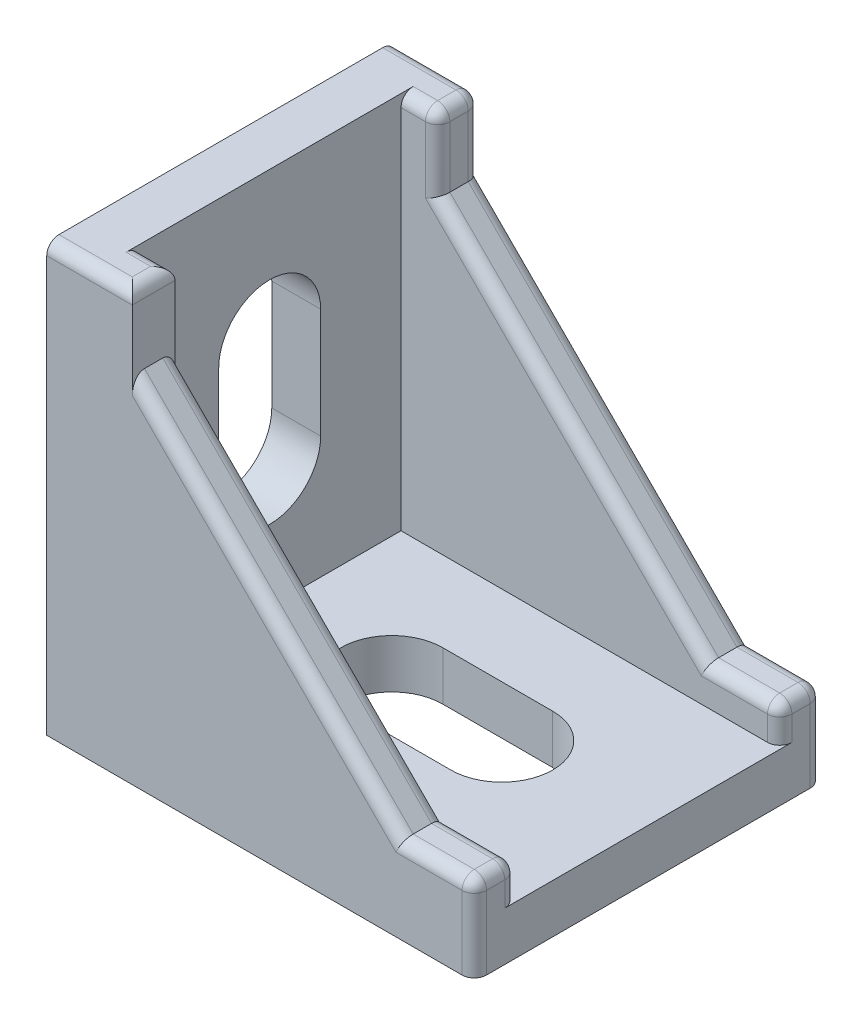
ISO-10303-21;
HEADER;
FILE_DESCRIPTION(('STEP AP214'),'2;1');
FILE_NAME('part.step','',(''),(''),'','','');
FILE_SCHEMA(('AUTOMOTIVE_DESIGN { 1 0 10303 214 1 1 1 1 }'));
ENDSEC;
DATA;
#1=APPLICATION_CONTEXT('core data for automotive mechanical design processes');
#2=APPLICATION_PROTOCOL_DEFINITION('international standard','automotive_design',2000,#1);
#3=PRODUCT_CONTEXT('',#1,'mechanical');
#4=PRODUCT('Part','Part','',(#3));
#5=PRODUCT_RELATED_PRODUCT_CATEGORY('part','',(#4));
#6=PRODUCT_DEFINITION_FORMATION('','',#4);
#7=PRODUCT_DEFINITION_CONTEXT('part definition',#1,'design');
#8=PRODUCT_DEFINITION('design','',#6,#7);
#9=PRODUCT_DEFINITION_SHAPE('','',#8);
#10=(LENGTH_UNIT() NAMED_UNIT(*) SI_UNIT(.MILLI.,.METRE.));
#11=(NAMED_UNIT(*) PLANE_ANGLE_UNIT() SI_UNIT($,.RADIAN.));
#12=(NAMED_UNIT(*) SI_UNIT($,.STERADIAN.) SOLID_ANGLE_UNIT());
#13=UNCERTAINTY_MEASURE_WITH_UNIT(LENGTH_MEASURE(1.E-05),#10,'distance_accuracy_value','');
#14=(GEOMETRIC_REPRESENTATION_CONTEXT(3) GLOBAL_UNCERTAINTY_ASSIGNED_CONTEXT((#13)) GLOBAL_UNIT_ASSIGNED_CONTEXT((#10,
#11,#12)) REPRESENTATION_CONTEXT('',''));
#15=CARTESIAN_POINT('',(0.,0.,0.));
#16=DIRECTION('',(0.,0.,1.));
#17=DIRECTION('',(1.,0.,0.));
#18=AXIS2_PLACEMENT_3D('',#15,#16,#17);
#19=CARTESIAN_POINT('',(-60.277774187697,-57.4837482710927,28.5));
#20=DIRECTION('',(0.,1.,0.));
#21=DIRECTION('',(0.,0.,1.));
#22=AXIS2_PLACEMENT_3D('',#19,#20,#21);
#23=PLANE('',#22);
#24=DIRECTION('',(0.,0.,1.));
#25=VECTOR('',#24,1.);
#26=CARTESIAN_POINT('',(-57.777774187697,-57.4837482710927,20.5));
#27=LINE('',#26,#25);
#28=CARTESIAN_POINT('',(-57.777774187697,-57.4837482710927,17.15));
#29=VERTEX_POINT('',#28);
#30=CARTESIAN_POINT('',(-57.777774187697,-57.4837482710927,20.5));
#31=VERTEX_POINT('',#30);
#32=EDGE_CURVE('E546',#29,#31,#27,.T.);
#33=ORIENTED_EDGE('',*,*,#32,.T.);
#34=DIRECTION('',(1.,0.,0.));
#35=VECTOR('',#34,1.);
#36=CARTESIAN_POINT('',(-52.777774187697,-57.4837482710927,20.5));
#37=LINE('',#36,#35);
#38=CARTESIAN_POINT('',(-52.777774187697,-57.4837482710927,20.5));
#39=VERTEX_POINT('',#38);
#40=EDGE_CURVE('E570',#31,#39,#37,.T.);
#41=ORIENTED_EDGE('',*,*,#40,.T.);
#42=DIRECTION('',(0.,0.,-1.));
#43=VECTOR('',#42,1.);
#44=CARTESIAN_POINT('',(-52.777774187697,-57.4837482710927,8.));
#45=LINE('',#44,#43);
#46=CARTESIAN_POINT('',(-52.777774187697,-57.4837482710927,8.));
#47=VERTEX_POINT('',#46);
#48=EDGE_CURVE('E567',#39,#47,#45,.T.);
#49=ORIENTED_EDGE('',*,*,#48,.T.);
#50=DIRECTION('',(-1.,0.,0.));
#51=VECTOR('',#50,1.);
#52=CARTESIAN_POINT('',(-57.777774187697,-57.4837482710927,8.));
#53=LINE('',#52,#51);
#54=CARTESIAN_POINT('',(-57.777774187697,-57.4837482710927,8.));
#55=VERTEX_POINT('',#54);
#56=EDGE_CURVE('E564',#47,#55,#53,.T.);
#57=ORIENTED_EDGE('',*,*,#56,.T.);
#58=DIRECTION('',(0.,0.,1.));
#59=VECTOR('',#58,1.);
#60=CARTESIAN_POINT('',(-57.777774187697,-57.4837482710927,11.35));
#61=LINE('',#60,#59);
#62=CARTESIAN_POINT('',(-57.777774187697,-57.4837482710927,11.35));
#63=VERTEX_POINT('',#62);
#64=EDGE_CURVE('E539',#55,#63,#61,.T.);
#65=ORIENTED_EDGE('',*,*,#64,.T.);
#66=DIRECTION('',(0.,0.,1.));
#67=VECTOR('',#66,1.);
#68=CARTESIAN_POINT('',(-57.777774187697,-57.4837482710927,17.15));
#69=LINE('',#68,#67);
#70=EDGE_CURVE('E626',#63,#29,#69,.T.);
#71=ORIENTED_EDGE('',*,*,#70,.T.);
#72=EDGE_LOOP('',(#33,#41,#49,#57,#65,#71));
#73=FACE_BOUND('',#72,.T.);
#74=DIRECTION('',(0.,0.,-1.));
#75=VECTOR('',#74,1.);
#76=CARTESIAN_POINT('',(-25.277774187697,-57.4837482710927,28.5));
#77=LINE('',#76,#75);
#78=CARTESIAN_POINT('',(-25.277774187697,-57.4837482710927,27.5));
#79=VERTEX_POINT('',#78);
#80=CARTESIAN_POINT('',(-25.277774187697,-57.4837482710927,1.00000000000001));
#81=VERTEX_POINT('',#80);
#82=EDGE_CURVE('E865',#79,#81,#77,.T.);
#83=ORIENTED_EDGE('',*,*,#82,.F.);
#84=CARTESIAN_POINT('',(-26.277774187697,-57.4837482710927,27.5));
#85=DIRECTION('',(0.,1.,0.));
#86=DIRECTION('',(0.,0.,1.));
#87=AXIS2_PLACEMENT_3D('',#84,#85,#86);
#88=CIRCLE('',#87,1.);
#89=CARTESIAN_POINT('',(-26.277774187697,-57.4837482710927,28.5));
#90=VERTEX_POINT('',#89);
#91=EDGE_CURVE('E937',#79,#90,#88,.F.);
#92=ORIENTED_EDGE('',*,*,#91,.T.);
#93=DIRECTION('',(1.,0.,0.));
#94=VECTOR('',#93,1.);
#95=CARTESIAN_POINT('',(-60.277774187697,-57.4837482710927,28.5));
#96=LINE('',#95,#94);
#97=CARTESIAN_POINT('',(-60.277774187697,-57.4837482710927,28.5));
#98=VERTEX_POINT('',#97);
#99=EDGE_CURVE('E848',#98,#90,#96,.T.);
#100=ORIENTED_EDGE('',*,*,#99,.F.);
#101=DIRECTION('',(0.,0.,-1.));
#102=VECTOR('',#101,1.);
#103=CARTESIAN_POINT('',(-60.277774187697,-57.4837482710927,28.5));
#104=LINE('',#103,#102);
#105=CARTESIAN_POINT('',(-60.277774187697,-57.4837482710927,0.));
#106=VERTEX_POINT('',#105);
#107=EDGE_CURVE('E868',#98,#106,#104,.T.);
#108=ORIENTED_EDGE('',*,*,#107,.T.);
#109=DIRECTION('',(1.,0.,0.));
#110=VECTOR('',#109,1.);
#111=CARTESIAN_POINT('',(-60.277774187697,-57.4837482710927,0.));
#112=LINE('',#111,#110);
#113=CARTESIAN_POINT('',(-26.277774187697,-57.4837482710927,0.));
#114=VERTEX_POINT('',#113);
#115=EDGE_CURVE('E849',#106,#114,#112,.T.);
#116=ORIENTED_EDGE('',*,*,#115,.T.);
#117=CARTESIAN_POINT('',(-26.277774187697,-57.4837482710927,1.));
#118=DIRECTION('',(0.,1.,0.));
#119=DIRECTION('',(0.,0.,1.));
#120=AXIS2_PLACEMENT_3D('',#117,#118,#119);
#121=CIRCLE('',#120,1.);
#122=EDGE_CURVE('E935',#114,#81,#121,.F.);
#123=ORIENTED_EDGE('',*,*,#122,.T.);
#124=EDGE_LOOP('',(#83,#92,#100,#108,#116,#123));
#125=FACE_BOUND('',#124,.T.);
#126=DIRECTION('',(0.,0.,-1.));
#127=VECTOR('',#126,1.);
#128=CARTESIAN_POINT('',(-27.277774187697,-57.4837482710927,11.35));
#129=LINE('',#128,#127);
#130=CARTESIAN_POINT('',(-27.277774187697,-57.4837482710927,11.35));
#131=VERTEX_POINT('',#130);
#132=CARTESIAN_POINT('',(-27.277774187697,-57.4837482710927,8.));
#133=VERTEX_POINT('',#132);
#134=EDGE_CURVE('E593',#131,#133,#129,.T.);
#135=ORIENTED_EDGE('',*,*,#134,.T.);
#136=DIRECTION('',(-1.,0.,0.));
#137=VECTOR('',#136,1.);
#138=CARTESIAN_POINT('',(-27.277774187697,-57.4837482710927,8.));
#139=LINE('',#138,#137);
#140=CARTESIAN_POINT('',(-32.277774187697,-57.4837482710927,8.));
#141=VERTEX_POINT('',#140);
#142=EDGE_CURVE('E618',#133,#141,#139,.T.);
#143=ORIENTED_EDGE('',*,*,#142,.T.);
#144=DIRECTION('',(0.,0.,1.));
#145=VECTOR('',#144,1.);
#146=CARTESIAN_POINT('',(-32.277774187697,-57.4837482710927,8.));
#147=LINE('',#146,#145);
#148=CARTESIAN_POINT('',(-32.277774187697,-57.4837482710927,20.5));
#149=VERTEX_POINT('',#148);
#150=EDGE_CURVE('E615',#141,#149,#147,.T.);
#151=ORIENTED_EDGE('',*,*,#150,.T.);
#152=DIRECTION('',(1.,0.,0.));
#153=VECTOR('',#152,1.);
#154=CARTESIAN_POINT('',(-32.277774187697,-57.4837482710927,20.5));
#155=LINE('',#154,#153);
#156=CARTESIAN_POINT('',(-27.277774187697,-57.4837482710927,20.5));
#157=VERTEX_POINT('',#156);
#158=EDGE_CURVE('E612',#149,#157,#155,.T.);
#159=ORIENTED_EDGE('',*,*,#158,.T.);
#160=DIRECTION('',(0.,0.,-1.));
#161=VECTOR('',#160,1.);
#162=CARTESIAN_POINT('',(-27.277774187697,-57.4837482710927,20.5));
#163=LINE('',#162,#161);
#164=CARTESIAN_POINT('',(-27.277774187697,-57.4837482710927,17.15));
#165=VERTEX_POINT('',#164);
#166=EDGE_CURVE('E578',#157,#165,#163,.T.);
#167=ORIENTED_EDGE('',*,*,#166,.T.);
#168=DIRECTION('',(0.,0.,-1.));
#169=VECTOR('',#168,1.);
#170=CARTESIAN_POINT('',(-27.277774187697,-57.4837482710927,11.35));
#171=LINE('',#170,#169);
#172=EDGE_CURVE('E647',#165,#131,#171,.T.);
#173=ORIENTED_EDGE('',*,*,#172,.T.);
#174=EDGE_LOOP('',(#135,#143,#151,#159,#167,#173));
#175=FACE_BOUND('',#174,.T.);
#176=CARTESIAN_POINT('',(-37.277774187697,-57.4837482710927,14.25));
#177=DIRECTION('',(0.,1.,0.));
#178=DIRECTION('',(-1.,0.,0.));
#179=AXIS2_PLACEMENT_3D('',#176,#177,#178);
#180=CIRCLE('',#179,4.17089919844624);
#181=CARTESIAN_POINT('',(-37.277774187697,-57.4837482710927,18.4208991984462));
#182=VERTEX_POINT('',#181);
#183=CARTESIAN_POINT('',(-37.277774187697,-57.4837482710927,10.0791008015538));
#184=VERTEX_POINT('',#183);
#185=EDGE_CURVE('E529',#182,#184,#180,.T.);
#186=ORIENTED_EDGE('',*,*,#185,.T.);
#187=DIRECTION('',(-1.,0.,0.));
#188=VECTOR('',#187,1.);
#189=CARTESIAN_POINT('',(-37.277774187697,-57.4837482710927,10.0791008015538));
#190=LINE('',#189,#188);
#191=CARTESIAN_POINT('',(-46.277774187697,-57.4837482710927,10.0791008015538));
#192=VERTEX_POINT('',#191);
#193=EDGE_CURVE('E532',#184,#192,#190,.T.);
#194=ORIENTED_EDGE('',*,*,#193,.T.);
#195=CARTESIAN_POINT('',(-46.277774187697,-57.4837482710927,14.25));
#196=DIRECTION('',(0.,1.,0.));
#197=DIRECTION('',(-1.,0.,0.));
#198=AXIS2_PLACEMENT_3D('',#195,#196,#197);
#199=CIRCLE('',#198,4.17089919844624);
#200=CARTESIAN_POINT('',(-46.277774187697,-57.4837482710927,18.4208991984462));
#201=VERTEX_POINT('',#200);
#202=EDGE_CURVE('E513',#192,#201,#199,.T.);
#203=ORIENTED_EDGE('',*,*,#202,.T.);
#204=DIRECTION('',(-1.,0.,0.));
#205=VECTOR('',#204,1.);
#206=CARTESIAN_POINT('',(-37.277774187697,-57.4837482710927,18.4208991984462));
#207=LINE('',#206,#205);
#208=EDGE_CURVE('E524',#182,#201,#207,.T.);
#209=ORIENTED_EDGE('',*,*,#208,.F.);
#210=EDGE_LOOP('',(#186,#194,#203,#209));
#211=FACE_BOUND('',#210,.T.);
#212=ADVANCED_FACE('F31',(#73,#125,#175,#211),#23,.F.);
#213=CARTESIAN_POINT('',(-56.277774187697,-53.4837482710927,28.5));
#214=DIRECTION('',(0.,-1.,0.));
#215=DIRECTION('',(0.,0.,-1.));
#216=AXIS2_PLACEMENT_3D('',#213,#214,#215);
#217=PLANE('',#216);
#218=DIRECTION('',(0.,0.,-1.));
#219=VECTOR('',#218,1.);
#220=CARTESIAN_POINT('',(-25.277774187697,-53.4837482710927,28.5));
#221=LINE('',#220,#219);
#222=CARTESIAN_POINT('',(-25.277774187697,-53.4837482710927,26.));
#223=VERTEX_POINT('',#222);
#224=CARTESIAN_POINT('',(-25.277774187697,-53.4837482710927,2.5));
#225=VERTEX_POINT('',#224);
#226=EDGE_CURVE('E863',#223,#225,#221,.T.);
#227=ORIENTED_EDGE('',*,*,#226,.T.);
#228=CARTESIAN_POINT('',(-26.277774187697,-53.4837482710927,2.5));
#229=DIRECTION('',(0.,-1.,0.));
#230=DIRECTION('',(0.,0.,-1.));
#231=AXIS2_PLACEMENT_3D('',#228,#229,#230);
#232=CIRCLE('',#231,1.);
#233=CARTESIAN_POINT('',(-26.277774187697,-53.4837482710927,3.5));
#234=VERTEX_POINT('',#233);
#235=EDGE_CURVE('E990',#225,#234,#232,.T.);
#236=ORIENTED_EDGE('',*,*,#235,.T.);
#237=DIRECTION('',(-1.,0.,0.));
#238=VECTOR('',#237,1.);
#239=CARTESIAN_POINT('',(-25.277774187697,-53.4837482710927,3.5));
#240=LINE('',#239,#238);
#241=CARTESIAN_POINT('',(-56.277774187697,-53.4837482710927,3.50000000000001));
#242=VERTEX_POINT('',#241);
#243=EDGE_CURVE('E820',#234,#242,#240,.T.);
#244=ORIENTED_EDGE('',*,*,#243,.T.);
#245=DIRECTION('',(0.,0.,-1.));
#246=VECTOR('',#245,1.);
#247=CARTESIAN_POINT('',(-56.277774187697,-53.4837482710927,28.5));
#248=LINE('',#247,#246);
#249=CARTESIAN_POINT('',(-56.277774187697,-53.4837482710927,25.));
#250=VERTEX_POINT('',#249);
#251=EDGE_CURVE('E860',#250,#242,#248,.T.);
#252=ORIENTED_EDGE('',*,*,#251,.F.);
#253=DIRECTION('',(1.,0.,0.));
#254=VECTOR('',#253,1.);
#255=CARTESIAN_POINT('',(-25.277774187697,-53.4837482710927,25.));
#256=LINE('',#255,#254);
#257=CARTESIAN_POINT('',(-26.277774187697,-53.4837482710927,25.));
#258=VERTEX_POINT('',#257);
#259=EDGE_CURVE('E831',#250,#258,#256,.T.);
#260=ORIENTED_EDGE('',*,*,#259,.T.);
#261=CARTESIAN_POINT('',(-26.277774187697,-53.4837482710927,26.));
#262=DIRECTION('',(0.,-1.,0.));
#263=DIRECTION('',(0.,0.,-1.));
#264=AXIS2_PLACEMENT_3D('',#261,#262,#263);
#265=CIRCLE('',#264,1.);
#266=EDGE_CURVE('E982',#258,#223,#265,.T.);
#267=ORIENTED_EDGE('',*,*,#266,.T.);
#268=EDGE_LOOP('',(#227,#236,#244,#252,#260,#267));
#269=FACE_BOUND('',#268,.T.);
#270=CARTESIAN_POINT('',(-37.277774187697,-53.4837482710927,14.25));
#271=DIRECTION('',(0.,-1.,0.));
#272=DIRECTION('',(0.,0.,-1.));
#273=AXIS2_PLACEMENT_3D('',#270,#271,#272);
#274=CIRCLE('',#273,4.17089919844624);
#275=CARTESIAN_POINT('',(-37.277774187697,-53.4837482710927,18.4208991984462));
#276=VERTEX_POINT('',#275);
#277=CARTESIAN_POINT('',(-37.277774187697,-53.4837482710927,10.0791008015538));
#278=VERTEX_POINT('',#277);
#279=EDGE_CURVE('E876',#276,#278,#274,.F.);
#280=ORIENTED_EDGE('',*,*,#279,.F.);
#281=DIRECTION('',(-1.,0.,0.));
#282=VECTOR('',#281,1.);
#283=CARTESIAN_POINT('',(-56.277774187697,-53.4837482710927,18.4208991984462));
#284=LINE('',#283,#282);
#285=CARTESIAN_POINT('',(-46.277774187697,-53.4837482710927,18.4208991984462));
#286=VERTEX_POINT('',#285);
#287=EDGE_CURVE('E871',#276,#286,#284,.T.);
#288=ORIENTED_EDGE('',*,*,#287,.T.);
#289=CARTESIAN_POINT('',(-46.277774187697,-53.4837482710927,14.25));
#290=DIRECTION('',(0.,-1.,0.));
#291=DIRECTION('',(0.,0.,-1.));
#292=AXIS2_PLACEMENT_3D('',#289,#290,#291);
#293=CIRCLE('',#292,4.17089919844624);
#294=CARTESIAN_POINT('',(-46.277774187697,-53.4837482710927,10.0791008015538));
#295=VERTEX_POINT('',#294);
#296=EDGE_CURVE('E516',#295,#286,#293,.F.);
#297=ORIENTED_EDGE('',*,*,#296,.F.);
#298=DIRECTION('',(-1.,0.,0.));
#299=VECTOR('',#298,1.);
#300=CARTESIAN_POINT('',(-56.277774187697,-53.4837482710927,10.0791008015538));
#301=LINE('',#300,#299);
#302=EDGE_CURVE('E874',#278,#295,#301,.T.);
#303=ORIENTED_EDGE('',*,*,#302,.F.);
#304=EDGE_LOOP('',(#280,#288,#297,#303));
#305=FACE_BOUND('',#304,.T.);
#306=ADVANCED_FACE('F1176',(#269,#305),#217,.F.);
#307=CARTESIAN_POINT('',(-60.277774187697,-22.4837482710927,28.5));
#308=DIRECTION('',(1.,0.,0.));
#309=DIRECTION('',(0.,1.,0.));
#310=AXIS2_PLACEMENT_3D('',#307,#308,#309);
#311=PLANE('',#310);
#312=DIRECTION('',(0.,0.,-1.));
#313=VECTOR('',#312,1.);
#314=CARTESIAN_POINT('',(-60.277774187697,-24.4837482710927,11.35));
#315=LINE('',#314,#313);
#316=CARTESIAN_POINT('',(-60.277774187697,-24.4837482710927,17.15));
#317=VERTEX_POINT('',#316);
#318=CARTESIAN_POINT('',(-60.277774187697,-24.4837482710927,11.35));
#319=VERTEX_POINT('',#318);
#320=EDGE_CURVE('E775',#317,#319,#315,.T.);
#321=ORIENTED_EDGE('',*,*,#320,.F.);
#322=DIRECTION('',(0.,0.,-1.));
#323=VECTOR('',#322,1.);
#324=CARTESIAN_POINT('',(-60.277774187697,-24.4837482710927,20.5));
#325=LINE('',#324,#323);
#326=CARTESIAN_POINT('',(-60.277774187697,-24.4837482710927,20.5));
#327=VERTEX_POINT('',#326);
#328=EDGE_CURVE('E716',#327,#317,#325,.T.);
#329=ORIENTED_EDGE('',*,*,#328,.F.);
#330=DIRECTION('',(0.,1.,0.));
#331=VECTOR('',#330,1.);
#332=CARTESIAN_POINT('',(-60.277774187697,-29.4837482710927,20.5));
#333=LINE('',#332,#331);
#334=CARTESIAN_POINT('',(-60.277774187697,-29.4837482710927,20.5));
#335=VERTEX_POINT('',#334);
#336=EDGE_CURVE('E746',#335,#327,#333,.T.);
#337=ORIENTED_EDGE('',*,*,#336,.F.);
#338=DIRECTION('',(0.,0.,1.));
#339=VECTOR('',#338,1.);
#340=CARTESIAN_POINT('',(-60.277774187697,-29.4837482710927,8.));
#341=LINE('',#340,#339);
#342=CARTESIAN_POINT('',(-60.277774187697,-29.4837482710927,8.));
#343=VERTEX_POINT('',#342);
#344=EDGE_CURVE('E743',#343,#335,#341,.T.);
#345=ORIENTED_EDGE('',*,*,#344,.F.);
#346=DIRECTION('',(0.,-1.,0.));
#347=VECTOR('',#346,1.);
#348=CARTESIAN_POINT('',(-60.277774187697,-24.4837482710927,8.));
#349=LINE('',#348,#347);
#350=CARTESIAN_POINT('',(-60.277774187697,-24.4837482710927,8.));
#351=VERTEX_POINT('',#350);
#352=EDGE_CURVE('E740',#351,#343,#349,.T.);
#353=ORIENTED_EDGE('',*,*,#352,.F.);
#354=DIRECTION('',(0.,0.,-1.));
#355=VECTOR('',#354,1.);
#356=CARTESIAN_POINT('',(-60.277774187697,-24.4837482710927,11.35));
#357=LINE('',#356,#355);
#358=EDGE_CURVE('E701',#319,#351,#357,.T.);
#359=ORIENTED_EDGE('',*,*,#358,.F.);
#360=EDGE_LOOP('',(#321,#329,#337,#345,#353,#359));
#361=FACE_BOUND('',#360,.T.);
#362=DIRECTION('',(0.,-1.,0.));
#363=VECTOR('',#362,1.);
#364=CARTESIAN_POINT('',(-60.277774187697,-34.4837482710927,10.0791008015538));
#365=LINE('',#364,#363);
#366=CARTESIAN_POINT('',(-60.277774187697,-34.4837482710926,10.0791008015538));
#367=VERTEX_POINT('',#366);
#368=CARTESIAN_POINT('',(-60.277774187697,-43.4837482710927,10.0791008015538));
#369=VERTEX_POINT('',#368);
#370=EDGE_CURVE('E788',#367,#369,#365,.T.);
#371=ORIENTED_EDGE('',*,*,#370,.F.);
#372=CARTESIAN_POINT('',(-60.277774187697,-34.4837482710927,14.25));
#373=DIRECTION('',(-1.,0.,0.));
#374=DIRECTION('',(0.,-1.,0.));
#375=AXIS2_PLACEMENT_3D('',#372,#373,#374);
#376=CIRCLE('',#375,4.17089919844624);
#377=CARTESIAN_POINT('',(-60.277774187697,-34.4837482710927,18.4208991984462));
#378=VERTEX_POINT('',#377);
#379=EDGE_CURVE('E786',#378,#367,#376,.T.);
#380=ORIENTED_EDGE('',*,*,#379,.F.);
#381=DIRECTION('',(0.,-1.,0.));
#382=VECTOR('',#381,1.);
#383=CARTESIAN_POINT('',(-60.277774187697,-34.4837482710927,18.4208991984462));
#384=LINE('',#383,#382);
#385=CARTESIAN_POINT('',(-60.277774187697,-43.4837482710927,18.4208991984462));
#386=VERTEX_POINT('',#385);
#387=EDGE_CURVE('E794',#378,#386,#384,.T.);
#388=ORIENTED_EDGE('',*,*,#387,.T.);
#389=CARTESIAN_POINT('',(-60.277774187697,-43.4837482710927,14.25));
#390=DIRECTION('',(-1.,0.,0.));
#391=DIRECTION('',(0.,-1.,0.));
#392=AXIS2_PLACEMENT_3D('',#389,#390,#391);
#393=CIRCLE('',#392,4.17089919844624);
#394=EDGE_CURVE('E791',#369,#386,#393,.T.);
#395=ORIENTED_EDGE('',*,*,#394,.F.);
#396=EDGE_LOOP('',(#371,#380,#388,#395));
#397=FACE_BOUND('',#396,.T.);
#398=DIRECTION('',(0.,-1.,0.));
#399=VECTOR('',#398,1.);
#400=CARTESIAN_POINT('',(-60.277774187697,-22.4837482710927,28.5));
#401=LINE('',#400,#399);
#402=CARTESIAN_POINT('',(-60.277774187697,-23.4837482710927,28.5));
#403=VERTEX_POINT('',#402);
#404=EDGE_CURVE('E846',#403,#98,#401,.T.);
#405=ORIENTED_EDGE('',*,*,#404,.F.);
#406=CARTESIAN_POINT('',(-60.277774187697,-23.4837482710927,27.5));
#407=DIRECTION('',(1.,0.,0.));
#408=DIRECTION('',(0.,1.,0.));
#409=AXIS2_PLACEMENT_3D('',#406,#407,#408);
#410=CIRCLE('',#409,1.);
#411=CARTESIAN_POINT('',(-60.277774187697,-22.4837482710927,27.5));
#412=VERTEX_POINT('',#411);
#413=EDGE_CURVE('E912',#403,#412,#410,.F.);
#414=ORIENTED_EDGE('',*,*,#413,.T.);
#415=DIRECTION('',(0.,0.,-1.));
#416=VECTOR('',#415,1.);
#417=CARTESIAN_POINT('',(-60.277774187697,-22.4837482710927,28.5));
#418=LINE('',#417,#416);
#419=CARTESIAN_POINT('',(-60.277774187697,-22.4837482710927,1.00000000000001));
#420=VERTEX_POINT('',#419);
#421=EDGE_CURVE('E852',#412,#420,#418,.T.);
#422=ORIENTED_EDGE('',*,*,#421,.T.);
#423=CARTESIAN_POINT('',(-60.277774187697,-23.4837482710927,1.));
#424=DIRECTION('',(1.,0.,0.));
#425=DIRECTION('',(0.,1.,0.));
#426=AXIS2_PLACEMENT_3D('',#423,#424,#425);
#427=CIRCLE('',#426,1.);
#428=CARTESIAN_POINT('',(-60.277774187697,-23.4837482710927,0.));
#429=VERTEX_POINT('',#428);
#430=EDGE_CURVE('E910',#420,#429,#427,.F.);
#431=ORIENTED_EDGE('',*,*,#430,.T.);
#432=DIRECTION('',(0.,-1.,0.));
#433=VECTOR('',#432,1.);
#434=CARTESIAN_POINT('',(-60.277774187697,-22.4837482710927,0.));
#435=LINE('',#434,#433);
#436=EDGE_CURVE('E843',#429,#106,#435,.T.);
#437=ORIENTED_EDGE('',*,*,#436,.T.);
#438=ORIENTED_EDGE('',*,*,#107,.F.);
#439=EDGE_LOOP('',(#405,#414,#422,#431,#437,#438));
#440=FACE_BOUND('',#439,.T.);
#441=DIRECTION('',(0.,0.,1.));
#442=VECTOR('',#441,1.);
#443=CARTESIAN_POINT('',(-60.277774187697,-54.9837482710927,17.15));
#444=LINE('',#443,#442);
#445=CARTESIAN_POINT('',(-60.277774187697,-54.9837482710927,11.35));
#446=VERTEX_POINT('',#445);
#447=CARTESIAN_POINT('',(-60.277774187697,-54.9837482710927,17.15));
#448=VERTEX_POINT('',#447);
#449=EDGE_CURVE('E754',#446,#448,#444,.T.);
#450=ORIENTED_EDGE('',*,*,#449,.F.);
#451=DIRECTION('',(0.,0.,1.));
#452=VECTOR('',#451,1.);
#453=CARTESIAN_POINT('',(-60.277774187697,-54.9837482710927,11.35));
#454=LINE('',#453,#452);
#455=CARTESIAN_POINT('',(-60.277774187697,-54.9837482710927,8.));
#456=VERTEX_POINT('',#455);
#457=EDGE_CURVE('E663',#456,#446,#454,.T.);
#458=ORIENTED_EDGE('',*,*,#457,.F.);
#459=DIRECTION('',(0.,-1.,0.));
#460=VECTOR('',#459,1.);
#461=CARTESIAN_POINT('',(-60.277774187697,-54.9837482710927,8.));
#462=LINE('',#461,#460);
#463=CARTESIAN_POINT('',(-60.277774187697,-49.9837482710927,8.));
#464=VERTEX_POINT('',#463);
#465=EDGE_CURVE('E693',#464,#456,#462,.T.);
#466=ORIENTED_EDGE('',*,*,#465,.F.);
#467=DIRECTION('',(0.,0.,-1.));
#468=VECTOR('',#467,1.);
#469=CARTESIAN_POINT('',(-60.277774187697,-49.9837482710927,8.));
#470=LINE('',#469,#468);
#471=CARTESIAN_POINT('',(-60.277774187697,-49.9837482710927,20.5));
#472=VERTEX_POINT('',#471);
#473=EDGE_CURVE('E690',#472,#464,#470,.T.);
#474=ORIENTED_EDGE('',*,*,#473,.F.);
#475=DIRECTION('',(0.,1.,0.));
#476=VECTOR('',#475,1.);
#477=CARTESIAN_POINT('',(-60.277774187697,-49.9837482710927,20.5));
#478=LINE('',#477,#476);
#479=CARTESIAN_POINT('',(-60.277774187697,-54.9837482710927,20.5));
#480=VERTEX_POINT('',#479);
#481=EDGE_CURVE('E687',#480,#472,#478,.T.);
#482=ORIENTED_EDGE('',*,*,#481,.F.);
#483=DIRECTION('',(0.,0.,1.));
#484=VECTOR('',#483,1.);
#485=CARTESIAN_POINT('',(-60.277774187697,-54.9837482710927,20.5));
#486=LINE('',#485,#484);
#487=EDGE_CURVE('E658',#448,#480,#486,.T.);
#488=ORIENTED_EDGE('',*,*,#487,.F.);
#489=EDGE_LOOP('',(#450,#458,#466,#474,#482,#488));
#490=FACE_BOUND('',#489,.T.);
#491=ADVANCED_FACE('F1149',(#361,#397,#440,#490),#311,.F.);
#492=CARTESIAN_POINT('',(-56.277774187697,-22.4837482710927,28.5));
#493=DIRECTION('',(-1.,0.,0.));
#494=DIRECTION('',(0.,-1.,0.));
#495=AXIS2_PLACEMENT_3D('',#492,#493,#494);
#496=PLANE('',#495);
#497=DIRECTION('',(0.,-1.,0.));
#498=VECTOR('',#497,1.);
#499=CARTESIAN_POINT('',(-56.277774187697,-22.4837482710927,18.4208991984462));
#500=LINE('',#499,#498);
#501=CARTESIAN_POINT('',(-56.277774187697,-34.4837482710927,18.4208991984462));
#502=VERTEX_POINT('',#501);
#503=CARTESIAN_POINT('',(-56.277774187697,-43.4837482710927,18.4208991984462));
#504=VERTEX_POINT('',#503);
#505=EDGE_CURVE('E812',#502,#504,#500,.T.);
#506=ORIENTED_EDGE('',*,*,#505,.F.);
#507=CARTESIAN_POINT('',(-56.277774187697,-34.4837482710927,14.25));
#508=DIRECTION('',(-1.,0.,0.));
#509=DIRECTION('',(0.,-1.,0.));
#510=AXIS2_PLACEMENT_3D('',#507,#508,#509);
#511=CIRCLE('',#510,4.17089919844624);
#512=CARTESIAN_POINT('',(-56.277774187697,-34.4837482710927,10.0791008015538));
#513=VERTEX_POINT('',#512);
#514=EDGE_CURVE('E814',#502,#513,#511,.T.);
#515=ORIENTED_EDGE('',*,*,#514,.T.);
#516=DIRECTION('',(0.,-1.,0.));
#517=VECTOR('',#516,1.);
#518=CARTESIAN_POINT('',(-56.277774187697,-22.4837482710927,10.0791008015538));
#519=LINE('',#518,#517);
#520=CARTESIAN_POINT('',(-56.277774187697,-43.4837482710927,10.0791008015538));
#521=VERTEX_POINT('',#520);
#522=EDGE_CURVE('E800',#513,#521,#519,.T.);
#523=ORIENTED_EDGE('',*,*,#522,.T.);
#524=CARTESIAN_POINT('',(-56.277774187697,-43.4837482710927,14.25));
#525=DIRECTION('',(-1.,0.,0.));
#526=DIRECTION('',(0.,-1.,0.));
#527=AXIS2_PLACEMENT_3D('',#524,#525,#526);
#528=CIRCLE('',#527,4.17089919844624);
#529=EDGE_CURVE('E809',#521,#504,#528,.T.);
#530=ORIENTED_EDGE('',*,*,#529,.T.);
#531=EDGE_LOOP('',(#506,#515,#523,#530));
#532=FACE_BOUND('',#531,.T.);
#533=DIRECTION('',(0.,1.,0.));
#534=VECTOR('',#533,1.);
#535=CARTESIAN_POINT('',(-56.277774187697,-53.4837482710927,3.5));
#536=LINE('',#535,#534);
#537=CARTESIAN_POINT('',(-56.277774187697,-23.4837482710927,3.5));
#538=VERTEX_POINT('',#537);
#539=EDGE_CURVE('E817',#242,#538,#536,.T.);
#540=ORIENTED_EDGE('',*,*,#539,.T.);
#541=CARTESIAN_POINT('',(-56.277774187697,-23.4837482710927,2.5));
#542=DIRECTION('',(-1.,0.,0.));
#543=DIRECTION('',(0.,-1.,0.));
#544=AXIS2_PLACEMENT_3D('',#541,#542,#543);
#545=CIRCLE('',#544,1.);
#546=CARTESIAN_POINT('',(-56.277774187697,-22.4837482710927,2.5));
#547=VERTEX_POINT('',#546);
#548=EDGE_CURVE('E992',#538,#547,#545,.T.);
#549=ORIENTED_EDGE('',*,*,#548,.T.);
#550=DIRECTION('',(0.,0.,-1.));
#551=VECTOR('',#550,1.);
#552=CARTESIAN_POINT('',(-56.277774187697,-22.4837482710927,28.5));
#553=LINE('',#552,#551);
#554=CARTESIAN_POINT('',(-56.277774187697,-22.4837482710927,26.));
#555=VERTEX_POINT('',#554);
#556=EDGE_CURVE('E858',#555,#547,#553,.T.);
#557=ORIENTED_EDGE('',*,*,#556,.F.);
#558=CARTESIAN_POINT('',(-56.277774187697,-23.4837482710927,26.));
#559=DIRECTION('',(-1.,0.,0.));
#560=DIRECTION('',(0.,-1.,0.));
#561=AXIS2_PLACEMENT_3D('',#558,#559,#560);
#562=CIRCLE('',#561,1.);
#563=CARTESIAN_POINT('',(-56.277774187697,-23.4837482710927,25.));
#564=VERTEX_POINT('',#563);
#565=EDGE_CURVE('E980',#555,#564,#562,.T.);
#566=ORIENTED_EDGE('',*,*,#565,.T.);
#567=DIRECTION('',(0.,-1.,0.));
#568=VECTOR('',#567,1.);
#569=CARTESIAN_POINT('',(-56.277774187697,-53.4837482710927,25.));
#570=LINE('',#569,#568);
#571=EDGE_CURVE('E829',#564,#250,#570,.T.);
#572=ORIENTED_EDGE('',*,*,#571,.T.);
#573=ORIENTED_EDGE('',*,*,#251,.T.);
#574=EDGE_LOOP('',(#540,#549,#557,#566,#572,#573));
#575=FACE_BOUND('',#574,.T.);
#576=ADVANCED_FACE('F1190',(#532,#575),#496,.F.);
#577=CARTESIAN_POINT('',(-25.277774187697,-53.4837482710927,28.5));
#578=DIRECTION('',(-1.,0.,0.));
#579=DIRECTION('',(0.,-1.,0.));
#580=AXIS2_PLACEMENT_3D('',#577,#578,#579);
#581=PLANE('',#580);
#582=ORIENTED_EDGE('',*,*,#226,.F.);
#583=DIRECTION('',(0.,1.,0.));
#584=VECTOR('',#583,1.);
#585=CARTESIAN_POINT('',(-25.277774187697,-50.4837482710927,26.));
#586=LINE('',#585,#584);
#587=CARTESIAN_POINT('',(-25.277774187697,-51.4837482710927,26.));
#588=VERTEX_POINT('',#587);
#589=EDGE_CURVE('E927',#223,#588,#586,.T.);
#590=ORIENTED_EDGE('',*,*,#589,.T.);
#591=DIRECTION('',(0.,0.,1.));
#592=VECTOR('',#591,1.);
#593=CARTESIAN_POINT('',(-25.277774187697,-51.4837482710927,28.5));
#594=LINE('',#593,#592);
#595=CARTESIAN_POINT('',(-25.277774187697,-51.4837482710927,27.5));
#596=VERTEX_POINT('',#595);
#597=EDGE_CURVE('E924',#588,#596,#594,.T.);
#598=ORIENTED_EDGE('',*,*,#597,.T.);
#599=DIRECTION('',(0.,1.,0.));
#600=VECTOR('',#599,1.);
#601=CARTESIAN_POINT('',(-25.277774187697,-57.4837482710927,27.5));
#602=LINE('',#601,#600);
#603=EDGE_CURVE('E922',#596,#79,#602,.F.);
#604=ORIENTED_EDGE('',*,*,#603,.T.);
#605=ORIENTED_EDGE('',*,*,#82,.T.);
#606=DIRECTION('',(0.,1.,0.));
#607=VECTOR('',#606,1.);
#608=CARTESIAN_POINT('',(-25.277774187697,-53.4837482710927,1.));
#609=LINE('',#608,#607);
#610=CARTESIAN_POINT('',(-25.277774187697,-51.4837482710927,1.));
#611=VERTEX_POINT('',#610);
#612=EDGE_CURVE('E919',#81,#611,#609,.T.);
#613=ORIENTED_EDGE('',*,*,#612,.T.);
#614=DIRECTION('',(0.,0.,-1.));
#615=VECTOR('',#614,1.);
#616=CARTESIAN_POINT('',(-25.277774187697,-51.4837482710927,3.5));
#617=LINE('',#616,#615);
#618=CARTESIAN_POINT('',(-25.277774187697,-51.4837482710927,2.5));
#619=VERTEX_POINT('',#618);
#620=EDGE_CURVE('E914',#611,#619,#617,.F.);
#621=ORIENTED_EDGE('',*,*,#620,.T.);
#622=DIRECTION('',(0.,-1.,0.));
#623=VECTOR('',#622,1.);
#624=CARTESIAN_POINT('',(-25.277774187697,-53.4837482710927,2.5));
#625=LINE('',#624,#623);
#626=EDGE_CURVE('E916',#619,#225,#625,.T.);
#627=ORIENTED_EDGE('',*,*,#626,.T.);
#628=EDGE_LOOP('',(#582,#590,#598,#604,#605,#613,#621,#627));
#629=FACE_BOUND('',#628,.T.);
#630=ADVANCED_FACE('F1187',(#629),#581,.F.);
#631=CARTESIAN_POINT('',(-60.277774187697,-22.4837482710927,28.5));
#632=DIRECTION('',(0.,-1.,0.));
#633=DIRECTION('',(0.,0.,-1.));
#634=AXIS2_PLACEMENT_3D('',#631,#632,#633);
#635=PLANE('',#634);
#636=DIRECTION('',(-1.,0.,0.));
#637=VECTOR('',#636,1.);
#638=CARTESIAN_POINT('',(-56.277774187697,-22.4837482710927,26.));
#639=LINE('',#638,#637);
#640=CARTESIAN_POINT('',(-54.277774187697,-22.4837482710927,26.));
#641=VERTEX_POINT('',#640);
#642=EDGE_CURVE('E888',#641,#555,#639,.T.);
#643=ORIENTED_EDGE('',*,*,#642,.T.);
#644=ORIENTED_EDGE('',*,*,#556,.T.);
#645=DIRECTION('',(1.,0.,0.));
#646=VECTOR('',#645,1.);
#647=CARTESIAN_POINT('',(-60.277774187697,-22.4837482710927,2.5));
#648=LINE('',#647,#646);
#649=CARTESIAN_POINT('',(-54.277774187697,-22.4837482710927,2.5));
#650=VERTEX_POINT('',#649);
#651=EDGE_CURVE('E880',#547,#650,#648,.T.);
#652=ORIENTED_EDGE('',*,*,#651,.T.);
#653=DIRECTION('',(0.,0.,-1.));
#654=VECTOR('',#653,1.);
#655=CARTESIAN_POINT('',(-54.277774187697,-22.4837482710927,0.));
#656=LINE('',#655,#654);
#657=CARTESIAN_POINT('',(-54.277774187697,-22.4837482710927,1.));
#658=VERTEX_POINT('',#657);
#659=EDGE_CURVE('E878',#650,#658,#656,.T.);
#660=ORIENTED_EDGE('',*,*,#659,.T.);
#661=DIRECTION('',(-1.,0.,0.));
#662=VECTOR('',#661,1.);
#663=CARTESIAN_POINT('',(-60.277774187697,-22.4837482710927,1.));
#664=LINE('',#663,#662);
#665=EDGE_CURVE('E882',#658,#420,#664,.T.);
#666=ORIENTED_EDGE('',*,*,#665,.T.);
#667=ORIENTED_EDGE('',*,*,#421,.F.);
#668=DIRECTION('',(-1.,0.,0.));
#669=VECTOR('',#668,1.);
#670=CARTESIAN_POINT('',(-53.277774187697,-22.4837482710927,27.5));
#671=LINE('',#670,#669);
#672=CARTESIAN_POINT('',(-54.277774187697,-22.4837482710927,27.5));
#673=VERTEX_POINT('',#672);
#674=EDGE_CURVE('E884',#412,#673,#671,.F.);
#675=ORIENTED_EDGE('',*,*,#674,.T.);
#676=DIRECTION('',(0.,0.,1.));
#677=VECTOR('',#676,1.);
#678=CARTESIAN_POINT('',(-54.277774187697,-22.4837482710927,25.));
#679=LINE('',#678,#677);
#680=EDGE_CURVE('E886',#673,#641,#679,.F.);
#681=ORIENTED_EDGE('',*,*,#680,.T.);
#682=EDGE_LOOP('',(#643,#644,#652,#660,#666,#667,#675,#681));
#683=FACE_BOUND('',#682,.T.);
#684=ADVANCED_FACE('F1914',(#683),#635,.F.);
#685=CARTESIAN_POINT('',(-60.277774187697,-57.4837482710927,28.5));
#686=DIRECTION('',(0.,0.,1.));
#687=DIRECTION('',(1.,0.,0.));
#688=AXIS2_PLACEMENT_3D('',#685,#686,#687);
#689=PLANE('',#688);
#690=DIRECTION('',(0.,1.,0.));
#691=VECTOR('',#690,1.);
#692=CARTESIAN_POINT('',(-53.277774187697,-22.4837482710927,28.5));
#693=LINE('',#692,#691);
#694=CARTESIAN_POINT('',(-53.277774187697,-29.8979618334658,28.5));
#695=VERTEX_POINT('',#694);
#696=CARTESIAN_POINT('',(-53.277774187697,-23.4837482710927,28.5));
#697=VERTEX_POINT('',#696);
#698=EDGE_CURVE('E826',#695,#697,#693,.T.);
#699=ORIENTED_EDGE('',*,*,#698,.T.);
#700=DIRECTION('',(-1.,0.,0.));
#701=VECTOR('',#700,1.);
#702=CARTESIAN_POINT('',(-60.277774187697,-23.4837482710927,28.5));
#703=LINE('',#702,#701);
#704=EDGE_CURVE('E908',#697,#403,#703,.T.);
#705=ORIENTED_EDGE('',*,*,#704,.T.);
#706=ORIENTED_EDGE('',*,*,#404,.T.);
#707=ORIENTED_EDGE('',*,*,#99,.T.);
#708=DIRECTION('',(0.,1.,0.));
#709=VECTOR('',#708,1.);
#710=CARTESIAN_POINT('',(-26.277774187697,-50.4837482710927,28.5));
#711=LINE('',#710,#709);
#712=CARTESIAN_POINT('',(-26.277774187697,-51.4837482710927,28.5));
#713=VERTEX_POINT('',#712);
#714=EDGE_CURVE('E906',#90,#713,#711,.T.);
#715=ORIENTED_EDGE('',*,*,#714,.T.);
#716=DIRECTION('',(-1.,0.,0.));
#717=VECTOR('',#716,1.);
#718=CARTESIAN_POINT('',(-60.277774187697,-51.4837482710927,28.5));
#719=LINE('',#718,#717);
#720=CARTESIAN_POINT('',(-31.6919877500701,-51.4837482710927,28.5));
#721=VERTEX_POINT('',#720);
#722=EDGE_CURVE('E901',#713,#721,#719,.T.);
#723=ORIENTED_EDGE('',*,*,#722,.T.);
#724=DIRECTION('',(-0.707106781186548,0.707106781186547,0.));
#725=VECTOR('',#724,1.);
#726=CARTESIAN_POINT('',(-42.9848809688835,-40.1908550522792,28.5));
#727=LINE('',#726,#725);
#728=EDGE_CURVE('E903',#721,#695,#727,.T.);
#729=ORIENTED_EDGE('',*,*,#728,.T.);
#730=EDGE_LOOP('',(#699,#705,#706,#707,#715,#723,#729));
#731=FACE_BOUND('',#730,.T.);
#732=ADVANCED_FACE('F1906',(#731),#689,.T.);
#733=CARTESIAN_POINT('',(-60.277774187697,-57.4837482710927,0.));
#734=DIRECTION('',(0.,0.,1.));
#735=DIRECTION('',(1.,0.,0.));
#736=AXIS2_PLACEMENT_3D('',#733,#734,#735);
#737=PLANE('',#736);
#738=DIRECTION('',(1.,0.,0.));
#739=VECTOR('',#738,1.);
#740=CARTESIAN_POINT('',(-25.277774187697,-51.4837482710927,0.));
#741=LINE('',#740,#739);
#742=CARTESIAN_POINT('',(-31.6919877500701,-51.4837482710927,0.));
#743=VERTEX_POINT('',#742);
#744=CARTESIAN_POINT('',(-26.277774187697,-51.4837482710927,0.));
#745=VERTEX_POINT('',#744);
#746=EDGE_CURVE('E949',#743,#745,#741,.T.);
#747=ORIENTED_EDGE('',*,*,#746,.T.);
#748=DIRECTION('',(0.,1.,0.));
#749=VECTOR('',#748,1.);
#750=CARTESIAN_POINT('',(-26.277774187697,-57.4837482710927,0.));
#751=LINE('',#750,#749);
#752=EDGE_CURVE('E951',#745,#114,#751,.F.);
#753=ORIENTED_EDGE('',*,*,#752,.T.);
#754=ORIENTED_EDGE('',*,*,#115,.F.);
#755=ORIENTED_EDGE('',*,*,#436,.F.);
#756=DIRECTION('',(-1.,0.,0.));
#757=VECTOR('',#756,1.);
#758=CARTESIAN_POINT('',(-60.277774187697,-23.4837482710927,0.));
#759=LINE('',#758,#757);
#760=CARTESIAN_POINT('',(-54.277774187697,-23.4837482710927,0.));
#761=VERTEX_POINT('',#760);
#762=EDGE_CURVE('E947',#429,#761,#759,.F.);
#763=ORIENTED_EDGE('',*,*,#762,.T.);
#764=DIRECTION('',(0.,-1.,0.));
#765=VECTOR('',#764,1.);
#766=CARTESIAN_POINT('',(-54.277774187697,-28.4837482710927,0.));
#767=LINE('',#766,#765);
#768=CARTESIAN_POINT('',(-54.277774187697,-28.8979618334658,0.));
#769=VERTEX_POINT('',#768);
#770=EDGE_CURVE('E945',#761,#769,#767,.T.);
#771=ORIENTED_EDGE('',*,*,#770,.T.);
#772=DIRECTION('',(0.707106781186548,-0.707106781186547,0.));
#773=VECTOR('',#772,1.);
#774=CARTESIAN_POINT('',(-31.9848809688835,-51.1908550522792,0.));
#775=LINE('',#774,#773);
#776=EDGE_CURVE('E943',#769,#743,#775,.T.);
#777=ORIENTED_EDGE('',*,*,#776,.T.);
#778=EDGE_LOOP('',(#747,#753,#754,#755,#763,#771,#777));
#779=FACE_BOUND('',#778,.T.);
#780=ADVANCED_FACE('F1898',(#779),#737,.F.);
#781=CARTESIAN_POINT('',(-53.277774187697,-22.4837482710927,25.));
#782=DIRECTION('',(1.,0.,0.));
#783=DIRECTION('',(0.,0.,-1.));
#784=AXIS2_PLACEMENT_3D('',#781,#782,#783);
#785=PLANE('',#784);
#786=DIRECTION('',(0.,1.,0.));
#787=VECTOR('',#786,1.);
#788=CARTESIAN_POINT('',(-53.277774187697,-22.4837482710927,25.));
#789=LINE('',#788,#787);
#790=CARTESIAN_POINT('',(-53.277774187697,-29.8979618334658,25.));
#791=VERTEX_POINT('',#790);
#792=CARTESIAN_POINT('',(-53.277774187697,-23.4837482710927,25.));
#793=VERTEX_POINT('',#792);
#794=EDGE_CURVE('E834',#791,#793,#789,.T.);
#795=ORIENTED_EDGE('',*,*,#794,.T.);
#796=DIRECTION('',(0.,0.,1.));
#797=VECTOR('',#796,1.);
#798=CARTESIAN_POINT('',(-53.277774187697,-23.4837482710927,28.5));
#799=LINE('',#798,#797);
#800=EDGE_CURVE('E899',#793,#697,#799,.T.);
#801=ORIENTED_EDGE('',*,*,#800,.T.);
#802=ORIENTED_EDGE('',*,*,#698,.F.);
#803=CARTESIAN_POINT('',(-53.277774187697,-29.8979618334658,27.5));
#804=DIRECTION('',(1.,0.,0.));
#805=DIRECTION('',(0.,1.,0.));
#806=AXIS2_PLACEMENT_3D('',#803,#804,#805);
#807=ELLIPSE('',#806,1.41421356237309,1.);
#808=CARTESIAN_POINT('',(-53.277774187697,-28.4837482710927,27.5));
#809=VERTEX_POINT('',#808);
#810=EDGE_CURVE('E985',#695,#809,#807,.F.);
#811=ORIENTED_EDGE('',*,*,#810,.T.);
#812=DIRECTION('',(0.,0.,1.));
#813=VECTOR('',#812,1.);
#814=CARTESIAN_POINT('',(-53.277774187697,-28.4837482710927,25.));
#815=LINE('',#814,#813);
#816=CARTESIAN_POINT('',(-53.277774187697,-28.4837482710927,26.));
#817=VERTEX_POINT('',#816);
#818=EDGE_CURVE('E840',#817,#809,#815,.T.);
#819=ORIENTED_EDGE('',*,*,#818,.F.);
#820=CARTESIAN_POINT('',(-53.277774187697,-29.8979618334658,26.));
#821=DIRECTION('',(1.,0.,0.));
#822=DIRECTION('',(0.,1.,0.));
#823=AXIS2_PLACEMENT_3D('',#820,#821,#822);
#824=ELLIPSE('',#823,1.41421356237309,1.);
#825=EDGE_CURVE('E987',#817,#791,#824,.F.);
#826=ORIENTED_EDGE('',*,*,#825,.T.);
#827=EDGE_LOOP('',(#795,#801,#802,#811,#819,#826));
#828=FACE_BOUND('',#827,.T.);
#829=ADVANCED_FACE('F1890',(#828),#785,.T.);
#830=CARTESIAN_POINT('',(-53.277774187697,-28.4837482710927,25.));
#831=DIRECTION('',(0.707106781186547,0.707106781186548,0.));
#832=DIRECTION('',(-0.707106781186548,0.707106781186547,0.));
#833=AXIS2_PLACEMENT_3D('',#830,#831,#832);
#834=PLANE('',#833);
#835=ORIENTED_EDGE('',*,*,#818,.T.);
#836=DIRECTION('',(-0.707106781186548,0.707106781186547,0.));
#837=VECTOR('',#836,1.);
#838=CARTESIAN_POINT('',(-53.277774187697,-28.4837482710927,27.5));
#839=LINE('',#838,#837);
#840=CARTESIAN_POINT('',(-31.277774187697,-50.4837482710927,27.5));
#841=VERTEX_POINT('',#840);
#842=EDGE_CURVE('E941',#809,#841,#839,.F.);
#843=ORIENTED_EDGE('',*,*,#842,.T.);
#844=DIRECTION('',(0.,0.,1.));
#845=VECTOR('',#844,1.);
#846=CARTESIAN_POINT('',(-31.277774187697,-50.4837482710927,25.));
#847=LINE('',#846,#845);
#848=CARTESIAN_POINT('',(-31.277774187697,-50.4837482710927,26.));
#849=VERTEX_POINT('',#848);
#850=EDGE_CURVE('E837',#849,#841,#847,.T.);
#851=ORIENTED_EDGE('',*,*,#850,.F.);
#852=DIRECTION('',(-0.707106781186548,0.707106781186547,0.));
#853=VECTOR('',#852,1.);
#854=CARTESIAN_POINT('',(-53.277774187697,-28.4837482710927,26.));
#855=LINE('',#854,#853);
#856=EDGE_CURVE('E939',#849,#817,#855,.T.);
#857=ORIENTED_EDGE('',*,*,#856,.T.);
#858=EDGE_LOOP('',(#835,#843,#851,#857));
#859=FACE_BOUND('',#858,.T.);
#860=ADVANCED_FACE('F1882',(#859),#834,.T.);
#861=CARTESIAN_POINT('',(-31.277774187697,-50.4837482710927,25.));
#862=DIRECTION('',(0.,1.,0.));
#863=DIRECTION('',(0.,0.,1.));
#864=AXIS2_PLACEMENT_3D('',#861,#862,#863);
#865=PLANE('',#864);
#866=DIRECTION('',(0.,0.,1.));
#867=VECTOR('',#866,1.);
#868=CARTESIAN_POINT('',(-26.277774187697,-50.4837482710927,25.));
#869=LINE('',#868,#867);
#870=CARTESIAN_POINT('',(-26.277774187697,-50.4837482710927,27.5));
#871=VERTEX_POINT('',#870);
#872=CARTESIAN_POINT('',(-26.277774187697,-50.4837482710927,26.));
#873=VERTEX_POINT('',#872);
#874=EDGE_CURVE('E931',#871,#873,#869,.F.);
#875=ORIENTED_EDGE('',*,*,#874,.T.);
#876=DIRECTION('',(-1.,0.,0.));
#877=VECTOR('',#876,1.);
#878=CARTESIAN_POINT('',(-31.277774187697,-50.4837482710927,26.));
#879=LINE('',#878,#877);
#880=EDGE_CURVE('E933',#873,#849,#879,.T.);
#881=ORIENTED_EDGE('',*,*,#880,.T.);
#882=ORIENTED_EDGE('',*,*,#850,.T.);
#883=DIRECTION('',(-1.,0.,0.));
#884=VECTOR('',#883,1.);
#885=CARTESIAN_POINT('',(-31.277774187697,-50.4837482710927,27.5));
#886=LINE('',#885,#884);
#887=EDGE_CURVE('E929',#841,#871,#886,.F.);
#888=ORIENTED_EDGE('',*,*,#887,.T.);
#889=EDGE_LOOP('',(#875,#881,#882,#888));
#890=FACE_BOUND('',#889,.T.);
#891=ADVANCED_FACE('F1874',(#890),#865,.T.);
#892=CARTESIAN_POINT('',(-56.277774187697,-22.4837482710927,25.));
#893=DIRECTION('',(0.,0.,-1.));
#894=DIRECTION('',(-1.,0.,0.));
#895=AXIS2_PLACEMENT_3D('',#892,#893,#894);
#896=PLANE('',#895);
#897=ORIENTED_EDGE('',*,*,#571,.F.);
#898=DIRECTION('',(-1.,0.,0.));
#899=VECTOR('',#898,1.);
#900=CARTESIAN_POINT('',(-53.277774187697,-23.4837482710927,25.));
#901=LINE('',#900,#899);
#902=EDGE_CURVE('E897',#564,#793,#901,.F.);
#903=ORIENTED_EDGE('',*,*,#902,.T.);
#904=ORIENTED_EDGE('',*,*,#794,.F.);
#905=DIRECTION('',(-0.707106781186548,0.707106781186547,0.));
#906=VECTOR('',#905,1.);
#907=CARTESIAN_POINT('',(-58.4848809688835,-24.6908550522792,25.));
#908=LINE('',#907,#906);
#909=CARTESIAN_POINT('',(-31.6919877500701,-51.4837482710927,25.));
#910=VERTEX_POINT('',#909);
#911=EDGE_CURVE('E893',#791,#910,#908,.F.);
#912=ORIENTED_EDGE('',*,*,#911,.T.);
#913=DIRECTION('',(-1.,0.,0.));
#914=VECTOR('',#913,1.);
#915=CARTESIAN_POINT('',(-56.277774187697,-51.4837482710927,25.));
#916=LINE('',#915,#914);
#917=CARTESIAN_POINT('',(-26.277774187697,-51.4837482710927,25.));
#918=VERTEX_POINT('',#917);
#919=EDGE_CURVE('E891',#910,#918,#916,.F.);
#920=ORIENTED_EDGE('',*,*,#919,.T.);
#921=DIRECTION('',(0.,1.,0.));
#922=VECTOR('',#921,1.);
#923=CARTESIAN_POINT('',(-26.277774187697,-53.4837482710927,25.));
#924=LINE('',#923,#922);
#925=EDGE_CURVE('E895',#918,#258,#924,.F.);
#926=ORIENTED_EDGE('',*,*,#925,.T.);
#927=ORIENTED_EDGE('',*,*,#259,.F.);
#928=EDGE_LOOP('',(#897,#903,#904,#912,#920,#926,#927));
#929=FACE_BOUND('',#928,.T.);
#930=ADVANCED_FACE('F1866',(#929),#896,.T.);
#931=CARTESIAN_POINT('',(-31.277774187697,-50.4837482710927,3.5));
#932=DIRECTION('',(0.,1.,0.));
#933=DIRECTION('',(-1.,0.,0.));
#934=AXIS2_PLACEMENT_3D('',#931,#932,#933);
#935=PLANE('',#934);
#936=DIRECTION('',(0.,0.,-1.));
#937=VECTOR('',#936,1.);
#938=CARTESIAN_POINT('',(-31.277774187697,-50.4837482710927,3.5));
#939=LINE('',#938,#937);
#940=CARTESIAN_POINT('',(-31.277774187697,-50.4837482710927,2.5));
#941=VERTEX_POINT('',#940);
#942=CARTESIAN_POINT('',(-31.277774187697,-50.4837482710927,1.));
#943=VERTEX_POINT('',#942);
#944=EDGE_CURVE('E823',#941,#943,#939,.T.);
#945=ORIENTED_EDGE('',*,*,#944,.F.);
#946=DIRECTION('',(1.,0.,0.));
#947=VECTOR('',#946,1.);
#948=CARTESIAN_POINT('',(-25.277774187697,-50.4837482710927,2.5));
#949=LINE('',#948,#947);
#950=CARTESIAN_POINT('',(-26.277774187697,-50.4837482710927,2.5));
#951=VERTEX_POINT('',#950);
#952=EDGE_CURVE('E968',#941,#951,#949,.T.);
#953=ORIENTED_EDGE('',*,*,#952,.T.);
#954=DIRECTION('',(0.,0.,-1.));
#955=VECTOR('',#954,1.);
#956=CARTESIAN_POINT('',(-26.277774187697,-50.4837482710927,0.));
#957=LINE('',#956,#955);
#958=CARTESIAN_POINT('',(-26.277774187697,-50.4837482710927,1.));
#959=VERTEX_POINT('',#958);
#960=EDGE_CURVE('E965',#951,#959,#957,.T.);
#961=ORIENTED_EDGE('',*,*,#960,.T.);
#962=DIRECTION('',(1.,0.,0.));
#963=VECTOR('',#962,1.);
#964=CARTESIAN_POINT('',(-31.277774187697,-50.4837482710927,1.));
#965=LINE('',#964,#963);
#966=EDGE_CURVE('E963',#959,#943,#965,.F.);
#967=ORIENTED_EDGE('',*,*,#966,.T.);
#968=EDGE_LOOP('',(#945,#953,#961,#967));
#969=FACE_BOUND('',#968,.T.);
#970=ADVANCED_FACE('F1858',(#969),#935,.T.);
#971=CARTESIAN_POINT('',(-53.277774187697,-28.4837482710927,3.5));
#972=DIRECTION('',(0.707106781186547,0.707106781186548,0.));
#973=DIRECTION('',(-0.707106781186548,0.707106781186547,0.));
#974=AXIS2_PLACEMENT_3D('',#971,#972,#973);
#975=PLANE('',#974);
#976=ORIENTED_EDGE('',*,*,#944,.T.);
#977=DIRECTION('',(0.707106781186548,-0.707106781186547,0.));
#978=VECTOR('',#977,1.);
#979=CARTESIAN_POINT('',(-53.277774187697,-28.4837482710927,1.));
#980=LINE('',#979,#978);
#981=CARTESIAN_POINT('',(-53.277774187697,-28.4837482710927,1.));
#982=VERTEX_POINT('',#981);
#983=EDGE_CURVE('E978',#943,#982,#980,.F.);
#984=ORIENTED_EDGE('',*,*,#983,.T.);
#985=DIRECTION('',(0.,0.,-1.));
#986=VECTOR('',#985,1.);
#987=CARTESIAN_POINT('',(-53.277774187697,-28.4837482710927,3.5));
#988=LINE('',#987,#986);
#989=CARTESIAN_POINT('',(-53.277774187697,-28.4837482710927,2.5));
#990=VERTEX_POINT('',#989);
#991=EDGE_CURVE('E822',#990,#982,#988,.T.);
#992=ORIENTED_EDGE('',*,*,#991,.F.);
#993=DIRECTION('',(0.707106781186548,-0.707106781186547,0.));
#994=VECTOR('',#993,1.);
#995=CARTESIAN_POINT('',(-31.277774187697,-50.4837482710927,2.5));
#996=LINE('',#995,#994);
#997=EDGE_CURVE('E976',#990,#941,#996,.T.);
#998=ORIENTED_EDGE('',*,*,#997,.T.);
#999=EDGE_LOOP('',(#976,#984,#992,#998));
#1000=FACE_BOUND('',#999,.T.);
#1001=ADVANCED_FACE('F1850',(#1000),#975,.T.);
#1002=CARTESIAN_POINT('',(-53.277774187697,-22.4837482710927,3.5));
#1003=DIRECTION('',(1.,0.,0.));
#1004=DIRECTION('',(0.,0.,-1.));
#1005=AXIS2_PLACEMENT_3D('',#1002,#1003,#1004);
#1006=PLANE('',#1005);
#1007=DIRECTION('',(0.,0.,-1.));
#1008=VECTOR('',#1007,1.);
#1009=CARTESIAN_POINT('',(-53.277774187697,-23.4837482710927,3.5));
#1010=LINE('',#1009,#1008);
#1011=CARTESIAN_POINT('',(-53.277774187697,-23.4837482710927,1.));
#1012=VERTEX_POINT('',#1011);
#1013=CARTESIAN_POINT('',(-53.277774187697,-23.4837482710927,2.5));
#1014=VERTEX_POINT('',#1013);
#1015=EDGE_CURVE('E972',#1012,#1014,#1010,.F.);
#1016=ORIENTED_EDGE('',*,*,#1015,.T.);
#1017=DIRECTION('',(0.,-1.,0.));
#1018=VECTOR('',#1017,1.);
#1019=CARTESIAN_POINT('',(-53.277774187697,-28.4837482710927,2.5));
#1020=LINE('',#1019,#1018);
#1021=EDGE_CURVE('E974',#1014,#990,#1020,.T.);
#1022=ORIENTED_EDGE('',*,*,#1021,.T.);
#1023=ORIENTED_EDGE('',*,*,#991,.T.);
#1024=DIRECTION('',(0.,-1.,0.));
#1025=VECTOR('',#1024,1.);
#1026=CARTESIAN_POINT('',(-53.277774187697,-22.4837482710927,1.));
#1027=LINE('',#1026,#1025);
#1028=EDGE_CURVE('E970',#982,#1012,#1027,.F.);
#1029=ORIENTED_EDGE('',*,*,#1028,.T.);
#1030=EDGE_LOOP('',(#1016,#1022,#1023,#1029));
#1031=FACE_BOUND('',#1030,.T.);
#1032=ADVANCED_FACE('F1842',(#1031),#1006,.T.);
#1033=CARTESIAN_POINT('',(-56.277774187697,-22.4837482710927,3.5));
#1034=DIRECTION('',(0.,0.,-1.));
#1035=DIRECTION('',(-1.,0.,0.));
#1036=AXIS2_PLACEMENT_3D('',#1033,#1034,#1035);
#1037=PLANE('',#1036);
#1038=ORIENTED_EDGE('',*,*,#243,.F.);
#1039=DIRECTION('',(0.,-1.,0.));
#1040=VECTOR('',#1039,1.);
#1041=CARTESIAN_POINT('',(-26.277774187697,-22.4837482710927,3.5));
#1042=LINE('',#1041,#1040);
#1043=CARTESIAN_POINT('',(-26.277774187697,-51.4837482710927,3.5));
#1044=VERTEX_POINT('',#1043);
#1045=EDGE_CURVE('E961',#234,#1044,#1042,.F.);
#1046=ORIENTED_EDGE('',*,*,#1045,.T.);
#1047=DIRECTION('',(1.,0.,0.));
#1048=VECTOR('',#1047,1.);
#1049=CARTESIAN_POINT('',(-31.277774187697,-51.4837482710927,3.5));
#1050=LINE('',#1049,#1048);
#1051=CARTESIAN_POINT('',(-31.6919877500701,-51.4837482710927,3.5));
#1052=VERTEX_POINT('',#1051);
#1053=EDGE_CURVE('E959',#1044,#1052,#1050,.F.);
#1054=ORIENTED_EDGE('',*,*,#1053,.T.);
#1055=DIRECTION('',(0.707106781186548,-0.707106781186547,0.));
#1056=VECTOR('',#1055,1.);
#1057=CARTESIAN_POINT('',(-53.9848809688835,-29.1908550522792,3.5));
#1058=LINE('',#1057,#1056);
#1059=CARTESIAN_POINT('',(-54.277774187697,-28.8979618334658,3.5));
#1060=VERTEX_POINT('',#1059);
#1061=EDGE_CURVE('E953',#1052,#1060,#1058,.F.);
#1062=ORIENTED_EDGE('',*,*,#1061,.T.);
#1063=DIRECTION('',(0.,-1.,0.));
#1064=VECTOR('',#1063,1.);
#1065=CARTESIAN_POINT('',(-54.277774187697,-22.4837482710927,3.5));
#1066=LINE('',#1065,#1064);
#1067=CARTESIAN_POINT('',(-54.277774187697,-23.4837482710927,3.5));
#1068=VERTEX_POINT('',#1067);
#1069=EDGE_CURVE('E955',#1060,#1068,#1066,.F.);
#1070=ORIENTED_EDGE('',*,*,#1069,.T.);
#1071=DIRECTION('',(1.,0.,0.));
#1072=VECTOR('',#1071,1.);
#1073=CARTESIAN_POINT('',(-56.277774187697,-23.4837482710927,3.5));
#1074=LINE('',#1073,#1072);
#1075=EDGE_CURVE('E957',#1068,#538,#1074,.F.);
#1076=ORIENTED_EDGE('',*,*,#1075,.T.);
#1077=ORIENTED_EDGE('',*,*,#539,.F.);
#1078=EDGE_LOOP('',(#1038,#1046,#1054,#1062,#1070,#1076,#1077));
#1079=FACE_BOUND('',#1078,.T.);
#1080=ADVANCED_FACE('F1835',(#1079),#1037,.F.);
#1081=CARTESIAN_POINT('',(-25.277774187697,-34.4837482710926,14.25));
#1082=DIRECTION('',(-1.,0.,0.));
#1083=DIRECTION('',(0.,-1.,0.));
#1084=AXIS2_PLACEMENT_3D('',#1081,#1082,#1083);
#1085=CYLINDRICAL_SURFACE('',#1084,4.17089919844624);
#1086=DIRECTION('',(-1.,0.,0.));
#1087=VECTOR('',#1086,1.);
#1088=CARTESIAN_POINT('',(-25.277774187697,-34.4837482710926,18.4208991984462));
#1089=LINE('',#1088,#1087);
#1090=EDGE_CURVE('E798',#502,#378,#1089,.T.);
#1091=ORIENTED_EDGE('',*,*,#1090,.T.);
#1092=ORIENTED_EDGE('',*,*,#379,.T.);
#1093=DIRECTION('',(-1.,0.,0.));
#1094=VECTOR('',#1093,1.);
#1095=CARTESIAN_POINT('',(-25.277774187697,-34.4837482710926,10.0791008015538));
#1096=LINE('',#1095,#1094);
#1097=EDGE_CURVE('E797',#513,#367,#1096,.T.);
#1098=ORIENTED_EDGE('',*,*,#1097,.F.);
#1099=ORIENTED_EDGE('',*,*,#514,.F.);
#1100=EDGE_LOOP('',(#1091,#1092,#1098,#1099));
#1101=FACE_BOUND('',#1100,.T.);
#1102=ADVANCED_FACE('F1827',(#1101),#1085,.F.);
#1103=CARTESIAN_POINT('',(-25.277774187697,-34.4837482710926,18.4208991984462));
#1104=DIRECTION('',(0.,0.,-1.));
#1105=DIRECTION('',(-1.,0.,0.));
#1106=AXIS2_PLACEMENT_3D('',#1103,#1104,#1105);
#1107=PLANE('',#1106);
#1108=ORIENTED_EDGE('',*,*,#505,.T.);
#1109=DIRECTION('',(-1.,0.,0.));
#1110=VECTOR('',#1109,1.);
#1111=CARTESIAN_POINT('',(-25.277774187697,-43.4837482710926,18.4208991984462));
#1112=LINE('',#1111,#1110);
#1113=EDGE_CURVE('E801',#504,#386,#1112,.T.);
#1114=ORIENTED_EDGE('',*,*,#1113,.T.);
#1115=ORIENTED_EDGE('',*,*,#387,.F.);
#1116=ORIENTED_EDGE('',*,*,#1090,.F.);
#1117=EDGE_LOOP('',(#1108,#1114,#1115,#1116));
#1118=FACE_BOUND('',#1117,.T.);
#1119=ADVANCED_FACE('F1819',(#1118),#1107,.T.);
#1120=CARTESIAN_POINT('',(-25.277774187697,-43.4837482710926,14.25));
#1121=DIRECTION('',(-1.,0.,0.));
#1122=DIRECTION('',(0.,-1.,0.));
#1123=AXIS2_PLACEMENT_3D('',#1120,#1121,#1122);
#1124=CYLINDRICAL_SURFACE('',#1123,4.17089919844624);
#1125=DIRECTION('',(-1.,0.,0.));
#1126=VECTOR('',#1125,1.);
#1127=CARTESIAN_POINT('',(-25.277774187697,-43.4837482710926,10.0791008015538));
#1128=LINE('',#1127,#1126);
#1129=EDGE_CURVE('E803',#521,#369,#1128,.T.);
#1130=ORIENTED_EDGE('',*,*,#1129,.T.);
#1131=ORIENTED_EDGE('',*,*,#394,.T.);
#1132=ORIENTED_EDGE('',*,*,#1113,.F.);
#1133=ORIENTED_EDGE('',*,*,#529,.F.);
#1134=EDGE_LOOP('',(#1130,#1131,#1132,#1133));
#1135=FACE_BOUND('',#1134,.T.);
#1136=ADVANCED_FACE('F1811',(#1135),#1124,.F.);
#1137=CARTESIAN_POINT('',(-25.277774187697,-34.4837482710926,10.0791008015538));
#1138=DIRECTION('',(0.,0.,-1.));
#1139=DIRECTION('',(0.,1.,0.));
#1140=AXIS2_PLACEMENT_3D('',#1137,#1138,#1139);
#1141=PLANE('',#1140);
#1142=ORIENTED_EDGE('',*,*,#1097,.T.);
#1143=ORIENTED_EDGE('',*,*,#370,.T.);
#1144=ORIENTED_EDGE('',*,*,#1129,.F.);
#1145=ORIENTED_EDGE('',*,*,#522,.F.);
#1146=EDGE_LOOP('',(#1142,#1143,#1144,#1145));
#1147=FACE_BOUND('',#1146,.T.);
#1148=ADVANCED_FACE('F1173',(#1147),#1141,.F.);
#1149=CARTESIAN_POINT('',(-62.277774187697,-26.4837482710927,11.35));
#1150=DIRECTION('',(0.,0.,1.));
#1151=DIRECTION('',(1.,0.,0.));
#1152=AXIS2_PLACEMENT_3D('',#1149,#1150,#1151);
#1153=PLANE('',#1152);
#1154=DIRECTION('',(1.,0.,0.));
#1155=VECTOR('',#1154,1.);
#1156=CARTESIAN_POINT('',(-62.277774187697,-26.4837482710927,11.35));
#1157=LINE('',#1156,#1155);
#1158=CARTESIAN_POINT('',(-61.277774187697,-26.4837482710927,11.35));
#1159=VERTEX_POINT('',#1158);
#1160=CARTESIAN_POINT('',(-58.277774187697,-26.4837482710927,11.35));
#1161=VERTEX_POINT('',#1160);
#1162=EDGE_CURVE('E784',#1159,#1161,#1157,.T.);
#1163=ORIENTED_EDGE('',*,*,#1162,.F.);
#1164=CARTESIAN_POINT('',(-61.277774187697,-25.4837482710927,11.35));
#1165=DIRECTION('',(0.,0.,1.));
#1166=DIRECTION('',(1.,0.,0.));
#1167=AXIS2_PLACEMENT_3D('',#1164,#1165,#1166);
#1168=CIRCLE('',#1167,1.);
#1169=CARTESIAN_POINT('',(-62.277774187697,-25.4837482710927,11.35));
#1170=VERTEX_POINT('',#1169);
#1171=EDGE_CURVE('E40',#1159,#1170,#1168,.F.);
#1172=ORIENTED_EDGE('',*,*,#1171,.T.);
#1173=CARTESIAN_POINT('',(-61.277774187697,-25.4837482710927,11.35));
#1174=DIRECTION('',(0.,0.,1.));
#1175=DIRECTION('',(1.,0.,0.));
#1176=AXIS2_PLACEMENT_3D('',#1173,#1174,#1175);
#1177=CIRCLE('',#1176,1.);
#1178=CARTESIAN_POINT('',(-61.277774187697,-24.4837482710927,11.35));
#1179=VERTEX_POINT('',#1178);
#1180=EDGE_CURVE('E51',#1170,#1179,#1177,.F.);
#1181=ORIENTED_EDGE('',*,*,#1180,.T.);
#1182=DIRECTION('',(1.,0.,0.));
#1183=VECTOR('',#1182,1.);
#1184=CARTESIAN_POINT('',(-62.277774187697,-24.4837482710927,11.35));
#1185=LINE('',#1184,#1183);
#1186=EDGE_CURVE('E778',#1179,#319,#1185,.T.);
#1187=ORIENTED_EDGE('',*,*,#1186,.T.);
#1188=DIRECTION('',(-1.,0.,0.));
#1189=VECTOR('',#1188,1.);
#1190=CARTESIAN_POINT('',(-58.277774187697,-24.4837482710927,11.35));
#1191=LINE('',#1190,#1189);
#1192=CARTESIAN_POINT('',(-58.277774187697,-24.4837482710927,11.35));
#1193=VERTEX_POINT('',#1192);
#1194=EDGE_CURVE('E737',#1193,#319,#1191,.T.);
#1195=ORIENTED_EDGE('',*,*,#1194,.F.);
#1196=DIRECTION('',(0.,1.,0.));
#1197=VECTOR('',#1196,1.);
#1198=CARTESIAN_POINT('',(-58.277774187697,-26.4837482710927,11.35));
#1199=LINE('',#1198,#1197);
#1200=EDGE_CURVE('E712',#1161,#1193,#1199,.T.);
#1201=ORIENTED_EDGE('',*,*,#1200,.F.);
#1202=EDGE_LOOP('',(#1163,#1172,#1181,#1187,#1195,#1201));
#1203=FACE_BOUND('',#1202,.T.);
#1204=ADVANCED_FACE('F1159',(#1203),#1153,.F.);
#1205=CARTESIAN_POINT('',(-62.277774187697,-26.4837482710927,17.15));
#1206=DIRECTION('',(0.,1.,0.));
#1207=DIRECTION('',(-1.,0.,0.));
#1208=AXIS2_PLACEMENT_3D('',#1205,#1206,#1207);
#1209=PLANE('',#1208);
#1210=DIRECTION('',(1.,0.,0.));
#1211=VECTOR('',#1210,1.);
#1212=CARTESIAN_POINT('',(-62.277774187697,-26.4837482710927,17.15));
#1213=LINE('',#1212,#1211);
#1214=CARTESIAN_POINT('',(-61.277774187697,-26.4837482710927,17.15));
#1215=VERTEX_POINT('',#1214);
#1216=CARTESIAN_POINT('',(-58.277774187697,-26.4837482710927,17.15));
#1217=VERTEX_POINT('',#1216);
#1218=EDGE_CURVE('E782',#1215,#1217,#1213,.T.);
#1219=ORIENTED_EDGE('',*,*,#1218,.F.);
#1220=DIRECTION('',(0.,0.,1.));
#1221=VECTOR('',#1220,1.);
#1222=CARTESIAN_POINT('',(-61.277774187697,-26.4837482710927,17.15));
#1223=LINE('',#1222,#1221);
#1224=EDGE_CURVE('E1114',#1215,#1159,#1223,.F.);
#1225=ORIENTED_EDGE('',*,*,#1224,.T.);
#1226=ORIENTED_EDGE('',*,*,#1162,.T.);
#1227=DIRECTION('',(0.,0.,-1.));
#1228=VECTOR('',#1227,1.);
#1229=CARTESIAN_POINT('',(-58.277774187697,-26.4837482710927,17.15));
#1230=LINE('',#1229,#1228);
#1231=EDGE_CURVE('E734',#1217,#1161,#1230,.T.);
#1232=ORIENTED_EDGE('',*,*,#1231,.F.);
#1233=EDGE_LOOP('',(#1219,#1225,#1226,#1232));
#1234=FACE_BOUND('',#1233,.T.);
#1235=ADVANCED_FACE('F1165',(#1234),#1209,.F.);
#1236=CARTESIAN_POINT('',(-62.277774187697,-24.4837482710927,17.15));
#1237=DIRECTION('',(0.,0.,-1.));
#1238=DIRECTION('',(0.,1.,0.));
#1239=AXIS2_PLACEMENT_3D('',#1236,#1237,#1238);
#1240=PLANE('',#1239);
#1241=CARTESIAN_POINT('',(-61.277774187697,-25.4837482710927,17.15));
#1242=DIRECTION('',(0.,0.,-1.));
#1243=DIRECTION('',(0.,1.,0.));
#1244=AXIS2_PLACEMENT_3D('',#1241,#1242,#1243);
#1245=CIRCLE('',#1244,1.);
#1246=CARTESIAN_POINT('',(-61.277774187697,-24.4837482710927,17.15));
#1247=VERTEX_POINT('',#1246);
#1248=CARTESIAN_POINT('',(-62.277774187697,-25.4837482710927,17.15));
#1249=VERTEX_POINT('',#1248);
#1250=EDGE_CURVE('E1110',#1247,#1249,#1245,.F.);
#1251=ORIENTED_EDGE('',*,*,#1250,.T.);
#1252=CARTESIAN_POINT('',(-61.277774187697,-25.4837482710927,17.15));
#1253=DIRECTION('',(0.,0.,-1.));
#1254=DIRECTION('',(0.,1.,0.));
#1255=AXIS2_PLACEMENT_3D('',#1252,#1253,#1254);
#1256=CIRCLE('',#1255,1.);
#1257=EDGE_CURVE('E1112',#1249,#1215,#1256,.F.);
#1258=ORIENTED_EDGE('',*,*,#1257,.T.);
#1259=ORIENTED_EDGE('',*,*,#1218,.T.);
#1260=DIRECTION('',(0.,-1.,0.));
#1261=VECTOR('',#1260,1.);
#1262=CARTESIAN_POINT('',(-58.277774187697,-24.4837482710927,17.15));
#1263=LINE('',#1262,#1261);
#1264=CARTESIAN_POINT('',(-58.277774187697,-24.4837482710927,17.15));
#1265=VERTEX_POINT('',#1264);
#1266=EDGE_CURVE('E731',#1265,#1217,#1263,.T.);
#1267=ORIENTED_EDGE('',*,*,#1266,.F.);
#1268=DIRECTION('',(-1.,0.,0.));
#1269=VECTOR('',#1268,1.);
#1270=CARTESIAN_POINT('',(-58.277774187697,-24.4837482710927,17.15));
#1271=LINE('',#1270,#1269);
#1272=EDGE_CURVE('E751',#1265,#317,#1271,.T.);
#1273=ORIENTED_EDGE('',*,*,#1272,.T.);
#1274=DIRECTION('',(1.,0.,0.));
#1275=VECTOR('',#1274,1.);
#1276=CARTESIAN_POINT('',(-62.277774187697,-24.4837482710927,17.15));
#1277=LINE('',#1276,#1275);
#1278=EDGE_CURVE('E780',#1247,#317,#1277,.T.);
#1279=ORIENTED_EDGE('',*,*,#1278,.F.);
#1280=EDGE_LOOP('',(#1251,#1258,#1259,#1267,#1273,#1279));
#1281=FACE_BOUND('',#1280,.T.);
#1282=ADVANCED_FACE('F1141',(#1281),#1240,.F.);
#1283=CARTESIAN_POINT('',(-62.277774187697,-24.4837482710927,11.35));
#1284=DIRECTION('',(0.,-1.,0.));
#1285=DIRECTION('',(1.,0.,0.));
#1286=AXIS2_PLACEMENT_3D('',#1283,#1284,#1285);
#1287=PLANE('',#1286);
#1288=ORIENTED_EDGE('',*,*,#1186,.F.);
#1289=DIRECTION('',(0.,0.,-1.));
#1290=VECTOR('',#1289,1.);
#1291=CARTESIAN_POINT('',(-61.277774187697,-24.4837482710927,11.35));
#1292=LINE('',#1291,#1290);
#1293=EDGE_CURVE('E11',#1179,#1247,#1292,.F.);
#1294=ORIENTED_EDGE('',*,*,#1293,.T.);
#1295=ORIENTED_EDGE('',*,*,#1278,.T.);
#1296=ORIENTED_EDGE('',*,*,#320,.T.);
#1297=EDGE_LOOP('',(#1288,#1294,#1295,#1296));
#1298=FACE_BOUND('',#1297,.T.);
#1299=ADVANCED_FACE('F1139',(#1298),#1287,.F.);
#1300=CARTESIAN_POINT('',(-62.277774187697,-54.9837482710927,11.35));
#1301=DIRECTION('',(0.,0.,1.));
#1302=DIRECTION('',(1.,0.,0.));
#1303=AXIS2_PLACEMENT_3D('',#1300,#1301,#1302);
#1304=PLANE('',#1303);
#1305=CARTESIAN_POINT('',(-61.277774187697,-53.9837482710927,11.35));
#1306=DIRECTION('',(0.,0.,1.));
#1307=DIRECTION('',(1.,0.,0.));
#1308=AXIS2_PLACEMENT_3D('',#1305,#1306,#1307);
#1309=CIRCLE('',#1308,1.);
#1310=CARTESIAN_POINT('',(-61.277774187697,-54.9837482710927,11.35));
#1311=VERTEX_POINT('',#1310);
#1312=CARTESIAN_POINT('',(-62.277774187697,-53.9837482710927,11.35));
#1313=VERTEX_POINT('',#1312);
#1314=EDGE_CURVE('E1097',#1311,#1313,#1309,.F.);
#1315=ORIENTED_EDGE('',*,*,#1314,.T.);
#1316=CARTESIAN_POINT('',(-61.277774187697,-53.9837482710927,11.35));
#1317=DIRECTION('',(0.,0.,1.));
#1318=DIRECTION('',(1.,0.,0.));
#1319=AXIS2_PLACEMENT_3D('',#1316,#1317,#1318);
#1320=CIRCLE('',#1319,1.);
#1321=CARTESIAN_POINT('',(-61.277774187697,-52.9837482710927,11.35));
#1322=VERTEX_POINT('',#1321);
#1323=EDGE_CURVE('E1099',#1313,#1322,#1320,.F.);
#1324=ORIENTED_EDGE('',*,*,#1323,.T.);
#1325=DIRECTION('',(1.,0.,0.));
#1326=VECTOR('',#1325,1.);
#1327=CARTESIAN_POINT('',(-62.277774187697,-52.9837482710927,11.35));
#1328=LINE('',#1327,#1326);
#1329=CARTESIAN_POINT('',(-58.277774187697,-52.9837482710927,11.35));
#1330=VERTEX_POINT('',#1329);
#1331=EDGE_CURVE('E767',#1322,#1330,#1328,.T.);
#1332=ORIENTED_EDGE('',*,*,#1331,.T.);
#1333=DIRECTION('',(0.,1.,0.));
#1334=VECTOR('',#1333,1.);
#1335=CARTESIAN_POINT('',(-58.277774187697,-52.9837482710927,11.35));
#1336=LINE('',#1335,#1334);
#1337=CARTESIAN_POINT('',(-58.277774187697,-54.9837482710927,11.35));
#1338=VERTEX_POINT('',#1337);
#1339=EDGE_CURVE('E659',#1338,#1330,#1336,.T.);
#1340=ORIENTED_EDGE('',*,*,#1339,.F.);
#1341=DIRECTION('',(-1.,0.,0.));
#1342=VECTOR('',#1341,1.);
#1343=CARTESIAN_POINT('',(-58.277774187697,-54.9837482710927,11.35));
#1344=LINE('',#1343,#1342);
#1345=EDGE_CURVE('E698',#1338,#446,#1344,.T.);
#1346=ORIENTED_EDGE('',*,*,#1345,.T.);
#1347=DIRECTION('',(1.,0.,0.));
#1348=VECTOR('',#1347,1.);
#1349=CARTESIAN_POINT('',(-62.277774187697,-54.9837482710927,11.35));
#1350=LINE('',#1349,#1348);
#1351=EDGE_CURVE('E773',#1311,#446,#1350,.T.);
#1352=ORIENTED_EDGE('',*,*,#1351,.F.);
#1353=EDGE_LOOP('',(#1315,#1324,#1332,#1340,#1346,#1352));
#1354=FACE_BOUND('',#1353,.T.);
#1355=ADVANCED_FACE('F1772',(#1354),#1304,.F.);
#1356=CARTESIAN_POINT('',(-62.277774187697,-54.9837482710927,17.15));
#1357=DIRECTION('',(0.,1.,0.));
#1358=DIRECTION('',(-1.,0.,0.));
#1359=AXIS2_PLACEMENT_3D('',#1356,#1357,#1358);
#1360=PLANE('',#1359);
#1361=DIRECTION('',(1.,0.,0.));
#1362=VECTOR('',#1361,1.);
#1363=CARTESIAN_POINT('',(-62.277774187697,-54.9837482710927,17.15));
#1364=LINE('',#1363,#1362);
#1365=CARTESIAN_POINT('',(-61.277774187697,-54.9837482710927,17.15));
#1366=VERTEX_POINT('',#1365);
#1367=EDGE_CURVE('E771',#1366,#448,#1364,.T.);
#1368=ORIENTED_EDGE('',*,*,#1367,.F.);
#1369=DIRECTION('',(0.,0.,1.));
#1370=VECTOR('',#1369,1.);
#1371=CARTESIAN_POINT('',(-61.277774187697,-54.9837482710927,17.15));
#1372=LINE('',#1371,#1370);
#1373=EDGE_CURVE('E1108',#1366,#1311,#1372,.F.);
#1374=ORIENTED_EDGE('',*,*,#1373,.T.);
#1375=ORIENTED_EDGE('',*,*,#1351,.T.);
#1376=ORIENTED_EDGE('',*,*,#449,.T.);
#1377=EDGE_LOOP('',(#1368,#1374,#1375,#1376));
#1378=FACE_BOUND('',#1377,.T.);
#1379=ADVANCED_FACE('F1764',(#1378),#1360,.F.);
#1380=CARTESIAN_POINT('',(-62.277774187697,-52.9837482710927,17.15));
#1381=DIRECTION('',(0.,0.,-1.));
#1382=DIRECTION('',(-1.,0.,0.));
#1383=AXIS2_PLACEMENT_3D('',#1380,#1381,#1382);
#1384=PLANE('',#1383);
#1385=DIRECTION('',(1.,0.,0.));
#1386=VECTOR('',#1385,1.);
#1387=CARTESIAN_POINT('',(-62.277774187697,-52.9837482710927,17.15));
#1388=LINE('',#1387,#1386);
#1389=CARTESIAN_POINT('',(-61.277774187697,-52.9837482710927,17.15));
#1390=VERTEX_POINT('',#1389);
#1391=CARTESIAN_POINT('',(-58.277774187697,-52.9837482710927,17.15));
#1392=VERTEX_POINT('',#1391);
#1393=EDGE_CURVE('E769',#1390,#1392,#1388,.T.);
#1394=ORIENTED_EDGE('',*,*,#1393,.F.);
#1395=CARTESIAN_POINT('',(-61.277774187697,-53.9837482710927,17.15));
#1396=DIRECTION('',(0.,0.,-1.));
#1397=DIRECTION('',(-1.,0.,0.));
#1398=AXIS2_PLACEMENT_3D('',#1395,#1396,#1397);
#1399=CIRCLE('',#1398,1.);
#1400=CARTESIAN_POINT('',(-62.277774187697,-53.9837482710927,17.15));
#1401=VERTEX_POINT('',#1400);
#1402=EDGE_CURVE('E1106',#1390,#1401,#1399,.F.);
#1403=ORIENTED_EDGE('',*,*,#1402,.T.);
#1404=CARTESIAN_POINT('',(-61.277774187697,-53.9837482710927,17.15));
#1405=DIRECTION('',(0.,0.,-1.));
#1406=DIRECTION('',(-1.,0.,0.));
#1407=AXIS2_PLACEMENT_3D('',#1404,#1405,#1406);
#1408=CIRCLE('',#1407,1.);
#1409=EDGE_CURVE('E1104',#1401,#1366,#1408,.F.);
#1410=ORIENTED_EDGE('',*,*,#1409,.T.);
#1411=ORIENTED_EDGE('',*,*,#1367,.T.);
#1412=DIRECTION('',(-1.,0.,0.));
#1413=VECTOR('',#1412,1.);
#1414=CARTESIAN_POINT('',(-58.277774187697,-54.9837482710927,17.15));
#1415=LINE('',#1414,#1413);
#1416=CARTESIAN_POINT('',(-58.277774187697,-54.9837482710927,17.15));
#1417=VERTEX_POINT('',#1416);
#1418=EDGE_CURVE('E684',#1417,#448,#1415,.T.);
#1419=ORIENTED_EDGE('',*,*,#1418,.F.);
#1420=DIRECTION('',(0.,-1.,0.));
#1421=VECTOR('',#1420,1.);
#1422=CARTESIAN_POINT('',(-58.277774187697,-54.9837482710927,17.15));
#1423=LINE('',#1422,#1421);
#1424=EDGE_CURVE('E666',#1392,#1417,#1423,.T.);
#1425=ORIENTED_EDGE('',*,*,#1424,.F.);
#1426=EDGE_LOOP('',(#1394,#1403,#1410,#1411,#1419,#1425));
#1427=FACE_BOUND('',#1426,.T.);
#1428=ADVANCED_FACE('F1756',(#1427),#1384,.F.);
#1429=CARTESIAN_POINT('',(-62.277774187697,-52.9837482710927,11.35));
#1430=DIRECTION('',(0.,-1.,0.));
#1431=DIRECTION('',(1.,0.,0.));
#1432=AXIS2_PLACEMENT_3D('',#1429,#1430,#1431);
#1433=PLANE('',#1432);
#1434=ORIENTED_EDGE('',*,*,#1331,.F.);
#1435=DIRECTION('',(0.,0.,-1.));
#1436=VECTOR('',#1435,1.);
#1437=CARTESIAN_POINT('',(-61.277774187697,-52.9837482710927,11.35));
#1438=LINE('',#1437,#1436);
#1439=EDGE_CURVE('E1101',#1322,#1390,#1438,.F.);
#1440=ORIENTED_EDGE('',*,*,#1439,.T.);
#1441=ORIENTED_EDGE('',*,*,#1393,.T.);
#1442=DIRECTION('',(0.,0.,1.));
#1443=VECTOR('',#1442,1.);
#1444=CARTESIAN_POINT('',(-58.277774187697,-52.9837482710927,17.15));
#1445=LINE('',#1444,#1443);
#1446=EDGE_CURVE('E662',#1330,#1392,#1445,.T.);
#1447=ORIENTED_EDGE('',*,*,#1446,.F.);
#1448=EDGE_LOOP('',(#1434,#1440,#1441,#1447));
#1449=FACE_BOUND('',#1448,.T.);
#1450=ADVANCED_FACE('F1749',(#1449),#1433,.F.);
#1451=CARTESIAN_POINT('',(-58.277774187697,-24.4837482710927,20.5));
#1452=DIRECTION('',(0.,1.,0.));
#1453=DIRECTION('',(-1.,0.,0.));
#1454=AXIS2_PLACEMENT_3D('',#1451,#1452,#1453);
#1455=PLANE('',#1454);
#1456=ORIENTED_EDGE('',*,*,#328,.T.);
#1457=ORIENTED_EDGE('',*,*,#1272,.F.);
#1458=DIRECTION('',(0.,0.,-1.));
#1459=VECTOR('',#1458,1.);
#1460=CARTESIAN_POINT('',(-58.277774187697,-24.4837482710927,20.5));
#1461=LINE('',#1460,#1459);
#1462=CARTESIAN_POINT('',(-58.277774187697,-24.4837482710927,20.5));
#1463=VERTEX_POINT('',#1462);
#1464=EDGE_CURVE('E728',#1463,#1265,#1461,.T.);
#1465=ORIENTED_EDGE('',*,*,#1464,.F.);
#1466=DIRECTION('',(-1.,0.,0.));
#1467=VECTOR('',#1466,1.);
#1468=CARTESIAN_POINT('',(-58.277774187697,-24.4837482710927,20.5));
#1469=LINE('',#1468,#1467);
#1470=EDGE_CURVE('E755',#1463,#327,#1469,.T.);
#1471=ORIENTED_EDGE('',*,*,#1470,.T.);
#1472=EDGE_LOOP('',(#1456,#1457,#1465,#1471));
#1473=FACE_BOUND('',#1472,.T.);
#1474=ADVANCED_FACE('F1741',(#1473),#1455,.F.);
#1475=CARTESIAN_POINT('',(-58.277774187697,-29.4837482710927,20.5));
#1476=DIRECTION('',(0.,0.,1.));
#1477=DIRECTION('',(1.,0.,0.));
#1478=AXIS2_PLACEMENT_3D('',#1475,#1476,#1477);
#1479=PLANE('',#1478);
#1480=ORIENTED_EDGE('',*,*,#336,.T.);
#1481=ORIENTED_EDGE('',*,*,#1470,.F.);
#1482=DIRECTION('',(0.,1.,0.));
#1483=VECTOR('',#1482,1.);
#1484=CARTESIAN_POINT('',(-58.277774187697,-29.4837482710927,20.5));
#1485=LINE('',#1484,#1483);
#1486=CARTESIAN_POINT('',(-58.277774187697,-29.4837482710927,20.5));
#1487=VERTEX_POINT('',#1486);
#1488=EDGE_CURVE('E725',#1487,#1463,#1485,.T.);
#1489=ORIENTED_EDGE('',*,*,#1488,.F.);
#1490=DIRECTION('',(-1.,0.,0.));
#1491=VECTOR('',#1490,1.);
#1492=CARTESIAN_POINT('',(-58.277774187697,-29.4837482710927,20.5));
#1493=LINE('',#1492,#1491);
#1494=EDGE_CURVE('E757',#1487,#335,#1493,.T.);
#1495=ORIENTED_EDGE('',*,*,#1494,.T.);
#1496=EDGE_LOOP('',(#1480,#1481,#1489,#1495));
#1497=FACE_BOUND('',#1496,.T.);
#1498=ADVANCED_FACE('F1733',(#1497),#1479,.F.);
#1499=CARTESIAN_POINT('',(-58.277774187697,-29.4837482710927,8.));
#1500=DIRECTION('',(0.,-1.,0.));
#1501=DIRECTION('',(1.,0.,0.));
#1502=AXIS2_PLACEMENT_3D('',#1499,#1500,#1501);
#1503=PLANE('',#1502);
#1504=ORIENTED_EDGE('',*,*,#344,.T.);
#1505=ORIENTED_EDGE('',*,*,#1494,.F.);
#1506=DIRECTION('',(0.,0.,1.));
#1507=VECTOR('',#1506,1.);
#1508=CARTESIAN_POINT('',(-58.277774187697,-29.4837482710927,8.));
#1509=LINE('',#1508,#1507);
#1510=CARTESIAN_POINT('',(-58.277774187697,-29.4837482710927,8.));
#1511=VERTEX_POINT('',#1510);
#1512=EDGE_CURVE('E722',#1511,#1487,#1509,.T.);
#1513=ORIENTED_EDGE('',*,*,#1512,.F.);
#1514=DIRECTION('',(-1.,0.,0.));
#1515=VECTOR('',#1514,1.);
#1516=CARTESIAN_POINT('',(-58.277774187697,-29.4837482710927,8.));
#1517=LINE('',#1516,#1515);
#1518=EDGE_CURVE('E759',#1511,#343,#1517,.T.);
#1519=ORIENTED_EDGE('',*,*,#1518,.T.);
#1520=EDGE_LOOP('',(#1504,#1505,#1513,#1519));
#1521=FACE_BOUND('',#1520,.T.);
#1522=ADVANCED_FACE('F1725',(#1521),#1503,.F.);
#1523=CARTESIAN_POINT('',(-58.277774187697,-24.4837482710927,8.));
#1524=DIRECTION('',(0.,0.,-1.));
#1525=DIRECTION('',(-1.,0.,0.));
#1526=AXIS2_PLACEMENT_3D('',#1523,#1524,#1525);
#1527=PLANE('',#1526);
#1528=ORIENTED_EDGE('',*,*,#352,.T.);
#1529=ORIENTED_EDGE('',*,*,#1518,.F.);
#1530=DIRECTION('',(0.,-1.,0.));
#1531=VECTOR('',#1530,1.);
#1532=CARTESIAN_POINT('',(-58.277774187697,-24.4837482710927,8.));
#1533=LINE('',#1532,#1531);
#1534=CARTESIAN_POINT('',(-58.277774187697,-24.4837482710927,8.));
#1535=VERTEX_POINT('',#1534);
#1536=EDGE_CURVE('E719',#1535,#1511,#1533,.T.);
#1537=ORIENTED_EDGE('',*,*,#1536,.F.);
#1538=DIRECTION('',(-1.,0.,0.));
#1539=VECTOR('',#1538,1.);
#1540=CARTESIAN_POINT('',(-58.277774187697,-24.4837482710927,8.));
#1541=LINE('',#1540,#1539);
#1542=EDGE_CURVE('E761',#1535,#351,#1541,.T.);
#1543=ORIENTED_EDGE('',*,*,#1542,.T.);
#1544=EDGE_LOOP('',(#1528,#1529,#1537,#1543));
#1545=FACE_BOUND('',#1544,.T.);
#1546=ADVANCED_FACE('F1718',(#1545),#1527,.F.);
#1547=CARTESIAN_POINT('',(-58.277774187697,-24.4837482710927,11.35));
#1548=DIRECTION('',(0.,1.,0.));
#1549=DIRECTION('',(-1.,0.,0.));
#1550=AXIS2_PLACEMENT_3D('',#1547,#1548,#1549);
#1551=PLANE('',#1550);
#1552=ORIENTED_EDGE('',*,*,#358,.T.);
#1553=ORIENTED_EDGE('',*,*,#1542,.F.);
#1554=DIRECTION('',(0.,0.,-1.));
#1555=VECTOR('',#1554,1.);
#1556=CARTESIAN_POINT('',(-58.277774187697,-24.4837482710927,11.35));
#1557=LINE('',#1556,#1555);
#1558=EDGE_CURVE('E715',#1193,#1535,#1557,.T.);
#1559=ORIENTED_EDGE('',*,*,#1558,.F.);
#1560=ORIENTED_EDGE('',*,*,#1194,.T.);
#1561=EDGE_LOOP('',(#1552,#1553,#1559,#1560));
#1562=FACE_BOUND('',#1561,.T.);
#1563=ADVANCED_FACE('F1155',(#1562),#1551,.F.);
#1564=CARTESIAN_POINT('',(-58.277774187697,-24.4837482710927,11.35));
#1565=DIRECTION('',(-1.,0.,0.));
#1566=DIRECTION('',(0.,0.,1.));
#1567=AXIS2_PLACEMENT_3D('',#1564,#1565,#1566);
#1568=PLANE('',#1567);
#1569=ORIENTED_EDGE('',*,*,#1200,.T.);
#1570=ORIENTED_EDGE('',*,*,#1558,.T.);
#1571=ORIENTED_EDGE('',*,*,#1536,.T.);
#1572=ORIENTED_EDGE('',*,*,#1512,.T.);
#1573=ORIENTED_EDGE('',*,*,#1488,.T.);
#1574=ORIENTED_EDGE('',*,*,#1464,.T.);
#1575=ORIENTED_EDGE('',*,*,#1266,.T.);
#1576=ORIENTED_EDGE('',*,*,#1231,.T.);
#1577=EDGE_LOOP('',(#1569,#1570,#1571,#1572,#1573,#1574,#1575,#1576));
#1578=FACE_BOUND('',#1577,.T.);
#1579=ADVANCED_FACE('F1162',(#1578),#1568,.T.);
#1580=CARTESIAN_POINT('',(-58.277774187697,-54.9837482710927,11.35));
#1581=DIRECTION('',(0.,-1.,0.));
#1582=DIRECTION('',(1.,0.,0.));
#1583=AXIS2_PLACEMENT_3D('',#1580,#1581,#1582);
#1584=PLANE('',#1583);
#1585=ORIENTED_EDGE('',*,*,#457,.T.);
#1586=ORIENTED_EDGE('',*,*,#1345,.F.);
#1587=DIRECTION('',(0.,0.,1.));
#1588=VECTOR('',#1587,1.);
#1589=CARTESIAN_POINT('',(-58.277774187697,-54.9837482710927,11.35));
#1590=LINE('',#1589,#1588);
#1591=CARTESIAN_POINT('',(-58.277774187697,-54.9837482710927,8.));
#1592=VERTEX_POINT('',#1591);
#1593=EDGE_CURVE('E681',#1592,#1338,#1590,.T.);
#1594=ORIENTED_EDGE('',*,*,#1593,.F.);
#1595=DIRECTION('',(-1.,0.,0.));
#1596=VECTOR('',#1595,1.);
#1597=CARTESIAN_POINT('',(-58.277774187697,-54.9837482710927,8.));
#1598=LINE('',#1597,#1596);
#1599=EDGE_CURVE('E702',#1592,#456,#1598,.T.);
#1600=ORIENTED_EDGE('',*,*,#1599,.T.);
#1601=EDGE_LOOP('',(#1585,#1586,#1594,#1600));
#1602=FACE_BOUND('',#1601,.T.);
#1603=ADVANCED_FACE('F1697',(#1602),#1584,.F.);
#1604=CARTESIAN_POINT('',(-58.277774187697,-54.9837482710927,8.));
#1605=DIRECTION('',(0.,0.,-1.));
#1606=DIRECTION('',(-1.,0.,0.));
#1607=AXIS2_PLACEMENT_3D('',#1604,#1605,#1606);
#1608=PLANE('',#1607);
#1609=ORIENTED_EDGE('',*,*,#465,.T.);
#1610=ORIENTED_EDGE('',*,*,#1599,.F.);
#1611=DIRECTION('',(0.,-1.,0.));
#1612=VECTOR('',#1611,1.);
#1613=CARTESIAN_POINT('',(-58.277774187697,-54.9837482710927,8.));
#1614=LINE('',#1613,#1612);
#1615=CARTESIAN_POINT('',(-58.277774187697,-49.9837482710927,8.));
#1616=VERTEX_POINT('',#1615);
#1617=EDGE_CURVE('E678',#1616,#1592,#1614,.T.);
#1618=ORIENTED_EDGE('',*,*,#1617,.F.);
#1619=DIRECTION('',(-1.,0.,0.));
#1620=VECTOR('',#1619,1.);
#1621=CARTESIAN_POINT('',(-58.277774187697,-49.9837482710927,8.));
#1622=LINE('',#1621,#1620);
#1623=EDGE_CURVE('E704',#1616,#464,#1622,.T.);
#1624=ORIENTED_EDGE('',*,*,#1623,.T.);
#1625=EDGE_LOOP('',(#1609,#1610,#1618,#1624));
#1626=FACE_BOUND('',#1625,.T.);
#1627=ADVANCED_FACE('F1689',(#1626),#1608,.F.);
#1628=CARTESIAN_POINT('',(-58.277774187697,-49.9837482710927,8.));
#1629=DIRECTION('',(0.,1.,0.));
#1630=DIRECTION('',(-1.,0.,0.));
#1631=AXIS2_PLACEMENT_3D('',#1628,#1629,#1630);
#1632=PLANE('',#1631);
#1633=ORIENTED_EDGE('',*,*,#473,.T.);
#1634=ORIENTED_EDGE('',*,*,#1623,.F.);
#1635=DIRECTION('',(0.,0.,-1.));
#1636=VECTOR('',#1635,1.);
#1637=CARTESIAN_POINT('',(-58.277774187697,-49.9837482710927,8.));
#1638=LINE('',#1637,#1636);
#1639=CARTESIAN_POINT('',(-58.277774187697,-49.9837482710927,20.5));
#1640=VERTEX_POINT('',#1639);
#1641=EDGE_CURVE('E675',#1640,#1616,#1638,.T.);
#1642=ORIENTED_EDGE('',*,*,#1641,.F.);
#1643=DIRECTION('',(-1.,0.,0.));
#1644=VECTOR('',#1643,1.);
#1645=CARTESIAN_POINT('',(-58.277774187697,-49.9837482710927,20.5));
#1646=LINE('',#1645,#1644);
#1647=EDGE_CURVE('E706',#1640,#472,#1646,.T.);
#1648=ORIENTED_EDGE('',*,*,#1647,.T.);
#1649=EDGE_LOOP('',(#1633,#1634,#1642,#1648));
#1650=FACE_BOUND('',#1649,.T.);
#1651=ADVANCED_FACE('F1681',(#1650),#1632,.F.);
#1652=CARTESIAN_POINT('',(-58.277774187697,-49.9837482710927,20.5));
#1653=DIRECTION('',(0.,0.,1.));
#1654=DIRECTION('',(1.,0.,0.));
#1655=AXIS2_PLACEMENT_3D('',#1652,#1653,#1654);
#1656=PLANE('',#1655);
#1657=ORIENTED_EDGE('',*,*,#481,.T.);
#1658=ORIENTED_EDGE('',*,*,#1647,.F.);
#1659=DIRECTION('',(0.,1.,0.));
#1660=VECTOR('',#1659,1.);
#1661=CARTESIAN_POINT('',(-58.277774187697,-49.9837482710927,20.5));
#1662=LINE('',#1661,#1660);
#1663=CARTESIAN_POINT('',(-58.277774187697,-54.9837482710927,20.5));
#1664=VERTEX_POINT('',#1663);
#1665=EDGE_CURVE('E672',#1664,#1640,#1662,.T.);
#1666=ORIENTED_EDGE('',*,*,#1665,.F.);
#1667=DIRECTION('',(-1.,0.,0.));
#1668=VECTOR('',#1667,1.);
#1669=CARTESIAN_POINT('',(-58.277774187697,-54.9837482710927,20.5));
#1670=LINE('',#1669,#1668);
#1671=EDGE_CURVE('E708',#1664,#480,#1670,.T.);
#1672=ORIENTED_EDGE('',*,*,#1671,.T.);
#1673=EDGE_LOOP('',(#1657,#1658,#1666,#1672));
#1674=FACE_BOUND('',#1673,.T.);
#1675=ADVANCED_FACE('F1673',(#1674),#1656,.F.);
#1676=CARTESIAN_POINT('',(-58.277774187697,-54.9837482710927,20.5));
#1677=DIRECTION('',(0.,-1.,0.));
#1678=DIRECTION('',(0.,0.,-1.));
#1679=AXIS2_PLACEMENT_3D('',#1676,#1677,#1678);
#1680=PLANE('',#1679);
#1681=ORIENTED_EDGE('',*,*,#487,.T.);
#1682=ORIENTED_EDGE('',*,*,#1671,.F.);
#1683=DIRECTION('',(0.,0.,1.));
#1684=VECTOR('',#1683,1.);
#1685=CARTESIAN_POINT('',(-58.277774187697,-54.9837482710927,20.5));
#1686=LINE('',#1685,#1684);
#1687=EDGE_CURVE('E669',#1417,#1664,#1686,.T.);
#1688=ORIENTED_EDGE('',*,*,#1687,.F.);
#1689=ORIENTED_EDGE('',*,*,#1418,.T.);
#1690=EDGE_LOOP('',(#1681,#1682,#1688,#1689));
#1691=FACE_BOUND('',#1690,.T.);
#1692=ADVANCED_FACE('F1665',(#1691),#1680,.F.);
#1693=CARTESIAN_POINT('',(-58.277774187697,-54.9837482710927,11.35));
#1694=DIRECTION('',(1.,0.,0.));
#1695=DIRECTION('',(0.,0.,-1.));
#1696=AXIS2_PLACEMENT_3D('',#1693,#1694,#1695);
#1697=PLANE('',#1696);
#1698=ORIENTED_EDGE('',*,*,#1339,.T.);
#1699=ORIENTED_EDGE('',*,*,#1446,.T.);
#1700=ORIENTED_EDGE('',*,*,#1424,.T.);
#1701=ORIENTED_EDGE('',*,*,#1687,.T.);
#1702=ORIENTED_EDGE('',*,*,#1665,.T.);
#1703=ORIENTED_EDGE('',*,*,#1641,.T.);
#1704=ORIENTED_EDGE('',*,*,#1617,.T.);
#1705=ORIENTED_EDGE('',*,*,#1593,.T.);
#1706=EDGE_LOOP('',(#1698,#1699,#1700,#1701,#1702,#1703,#1704,#1705));
#1707=FACE_BOUND('',#1706,.T.);
#1708=ADVANCED_FACE('F1657',(#1707),#1697,.F.);
#1709=CARTESIAN_POINT('',(-29.277774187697,-59.4837482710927,11.35));
#1710=DIRECTION('',(0.,0.,-1.));
#1711=DIRECTION('',(-1.,0.,0.));
#1712=AXIS2_PLACEMENT_3D('',#1709,#1710,#1711);
#1713=PLANE('',#1712);
#1714=CARTESIAN_POINT('',(-28.277774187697,-58.4837482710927,11.35));
#1715=DIRECTION('',(0.,0.,-1.));
#1716=DIRECTION('',(-1.,0.,0.));
#1717=AXIS2_PLACEMENT_3D('',#1714,#1715,#1716);
#1718=CIRCLE('',#1717,1.);
#1719=CARTESIAN_POINT('',(-27.277774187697,-58.4837482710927,11.35));
#1720=VERTEX_POINT('',#1719);
#1721=CARTESIAN_POINT('',(-28.277774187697,-59.4837482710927,11.35));
#1722=VERTEX_POINT('',#1721);
#1723=EDGE_CURVE('E1078',#1720,#1722,#1718,.T.);
#1724=ORIENTED_EDGE('',*,*,#1723,.T.);
#1725=CARTESIAN_POINT('',(-28.277774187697,-58.4837482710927,11.35));
#1726=DIRECTION('',(0.,0.,-1.));
#1727=DIRECTION('',(-1.,0.,0.));
#1728=AXIS2_PLACEMENT_3D('',#1725,#1726,#1727);
#1729=CIRCLE('',#1728,1.);
#1730=CARTESIAN_POINT('',(-29.277774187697,-58.4837482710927,11.35));
#1731=VERTEX_POINT('',#1730);
#1732=EDGE_CURVE('E1080',#1722,#1731,#1729,.T.);
#1733=ORIENTED_EDGE('',*,*,#1732,.T.);
#1734=DIRECTION('',(0.,1.,0.));
#1735=VECTOR('',#1734,1.);
#1736=CARTESIAN_POINT('',(-29.277774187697,-59.4837482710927,11.35));
#1737=LINE('',#1736,#1735);
#1738=CARTESIAN_POINT('',(-29.277774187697,-55.4837482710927,11.35));
#1739=VERTEX_POINT('',#1738);
#1740=EDGE_CURVE('E650',#1731,#1739,#1737,.T.);
#1741=ORIENTED_EDGE('',*,*,#1740,.T.);
#1742=DIRECTION('',(1.,0.,0.));
#1743=VECTOR('',#1742,1.);
#1744=CARTESIAN_POINT('',(-29.277774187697,-55.4837482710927,11.35));
#1745=LINE('',#1744,#1743);
#1746=CARTESIAN_POINT('',(-27.277774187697,-55.4837482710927,11.35));
#1747=VERTEX_POINT('',#1746);
#1748=EDGE_CURVE('E589',#1739,#1747,#1745,.T.);
#1749=ORIENTED_EDGE('',*,*,#1748,.T.);
#1750=DIRECTION('',(0.,-1.,0.));
#1751=VECTOR('',#1750,1.);
#1752=CARTESIAN_POINT('',(-27.277774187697,-55.4837482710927,11.35));
#1753=LINE('',#1752,#1751);
#1754=EDGE_CURVE('E623',#1747,#131,#1753,.T.);
#1755=ORIENTED_EDGE('',*,*,#1754,.T.);
#1756=DIRECTION('',(0.,1.,0.));
#1757=VECTOR('',#1756,1.);
#1758=CARTESIAN_POINT('',(-27.277774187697,-59.4837482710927,11.35));
#1759=LINE('',#1758,#1757);
#1760=EDGE_CURVE('E656',#1720,#131,#1759,.T.);
#1761=ORIENTED_EDGE('',*,*,#1760,.F.);
#1762=EDGE_LOOP('',(#1724,#1733,#1741,#1749,#1755,#1761));
#1763=FACE_BOUND('',#1762,.T.);
#1764=ADVANCED_FACE('F1649',(#1763),#1713,.T.);
#1765=CARTESIAN_POINT('',(-27.277774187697,-59.4837482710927,11.35));
#1766=DIRECTION('',(1.,0.,0.));
#1767=DIRECTION('',(0.,1.,0.));
#1768=AXIS2_PLACEMENT_3D('',#1765,#1766,#1767);
#1769=PLANE('',#1768);
#1770=DIRECTION('',(0.,1.,0.));
#1771=VECTOR('',#1770,1.);
#1772=CARTESIAN_POINT('',(-27.277774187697,-59.4837482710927,17.15));
#1773=LINE('',#1772,#1771);
#1774=CARTESIAN_POINT('',(-27.277774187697,-58.4837482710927,17.15));
#1775=VERTEX_POINT('',#1774);
#1776=EDGE_CURVE('E654',#1775,#165,#1773,.T.);
#1777=ORIENTED_EDGE('',*,*,#1776,.F.);
#1778=DIRECTION('',(0.,0.,-1.));
#1779=VECTOR('',#1778,1.);
#1780=CARTESIAN_POINT('',(-27.277774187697,-58.4837482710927,11.35));
#1781=LINE('',#1780,#1779);
#1782=EDGE_CURVE('E1082',#1775,#1720,#1781,.T.);
#1783=ORIENTED_EDGE('',*,*,#1782,.T.);
#1784=ORIENTED_EDGE('',*,*,#1760,.T.);
#1785=ORIENTED_EDGE('',*,*,#172,.F.);
#1786=EDGE_LOOP('',(#1777,#1783,#1784,#1785));
#1787=FACE_BOUND('',#1786,.T.);
#1788=ADVANCED_FACE('F1641',(#1787),#1769,.T.);
#1789=CARTESIAN_POINT('',(-27.277774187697,-59.4837482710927,17.15));
#1790=DIRECTION('',(0.,0.,1.));
#1791=DIRECTION('',(1.,0.,0.));
#1792=AXIS2_PLACEMENT_3D('',#1789,#1790,#1791);
#1793=PLANE('',#1792);
#1794=DIRECTION('',(0.,1.,0.));
#1795=VECTOR('',#1794,1.);
#1796=CARTESIAN_POINT('',(-29.277774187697,-59.4837482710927,17.15));
#1797=LINE('',#1796,#1795);
#1798=CARTESIAN_POINT('',(-29.277774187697,-58.4837482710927,17.15));
#1799=VERTEX_POINT('',#1798);
#1800=CARTESIAN_POINT('',(-29.277774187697,-55.4837482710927,17.15));
#1801=VERTEX_POINT('',#1800);
#1802=EDGE_CURVE('E652',#1799,#1801,#1797,.T.);
#1803=ORIENTED_EDGE('',*,*,#1802,.F.);
#1804=CARTESIAN_POINT('',(-28.277774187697,-58.4837482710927,17.15));
#1805=DIRECTION('',(0.,0.,1.));
#1806=DIRECTION('',(1.,0.,0.));
#1807=AXIS2_PLACEMENT_3D('',#1804,#1805,#1806);
#1808=CIRCLE('',#1807,1.);
#1809=CARTESIAN_POINT('',(-28.277774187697,-59.4837482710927,17.15));
#1810=VERTEX_POINT('',#1809);
#1811=EDGE_CURVE('E1076',#1799,#1810,#1808,.T.);
#1812=ORIENTED_EDGE('',*,*,#1811,.T.);
#1813=CARTESIAN_POINT('',(-28.277774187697,-58.4837482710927,17.15));
#1814=DIRECTION('',(0.,0.,1.));
#1815=DIRECTION('',(1.,0.,0.));
#1816=AXIS2_PLACEMENT_3D('',#1813,#1814,#1815);
#1817=CIRCLE('',#1816,1.);
#1818=EDGE_CURVE('E1074',#1810,#1775,#1817,.T.);
#1819=ORIENTED_EDGE('',*,*,#1818,.T.);
#1820=ORIENTED_EDGE('',*,*,#1776,.T.);
#1821=DIRECTION('',(0.,-1.,0.));
#1822=VECTOR('',#1821,1.);
#1823=CARTESIAN_POINT('',(-27.277774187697,-55.4837482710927,17.15));
#1824=LINE('',#1823,#1822);
#1825=CARTESIAN_POINT('',(-27.277774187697,-55.4837482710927,17.15));
#1826=VERTEX_POINT('',#1825);
#1827=EDGE_CURVE('E609',#1826,#165,#1824,.T.);
#1828=ORIENTED_EDGE('',*,*,#1827,.F.);
#1829=DIRECTION('',(-1.,0.,0.));
#1830=VECTOR('',#1829,1.);
#1831=CARTESIAN_POINT('',(-27.277774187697,-55.4837482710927,17.15));
#1832=LINE('',#1831,#1830);
#1833=EDGE_CURVE('E596',#1826,#1801,#1832,.T.);
#1834=ORIENTED_EDGE('',*,*,#1833,.T.);
#1835=EDGE_LOOP('',(#1803,#1812,#1819,#1820,#1828,#1834));
#1836=FACE_BOUND('',#1835,.T.);
#1837=ADVANCED_FACE('F1633',(#1836),#1793,.T.);
#1838=CARTESIAN_POINT('',(-29.277774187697,-59.4837482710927,17.15));
#1839=DIRECTION('',(-1.,0.,0.));
#1840=DIRECTION('',(0.,-1.,0.));
#1841=AXIS2_PLACEMENT_3D('',#1838,#1839,#1840);
#1842=PLANE('',#1841);
#1843=ORIENTED_EDGE('',*,*,#1740,.F.);
#1844=DIRECTION('',(0.,0.,1.));
#1845=VECTOR('',#1844,1.);
#1846=CARTESIAN_POINT('',(-29.277774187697,-58.4837482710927,17.15));
#1847=LINE('',#1846,#1845);
#1848=EDGE_CURVE('E995',#1731,#1799,#1847,.T.);
#1849=ORIENTED_EDGE('',*,*,#1848,.T.);
#1850=ORIENTED_EDGE('',*,*,#1802,.T.);
#1851=DIRECTION('',(0.,0.,-1.));
#1852=VECTOR('',#1851,1.);
#1853=CARTESIAN_POINT('',(-29.277774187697,-55.4837482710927,17.15));
#1854=LINE('',#1853,#1852);
#1855=EDGE_CURVE('E592',#1801,#1739,#1854,.T.);
#1856=ORIENTED_EDGE('',*,*,#1855,.T.);
#1857=EDGE_LOOP('',(#1843,#1849,#1850,#1856));
#1858=FACE_BOUND('',#1857,.T.);
#1859=ADVANCED_FACE('F1625',(#1858),#1842,.T.);
#1860=CARTESIAN_POINT('',(-57.777774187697,-59.4837482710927,11.35));
#1861=DIRECTION('',(0.,0.,-1.));
#1862=DIRECTION('',(-1.,0.,0.));
#1863=AXIS2_PLACEMENT_3D('',#1860,#1861,#1862);
#1864=PLANE('',#1863);
#1865=DIRECTION('',(0.,1.,0.));
#1866=VECTOR('',#1865,1.);
#1867=CARTESIAN_POINT('',(-55.777774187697,-59.4837482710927,11.35));
#1868=LINE('',#1867,#1866);
#1869=CARTESIAN_POINT('',(-55.777774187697,-58.4837482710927,11.35));
#1870=VERTEX_POINT('',#1869);
#1871=CARTESIAN_POINT('',(-55.777774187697,-55.4837482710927,11.35));
#1872=VERTEX_POINT('',#1871);
#1873=EDGE_CURVE('E645',#1870,#1872,#1868,.T.);
#1874=ORIENTED_EDGE('',*,*,#1873,.F.);
#1875=CARTESIAN_POINT('',(-56.777774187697,-58.4837482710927,11.35));
#1876=DIRECTION('',(0.,0.,-1.));
#1877=DIRECTION('',(-1.,0.,0.));
#1878=AXIS2_PLACEMENT_3D('',#1875,#1876,#1877);
#1879=CIRCLE('',#1878,1.);
#1880=CARTESIAN_POINT('',(-56.777774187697,-59.4837482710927,11.35));
#1881=VERTEX_POINT('',#1880);
#1882=EDGE_CURVE('E1089',#1870,#1881,#1879,.T.);
#1883=ORIENTED_EDGE('',*,*,#1882,.T.);
#1884=CARTESIAN_POINT('',(-56.777774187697,-58.4837482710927,11.35));
#1885=DIRECTION('',(0.,0.,-1.));
#1886=DIRECTION('',(-1.,0.,0.));
#1887=AXIS2_PLACEMENT_3D('',#1884,#1885,#1886);
#1888=CIRCLE('',#1887,1.);
#1889=CARTESIAN_POINT('',(-57.777774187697,-58.4837482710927,11.35));
#1890=VERTEX_POINT('',#1889);
#1891=EDGE_CURVE('E1087',#1881,#1890,#1888,.T.);
#1892=ORIENTED_EDGE('',*,*,#1891,.T.);
#1893=DIRECTION('',(0.,1.,0.));
#1894=VECTOR('',#1893,1.);
#1895=CARTESIAN_POINT('',(-57.777774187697,-59.4837482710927,11.35));
#1896=LINE('',#1895,#1894);
#1897=EDGE_CURVE('E639',#1890,#63,#1896,.T.);
#1898=ORIENTED_EDGE('',*,*,#1897,.T.);
#1899=DIRECTION('',(0.,-1.,0.));
#1900=VECTOR('',#1899,1.);
#1901=CARTESIAN_POINT('',(-57.777774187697,-55.4837482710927,11.35));
#1902=LINE('',#1901,#1900);
#1903=CARTESIAN_POINT('',(-57.777774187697,-55.4837482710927,11.35));
#1904=VERTEX_POINT('',#1903);
#1905=EDGE_CURVE('E561',#1904,#63,#1902,.T.);
#1906=ORIENTED_EDGE('',*,*,#1905,.F.);
#1907=DIRECTION('',(1.,0.,0.));
#1908=VECTOR('',#1907,1.);
#1909=CARTESIAN_POINT('',(-55.777774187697,-55.4837482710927,11.35));
#1910=LINE('',#1909,#1908);
#1911=EDGE_CURVE('E542',#1904,#1872,#1910,.T.);
#1912=ORIENTED_EDGE('',*,*,#1911,.T.);
#1913=EDGE_LOOP('',(#1874,#1883,#1892,#1898,#1906,#1912));
#1914=FACE_BOUND('',#1913,.T.);
#1915=ADVANCED_FACE('F1617',(#1914),#1864,.T.);
#1916=CARTESIAN_POINT('',(-55.777774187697,-59.4837482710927,11.35));
#1917=DIRECTION('',(1.,0.,0.));
#1918=DIRECTION('',(0.,1.,0.));
#1919=AXIS2_PLACEMENT_3D('',#1916,#1917,#1918);
#1920=PLANE('',#1919);
#1921=DIRECTION('',(0.,1.,0.));
#1922=VECTOR('',#1921,1.);
#1923=CARTESIAN_POINT('',(-55.777774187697,-59.4837482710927,17.15));
#1924=LINE('',#1923,#1922);
#1925=CARTESIAN_POINT('',(-55.777774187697,-58.4837482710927,17.15));
#1926=VERTEX_POINT('',#1925);
#1927=CARTESIAN_POINT('',(-55.777774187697,-55.4837482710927,17.15));
#1928=VERTEX_POINT('',#1927);
#1929=EDGE_CURVE('E643',#1926,#1928,#1924,.T.);
#1930=ORIENTED_EDGE('',*,*,#1929,.F.);
#1931=DIRECTION('',(0.,0.,-1.));
#1932=VECTOR('',#1931,1.);
#1933=CARTESIAN_POINT('',(-55.777774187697,-58.4837482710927,11.35));
#1934=LINE('',#1933,#1932);
#1935=EDGE_CURVE('E1084',#1926,#1870,#1934,.T.);
#1936=ORIENTED_EDGE('',*,*,#1935,.T.);
#1937=ORIENTED_EDGE('',*,*,#1873,.T.);
#1938=DIRECTION('',(0.,0.,1.));
#1939=VECTOR('',#1938,1.);
#1940=CARTESIAN_POINT('',(-55.777774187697,-55.4837482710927,17.15));
#1941=LINE('',#1940,#1939);
#1942=EDGE_CURVE('E558',#1872,#1928,#1941,.T.);
#1943=ORIENTED_EDGE('',*,*,#1942,.T.);
#1944=EDGE_LOOP('',(#1930,#1936,#1937,#1943));
#1945=FACE_BOUND('',#1944,.T.);
#1946=ADVANCED_FACE('F1609',(#1945),#1920,.T.);
#1947=CARTESIAN_POINT('',(-55.777774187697,-59.4837482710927,17.15));
#1948=DIRECTION('',(0.,0.,1.));
#1949=DIRECTION('',(1.,0.,0.));
#1950=AXIS2_PLACEMENT_3D('',#1947,#1948,#1949);
#1951=PLANE('',#1950);
#1952=CARTESIAN_POINT('',(-56.777774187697,-58.4837482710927,17.15));
#1953=DIRECTION('',(0.,0.,1.));
#1954=DIRECTION('',(1.,0.,0.));
#1955=AXIS2_PLACEMENT_3D('',#1952,#1953,#1954);
#1956=CIRCLE('',#1955,1.);
#1957=CARTESIAN_POINT('',(-57.777774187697,-58.4837482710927,17.15));
#1958=VERTEX_POINT('',#1957);
#1959=CARTESIAN_POINT('',(-56.777774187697,-59.4837482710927,17.15));
#1960=VERTEX_POINT('',#1959);
#1961=EDGE_CURVE('E1091',#1958,#1960,#1956,.T.);
#1962=ORIENTED_EDGE('',*,*,#1961,.T.);
#1963=CARTESIAN_POINT('',(-56.777774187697,-58.4837482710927,17.15));
#1964=DIRECTION('',(0.,0.,1.));
#1965=DIRECTION('',(1.,0.,0.));
#1966=AXIS2_PLACEMENT_3D('',#1963,#1964,#1965);
#1967=CIRCLE('',#1966,1.);
#1968=EDGE_CURVE('E1093',#1960,#1926,#1967,.T.);
#1969=ORIENTED_EDGE('',*,*,#1968,.T.);
#1970=ORIENTED_EDGE('',*,*,#1929,.T.);
#1971=DIRECTION('',(-1.,0.,0.));
#1972=VECTOR('',#1971,1.);
#1973=CARTESIAN_POINT('',(-57.777774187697,-55.4837482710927,17.15));
#1974=LINE('',#1973,#1972);
#1975=CARTESIAN_POINT('',(-57.777774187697,-55.4837482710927,17.15));
#1976=VERTEX_POINT('',#1975);
#1977=EDGE_CURVE('E556',#1928,#1976,#1974,.T.);
#1978=ORIENTED_EDGE('',*,*,#1977,.T.);
#1979=DIRECTION('',(0.,-1.,0.));
#1980=VECTOR('',#1979,1.);
#1981=CARTESIAN_POINT('',(-57.777774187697,-55.4837482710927,17.15));
#1982=LINE('',#1981,#1980);
#1983=EDGE_CURVE('E575',#1976,#29,#1982,.T.);
#1984=ORIENTED_EDGE('',*,*,#1983,.T.);
#1985=DIRECTION('',(0.,1.,0.));
#1986=VECTOR('',#1985,1.);
#1987=CARTESIAN_POINT('',(-57.777774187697,-59.4837482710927,17.15));
#1988=LINE('',#1987,#1986);
#1989=EDGE_CURVE('E641',#1958,#29,#1988,.T.);
#1990=ORIENTED_EDGE('',*,*,#1989,.F.);
#1991=EDGE_LOOP('',(#1962,#1969,#1970,#1978,#1984,#1990));
#1992=FACE_BOUND('',#1991,.T.);
#1993=ADVANCED_FACE('F1601',(#1992),#1951,.T.);
#1994=CARTESIAN_POINT('',(-57.777774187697,-59.4837482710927,17.15));
#1995=DIRECTION('',(-1.,0.,0.));
#1996=DIRECTION('',(0.,-1.,0.));
#1997=AXIS2_PLACEMENT_3D('',#1994,#1995,#1996);
#1998=PLANE('',#1997);
#1999=ORIENTED_EDGE('',*,*,#1897,.F.);
#2000=DIRECTION('',(0.,0.,1.));
#2001=VECTOR('',#2000,1.);
#2002=CARTESIAN_POINT('',(-57.777774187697,-58.4837482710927,17.15));
#2003=LINE('',#2002,#2001);
#2004=EDGE_CURVE('E1095',#1890,#1958,#2003,.T.);
#2005=ORIENTED_EDGE('',*,*,#2004,.T.);
#2006=ORIENTED_EDGE('',*,*,#1989,.T.);
#2007=ORIENTED_EDGE('',*,*,#70,.F.);
#2008=EDGE_LOOP('',(#1999,#2005,#2006,#2007));
#2009=FACE_BOUND('',#2008,.T.);
#2010=ADVANCED_FACE('F1593',(#2009),#1998,.T.);
#2011=CARTESIAN_POINT('',(-27.277774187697,-55.4837482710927,11.35));
#2012=DIRECTION('',(-1.,0.,0.));
#2013=DIRECTION('',(0.,-1.,0.));
#2014=AXIS2_PLACEMENT_3D('',#2011,#2012,#2013);
#2015=PLANE('',#2014);
#2016=ORIENTED_EDGE('',*,*,#134,.F.);
#2017=ORIENTED_EDGE('',*,*,#1754,.F.);
#2018=DIRECTION('',(0.,0.,-1.));
#2019=VECTOR('',#2018,1.);
#2020=CARTESIAN_POINT('',(-27.277774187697,-55.4837482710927,11.35));
#2021=LINE('',#2020,#2019);
#2022=CARTESIAN_POINT('',(-27.277774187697,-55.4837482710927,8.));
#2023=VERTEX_POINT('',#2022);
#2024=EDGE_CURVE('E607',#1747,#2023,#2021,.T.);
#2025=ORIENTED_EDGE('',*,*,#2024,.T.);
#2026=DIRECTION('',(0.,-1.,0.));
#2027=VECTOR('',#2026,1.);
#2028=CARTESIAN_POINT('',(-27.277774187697,-55.4837482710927,8.));
#2029=LINE('',#2028,#2027);
#2030=EDGE_CURVE('E627',#2023,#133,#2029,.T.);
#2031=ORIENTED_EDGE('',*,*,#2030,.T.);
#2032=EDGE_LOOP('',(#2016,#2017,#2025,#2031));
#2033=FACE_BOUND('',#2032,.T.);
#2034=ADVANCED_FACE('F1585',(#2033),#2015,.T.);
#2035=CARTESIAN_POINT('',(-27.277774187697,-55.4837482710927,8.));
#2036=DIRECTION('',(0.,0.,1.));
#2037=DIRECTION('',(1.,0.,0.));
#2038=AXIS2_PLACEMENT_3D('',#2035,#2036,#2037);
#2039=PLANE('',#2038);
#2040=ORIENTED_EDGE('',*,*,#142,.F.);
#2041=ORIENTED_EDGE('',*,*,#2030,.F.);
#2042=DIRECTION('',(-1.,0.,0.));
#2043=VECTOR('',#2042,1.);
#2044=CARTESIAN_POINT('',(-27.277774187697,-55.4837482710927,8.));
#2045=LINE('',#2044,#2043);
#2046=CARTESIAN_POINT('',(-32.277774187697,-55.4837482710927,8.));
#2047=VERTEX_POINT('',#2046);
#2048=EDGE_CURVE('E605',#2023,#2047,#2045,.T.);
#2049=ORIENTED_EDGE('',*,*,#2048,.T.);
#2050=DIRECTION('',(0.,-1.,0.));
#2051=VECTOR('',#2050,1.);
#2052=CARTESIAN_POINT('',(-32.277774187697,-55.4837482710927,8.));
#2053=LINE('',#2052,#2051);
#2054=EDGE_CURVE('E629',#2047,#141,#2053,.T.);
#2055=ORIENTED_EDGE('',*,*,#2054,.T.);
#2056=EDGE_LOOP('',(#2040,#2041,#2049,#2055));
#2057=FACE_BOUND('',#2056,.T.);
#2058=ADVANCED_FACE('F1577',(#2057),#2039,.T.);
#2059=CARTESIAN_POINT('',(-32.277774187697,-55.4837482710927,8.));
#2060=DIRECTION('',(1.,0.,0.));
#2061=DIRECTION('',(0.,1.,0.));
#2062=AXIS2_PLACEMENT_3D('',#2059,#2060,#2061);
#2063=PLANE('',#2062);
#2064=ORIENTED_EDGE('',*,*,#150,.F.);
#2065=ORIENTED_EDGE('',*,*,#2054,.F.);
#2066=DIRECTION('',(0.,0.,1.));
#2067=VECTOR('',#2066,1.);
#2068=CARTESIAN_POINT('',(-32.277774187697,-55.4837482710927,8.));
#2069=LINE('',#2068,#2067);
#2070=CARTESIAN_POINT('',(-32.277774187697,-55.4837482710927,20.5));
#2071=VERTEX_POINT('',#2070);
#2072=EDGE_CURVE('E603',#2047,#2071,#2069,.T.);
#2073=ORIENTED_EDGE('',*,*,#2072,.T.);
#2074=DIRECTION('',(0.,-1.,0.));
#2075=VECTOR('',#2074,1.);
#2076=CARTESIAN_POINT('',(-32.277774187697,-55.4837482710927,20.5));
#2077=LINE('',#2076,#2075);
#2078=EDGE_CURVE('E631',#2071,#149,#2077,.T.);
#2079=ORIENTED_EDGE('',*,*,#2078,.T.);
#2080=EDGE_LOOP('',(#2064,#2065,#2073,#2079));
#2081=FACE_BOUND('',#2080,.T.);
#2082=ADVANCED_FACE('F1569',(#2081),#2063,.T.);
#2083=CARTESIAN_POINT('',(-32.277774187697,-55.4837482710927,20.5));
#2084=DIRECTION('',(0.,0.,-1.));
#2085=DIRECTION('',(-1.,0.,0.));
#2086=AXIS2_PLACEMENT_3D('',#2083,#2084,#2085);
#2087=PLANE('',#2086);
#2088=ORIENTED_EDGE('',*,*,#158,.F.);
#2089=ORIENTED_EDGE('',*,*,#2078,.F.);
#2090=DIRECTION('',(1.,0.,0.));
#2091=VECTOR('',#2090,1.);
#2092=CARTESIAN_POINT('',(-32.277774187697,-55.4837482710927,20.5));
#2093=LINE('',#2092,#2091);
#2094=CARTESIAN_POINT('',(-27.277774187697,-55.4837482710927,20.5));
#2095=VERTEX_POINT('',#2094);
#2096=EDGE_CURVE('E601',#2071,#2095,#2093,.T.);
#2097=ORIENTED_EDGE('',*,*,#2096,.T.);
#2098=DIRECTION('',(0.,-1.,0.));
#2099=VECTOR('',#2098,1.);
#2100=CARTESIAN_POINT('',(-27.277774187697,-55.4837482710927,20.5));
#2101=LINE('',#2100,#2099);
#2102=EDGE_CURVE('E633',#2095,#157,#2101,.T.);
#2103=ORIENTED_EDGE('',*,*,#2102,.T.);
#2104=EDGE_LOOP('',(#2088,#2089,#2097,#2103));
#2105=FACE_BOUND('',#2104,.T.);
#2106=ADVANCED_FACE('F1561',(#2105),#2087,.T.);
#2107=CARTESIAN_POINT('',(-27.277774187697,-55.4837482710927,20.5));
#2108=DIRECTION('',(-1.,0.,0.));
#2109=DIRECTION('',(0.,-1.,0.));
#2110=AXIS2_PLACEMENT_3D('',#2107,#2108,#2109);
#2111=PLANE('',#2110);
#2112=ORIENTED_EDGE('',*,*,#166,.F.);
#2113=ORIENTED_EDGE('',*,*,#2102,.F.);
#2114=DIRECTION('',(0.,0.,-1.));
#2115=VECTOR('',#2114,1.);
#2116=CARTESIAN_POINT('',(-27.277774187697,-55.4837482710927,20.5));
#2117=LINE('',#2116,#2115);
#2118=EDGE_CURVE('E599',#2095,#1826,#2117,.T.);
#2119=ORIENTED_EDGE('',*,*,#2118,.T.);
#2120=ORIENTED_EDGE('',*,*,#1827,.T.);
#2121=EDGE_LOOP('',(#2112,#2113,#2119,#2120));
#2122=FACE_BOUND('',#2121,.T.);
#2123=ADVANCED_FACE('F1553',(#2122),#2111,.T.);
#2124=CARTESIAN_POINT('',(-27.277774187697,-55.4837482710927,11.35));
#2125=DIRECTION('',(0.,-1.,0.));
#2126=DIRECTION('',(0.,0.,1.));
#2127=AXIS2_PLACEMENT_3D('',#2124,#2125,#2126);
#2128=PLANE('',#2127);
#2129=ORIENTED_EDGE('',*,*,#1748,.F.);
#2130=ORIENTED_EDGE('',*,*,#1855,.F.);
#2131=ORIENTED_EDGE('',*,*,#1833,.F.);
#2132=ORIENTED_EDGE('',*,*,#2118,.F.);
#2133=ORIENTED_EDGE('',*,*,#2096,.F.);
#2134=ORIENTED_EDGE('',*,*,#2072,.F.);
#2135=ORIENTED_EDGE('',*,*,#2048,.F.);
#2136=ORIENTED_EDGE('',*,*,#2024,.F.);
#2137=EDGE_LOOP('',(#2129,#2130,#2131,#2132,#2133,#2134,#2135,#2136));
#2138=FACE_BOUND('',#2137,.T.);
#2139=ADVANCED_FACE('F1545',(#2138),#2128,.T.);
#2140=CARTESIAN_POINT('',(-57.777774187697,-55.4837482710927,20.5));
#2141=DIRECTION('',(1.,0.,0.));
#2142=DIRECTION('',(0.,0.,-1.));
#2143=AXIS2_PLACEMENT_3D('',#2140,#2141,#2142);
#2144=PLANE('',#2143);
#2145=ORIENTED_EDGE('',*,*,#32,.F.);
#2146=ORIENTED_EDGE('',*,*,#1983,.F.);
#2147=DIRECTION('',(0.,0.,1.));
#2148=VECTOR('',#2147,1.);
#2149=CARTESIAN_POINT('',(-57.777774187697,-55.4837482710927,20.5));
#2150=LINE('',#2149,#2148);
#2151=CARTESIAN_POINT('',(-57.777774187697,-55.4837482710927,20.5));
#2152=VERTEX_POINT('',#2151);
#2153=EDGE_CURVE('E554',#1976,#2152,#2150,.T.);
#2154=ORIENTED_EDGE('',*,*,#2153,.T.);
#2155=DIRECTION('',(0.,-1.,0.));
#2156=VECTOR('',#2155,1.);
#2157=CARTESIAN_POINT('',(-57.777774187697,-55.4837482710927,20.5));
#2158=LINE('',#2157,#2156);
#2159=EDGE_CURVE('E579',#2152,#31,#2158,.T.);
#2160=ORIENTED_EDGE('',*,*,#2159,.T.);
#2161=EDGE_LOOP('',(#2145,#2146,#2154,#2160));
#2162=FACE_BOUND('',#2161,.T.);
#2163=ADVANCED_FACE('F1537',(#2162),#2144,.T.);
#2164=CARTESIAN_POINT('',(-52.777774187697,-55.4837482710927,20.5));
#2165=DIRECTION('',(0.,0.,-1.));
#2166=DIRECTION('',(-1.,0.,0.));
#2167=AXIS2_PLACEMENT_3D('',#2164,#2165,#2166);
#2168=PLANE('',#2167);
#2169=ORIENTED_EDGE('',*,*,#40,.F.);
#2170=ORIENTED_EDGE('',*,*,#2159,.F.);
#2171=DIRECTION('',(1.,0.,0.));
#2172=VECTOR('',#2171,1.);
#2173=CARTESIAN_POINT('',(-52.777774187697,-55.4837482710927,20.5));
#2174=LINE('',#2173,#2172);
#2175=CARTESIAN_POINT('',(-52.777774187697,-55.4837482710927,20.5));
#2176=VERTEX_POINT('',#2175);
#2177=EDGE_CURVE('E552',#2152,#2176,#2174,.T.);
#2178=ORIENTED_EDGE('',*,*,#2177,.T.);
#2179=DIRECTION('',(0.,-1.,0.));
#2180=VECTOR('',#2179,1.);
#2181=CARTESIAN_POINT('',(-52.777774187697,-55.4837482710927,20.5));
#2182=LINE('',#2181,#2180);
#2183=EDGE_CURVE('E581',#2176,#39,#2182,.T.);
#2184=ORIENTED_EDGE('',*,*,#2183,.T.);
#2185=EDGE_LOOP('',(#2169,#2170,#2178,#2184));
#2186=FACE_BOUND('',#2185,.T.);
#2187=ADVANCED_FACE('F1529',(#2186),#2168,.T.);
#2188=CARTESIAN_POINT('',(-52.777774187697,-55.4837482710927,8.));
#2189=DIRECTION('',(-1.,0.,0.));
#2190=DIRECTION('',(0.,-1.,0.));
#2191=AXIS2_PLACEMENT_3D('',#2188,#2189,#2190);
#2192=PLANE('',#2191);
#2193=ORIENTED_EDGE('',*,*,#48,.F.);
#2194=ORIENTED_EDGE('',*,*,#2183,.F.);
#2195=DIRECTION('',(0.,0.,-1.));
#2196=VECTOR('',#2195,1.);
#2197=CARTESIAN_POINT('',(-52.777774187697,-55.4837482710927,8.));
#2198=LINE('',#2197,#2196);
#2199=CARTESIAN_POINT('',(-52.777774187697,-55.4837482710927,8.));
#2200=VERTEX_POINT('',#2199);
#2201=EDGE_CURVE('E550',#2176,#2200,#2198,.T.);
#2202=ORIENTED_EDGE('',*,*,#2201,.T.);
#2203=DIRECTION('',(0.,-1.,0.));
#2204=VECTOR('',#2203,1.);
#2205=CARTESIAN_POINT('',(-52.777774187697,-55.4837482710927,8.));
#2206=LINE('',#2205,#2204);
#2207=EDGE_CURVE('E583',#2200,#47,#2206,.T.);
#2208=ORIENTED_EDGE('',*,*,#2207,.T.);
#2209=EDGE_LOOP('',(#2193,#2194,#2202,#2208));
#2210=FACE_BOUND('',#2209,.T.);
#2211=ADVANCED_FACE('F1521',(#2210),#2192,.T.);
#2212=CARTESIAN_POINT('',(-57.777774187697,-55.4837482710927,8.));
#2213=DIRECTION('',(0.,0.,1.));
#2214=DIRECTION('',(1.,0.,0.));
#2215=AXIS2_PLACEMENT_3D('',#2212,#2213,#2214);
#2216=PLANE('',#2215);
#2217=ORIENTED_EDGE('',*,*,#56,.F.);
#2218=ORIENTED_EDGE('',*,*,#2207,.F.);
#2219=DIRECTION('',(-1.,0.,0.));
#2220=VECTOR('',#2219,1.);
#2221=CARTESIAN_POINT('',(-57.777774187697,-55.4837482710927,8.));
#2222=LINE('',#2221,#2220);
#2223=CARTESIAN_POINT('',(-57.777774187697,-55.4837482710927,8.));
#2224=VERTEX_POINT('',#2223);
#2225=EDGE_CURVE('E548',#2200,#2224,#2222,.T.);
#2226=ORIENTED_EDGE('',*,*,#2225,.T.);
#2227=DIRECTION('',(0.,-1.,0.));
#2228=VECTOR('',#2227,1.);
#2229=CARTESIAN_POINT('',(-57.777774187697,-55.4837482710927,8.));
#2230=LINE('',#2229,#2228);
#2231=EDGE_CURVE('E585',#2224,#55,#2230,.T.);
#2232=ORIENTED_EDGE('',*,*,#2231,.T.);
#2233=EDGE_LOOP('',(#2217,#2218,#2226,#2232));
#2234=FACE_BOUND('',#2233,.T.);
#2235=ADVANCED_FACE('F1513',(#2234),#2216,.T.);
#2236=CARTESIAN_POINT('',(-57.777774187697,-55.4837482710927,11.35));
#2237=DIRECTION('',(1.,0.,0.));
#2238=DIRECTION('',(0.,1.,0.));
#2239=AXIS2_PLACEMENT_3D('',#2236,#2237,#2238);
#2240=PLANE('',#2239);
#2241=ORIENTED_EDGE('',*,*,#64,.F.);
#2242=ORIENTED_EDGE('',*,*,#2231,.F.);
#2243=DIRECTION('',(0.,0.,1.));
#2244=VECTOR('',#2243,1.);
#2245=CARTESIAN_POINT('',(-57.777774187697,-55.4837482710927,11.35));
#2246=LINE('',#2245,#2244);
#2247=EDGE_CURVE('E545',#2224,#1904,#2246,.T.);
#2248=ORIENTED_EDGE('',*,*,#2247,.T.);
#2249=ORIENTED_EDGE('',*,*,#1905,.T.);
#2250=EDGE_LOOP('',(#2241,#2242,#2248,#2249));
#2251=FACE_BOUND('',#2250,.T.);
#2252=ADVANCED_FACE('F1505',(#2251),#2240,.T.);
#2253=CARTESIAN_POINT('',(-57.777774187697,-55.4837482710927,11.35));
#2254=DIRECTION('',(0.,1.,0.));
#2255=DIRECTION('',(0.,0.,-1.));
#2256=AXIS2_PLACEMENT_3D('',#2253,#2254,#2255);
#2257=PLANE('',#2256);
#2258=ORIENTED_EDGE('',*,*,#1911,.F.);
#2259=ORIENTED_EDGE('',*,*,#2247,.F.);
#2260=ORIENTED_EDGE('',*,*,#2225,.F.);
#2261=ORIENTED_EDGE('',*,*,#2201,.F.);
#2262=ORIENTED_EDGE('',*,*,#2177,.F.);
#2263=ORIENTED_EDGE('',*,*,#2153,.F.);
#2264=ORIENTED_EDGE('',*,*,#1977,.F.);
#2265=ORIENTED_EDGE('',*,*,#1942,.F.);
#2266=EDGE_LOOP('',(#2258,#2259,#2260,#2261,#2262,#2263,#2264,#2265));
#2267=FACE_BOUND('',#2266,.T.);
#2268=ADVANCED_FACE('F1497',(#2267),#2257,.F.);
#2269=CARTESIAN_POINT('',(-37.277774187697,-22.4837482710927,14.25));
#2270=DIRECTION('',(0.,-1.,0.));
#2271=DIRECTION('',(1.,0.,0.));
#2272=AXIS2_PLACEMENT_3D('',#2269,#2270,#2271);
#2273=CYLINDRICAL_SURFACE('',#2272,4.17089919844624);
#2274=ORIENTED_EDGE('',*,*,#279,.T.);
#2275=DIRECTION('',(0.,-1.,0.));
#2276=VECTOR('',#2275,1.);
#2277=CARTESIAN_POINT('',(-37.277774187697,-22.4837482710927,10.0791008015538));
#2278=LINE('',#2277,#2276);
#2279=EDGE_CURVE('E537',#278,#184,#2278,.T.);
#2280=ORIENTED_EDGE('',*,*,#2279,.T.);
#2281=ORIENTED_EDGE('',*,*,#185,.F.);
#2282=DIRECTION('',(0.,-1.,0.));
#2283=VECTOR('',#2282,1.);
#2284=CARTESIAN_POINT('',(-37.277774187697,-22.4837482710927,18.4208991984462));
#2285=LINE('',#2284,#2283);
#2286=EDGE_CURVE('E520',#276,#182,#2285,.T.);
#2287=ORIENTED_EDGE('',*,*,#2286,.F.);
#2288=EDGE_LOOP('',(#2274,#2280,#2281,#2287));
#2289=FACE_BOUND('',#2288,.T.);
#2290=ADVANCED_FACE('F1489',(#2289),#2273,.F.);
#2291=CARTESIAN_POINT('',(-37.277774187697,-22.4837482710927,10.0791008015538));
#2292=DIRECTION('',(0.,0.,1.));
#2293=DIRECTION('',(1.,0.,0.));
#2294=AXIS2_PLACEMENT_3D('',#2291,#2292,#2293);
#2295=PLANE('',#2294);
#2296=ORIENTED_EDGE('',*,*,#302,.T.);
#2297=DIRECTION('',(0.,-1.,0.));
#2298=VECTOR('',#2297,1.);
#2299=CARTESIAN_POINT('',(-46.277774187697,-22.4837482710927,10.0791008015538));
#2300=LINE('',#2299,#2298);
#2301=EDGE_CURVE('E519',#295,#192,#2300,.T.);
#2302=ORIENTED_EDGE('',*,*,#2301,.T.);
#2303=ORIENTED_EDGE('',*,*,#193,.F.);
#2304=ORIENTED_EDGE('',*,*,#2279,.F.);
#2305=EDGE_LOOP('',(#2296,#2302,#2303,#2304));
#2306=FACE_BOUND('',#2305,.T.);
#2307=ADVANCED_FACE('F1482',(#2306),#2295,.T.);
#2308=CARTESIAN_POINT('',(-46.277774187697,-22.4837482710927,14.25));
#2309=DIRECTION('',(0.,-1.,0.));
#2310=DIRECTION('',(1.,0.,0.));
#2311=AXIS2_PLACEMENT_3D('',#2308,#2309,#2310);
#2312=CYLINDRICAL_SURFACE('',#2311,4.17089919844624);
#2313=ORIENTED_EDGE('',*,*,#296,.T.);
#2314=DIRECTION('',(0.,-1.,0.));
#2315=VECTOR('',#2314,1.);
#2316=CARTESIAN_POINT('',(-46.277774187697,-22.4837482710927,18.4208991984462));
#2317=LINE('',#2316,#2315);
#2318=EDGE_CURVE('E508',#286,#201,#2317,.T.);
#2319=ORIENTED_EDGE('',*,*,#2318,.T.);
#2320=ORIENTED_EDGE('',*,*,#202,.F.);
#2321=ORIENTED_EDGE('',*,*,#2301,.F.);
#2322=EDGE_LOOP('',(#2313,#2319,#2320,#2321));
#2323=FACE_BOUND('',#2322,.T.);
#2324=ADVANCED_FACE('F510',(#2323),#2312,.F.);
#2325=CARTESIAN_POINT('',(-37.277774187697,-22.4837482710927,18.4208991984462));
#2326=DIRECTION('',(0.,0.,1.));
#2327=DIRECTION('',(1.,0.,0.));
#2328=AXIS2_PLACEMENT_3D('',#2325,#2326,#2327);
#2329=PLANE('',#2328);
#2330=ORIENTED_EDGE('',*,*,#2286,.T.);
#2331=ORIENTED_EDGE('',*,*,#208,.T.);
#2332=ORIENTED_EDGE('',*,*,#2318,.F.);
#2333=ORIENTED_EDGE('',*,*,#287,.F.);
#2334=EDGE_LOOP('',(#2330,#2331,#2332,#2333));
#2335=FACE_BOUND('',#2334,.T.);
#2336=ADVANCED_FACE('F525',(#2335),#2329,.F.);
#2337=CARTESIAN_POINT('',(-60.277774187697,-23.4837482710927,27.5));
#2338=DIRECTION('',(1.,0.,0.));
#2339=DIRECTION('',(0.,0.,-1.));
#2340=AXIS2_PLACEMENT_3D('',#2337,#2338,#2339);
#2341=CYLINDRICAL_SURFACE('',#2340,1.);
#2342=ORIENTED_EDGE('',*,*,#413,.F.);
#2343=ORIENTED_EDGE('',*,*,#704,.F.);
#2344=CARTESIAN_POINT('',(-54.277774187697,-23.4837482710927,27.5));
#2345=DIRECTION('',(0.707106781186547,0.,-0.707106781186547));
#2346=DIRECTION('',(0.707106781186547,0.,0.707106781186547));
#2347=AXIS2_PLACEMENT_3D('',#2344,#2345,#2346);
#2348=ELLIPSE('',#2347,1.41421356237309,1.);
#2349=EDGE_CURVE('E999',#673,#697,#2348,.T.);
#2350=ORIENTED_EDGE('',*,*,#2349,.F.);
#2351=ORIENTED_EDGE('',*,*,#674,.F.);
#2352=EDGE_LOOP('',(#2342,#2343,#2350,#2351));
#2353=FACE_BOUND('',#2352,.T.);
#2354=ADVANCED_FACE('F1199',(#2353),#2341,.T.);
#2355=CARTESIAN_POINT('',(-54.277774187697,-23.4837482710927,25.));
#2356=DIRECTION('',(0.,0.,-1.));
#2357=DIRECTION('',(-1.,0.,0.));
#2358=AXIS2_PLACEMENT_3D('',#2355,#2356,#2357);
#2359=CYLINDRICAL_SURFACE('',#2358,1.);
#2360=ORIENTED_EDGE('',*,*,#2349,.T.);
#2361=ORIENTED_EDGE('',*,*,#800,.F.);
#2362=CARTESIAN_POINT('',(-54.277774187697,-23.4837482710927,26.));
#2363=DIRECTION('',(-0.707106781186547,0.,-0.707106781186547));
#2364=DIRECTION('',(0.707106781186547,0.,-0.707106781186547));
#2365=AXIS2_PLACEMENT_3D('',#2362,#2363,#2364);
#2366=ELLIPSE('',#2365,1.41421356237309,1.);
#2367=EDGE_CURVE('E996',#641,#793,#2366,.T.);
#2368=ORIENTED_EDGE('',*,*,#2367,.F.);
#2369=ORIENTED_EDGE('',*,*,#680,.F.);
#2370=EDGE_LOOP('',(#2360,#2361,#2368,#2369));
#2371=FACE_BOUND('',#2370,.T.);
#2372=ADVANCED_FACE('F1195',(#2371),#2359,.T.);
#2373=CARTESIAN_POINT('',(-60.277774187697,-23.4837482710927,26.));
#2374=DIRECTION('',(1.,0.,0.));
#2375=DIRECTION('',(0.,0.,-1.));
#2376=AXIS2_PLACEMENT_3D('',#2373,#2374,#2375);
#2377=CYLINDRICAL_SURFACE('',#2376,1.);
#2378=ORIENTED_EDGE('',*,*,#2367,.T.);
#2379=ORIENTED_EDGE('',*,*,#902,.F.);
#2380=ORIENTED_EDGE('',*,*,#565,.F.);
#2381=ORIENTED_EDGE('',*,*,#642,.F.);
#2382=EDGE_LOOP('',(#2378,#2379,#2380,#2381));
#2383=FACE_BOUND('',#2382,.T.);
#2384=ADVANCED_FACE('F1191',(#2383),#2377,.T.);
#2385=CARTESIAN_POINT('',(-53.9848809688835,-29.1908550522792,26.));
#2386=DIRECTION('',(-0.707106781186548,0.707106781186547,0.));
#2387=DIRECTION('',(-0.707106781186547,-0.707106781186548,0.));
#2388=AXIS2_PLACEMENT_3D('',#2385,#2386,#2387);
#2389=CYLINDRICAL_SURFACE('',#2388,1.);
#2390=ORIENTED_EDGE('',*,*,#825,.F.);
#2391=ORIENTED_EDGE('',*,*,#856,.F.);
#2392=CARTESIAN_POINT('',(-31.6919877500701,-51.4837482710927,26.));
#2393=DIRECTION('',(-0.923879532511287,0.38268343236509,0.));
#2394=DIRECTION('',(0.38268343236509,0.923879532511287,0.));
#2395=AXIS2_PLACEMENT_3D('',#2392,#2393,#2394);
#2396=ELLIPSE('',#2395,1.08239220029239,1.);
#2397=EDGE_CURVE('E1000',#910,#849,#2396,.F.);
#2398=ORIENTED_EDGE('',*,*,#2397,.F.);
#2399=ORIENTED_EDGE('',*,*,#911,.F.);
#2400=EDGE_LOOP('',(#2390,#2391,#2398,#2399));
#2401=FACE_BOUND('',#2400,.T.);
#2402=ADVANCED_FACE('F1194',(#2401),#2389,.T.);
#2403=CARTESIAN_POINT('',(-42.9848809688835,-40.1908550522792,27.5));
#2404=DIRECTION('',(-0.707106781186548,0.707106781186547,0.));
#2405=DIRECTION('',(-0.707106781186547,-0.707106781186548,0.));
#2406=AXIS2_PLACEMENT_3D('',#2403,#2404,#2405);
#2407=CYLINDRICAL_SURFACE('',#2406,1.);
#2408=ORIENTED_EDGE('',*,*,#810,.F.);
#2409=ORIENTED_EDGE('',*,*,#728,.F.);
#2410=CARTESIAN_POINT('',(-31.6919877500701,-51.4837482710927,27.5));
#2411=DIRECTION('',(-0.923879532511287,0.38268343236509,0.));
#2412=DIRECTION('',(0.38268343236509,0.923879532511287,0.));
#2413=AXIS2_PLACEMENT_3D('',#2410,#2411,#2412);
#2414=ELLIPSE('',#2413,1.08239220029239,1.);
#2415=EDGE_CURVE('E1021',#841,#721,#2414,.F.);
#2416=ORIENTED_EDGE('',*,*,#2415,.F.);
#2417=ORIENTED_EDGE('',*,*,#842,.F.);
#2418=EDGE_LOOP('',(#2408,#2409,#2416,#2417));
#2419=FACE_BOUND('',#2418,.T.);
#2420=ADVANCED_FACE('F1232',(#2419),#2407,.T.);
#2421=CARTESIAN_POINT('',(-31.277774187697,-51.4837482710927,26.));
#2422=DIRECTION('',(-1.,0.,0.));
#2423=DIRECTION('',(0.,0.,1.));
#2424=AXIS2_PLACEMENT_3D('',#2421,#2422,#2423);
#2425=CYLINDRICAL_SURFACE('',#2424,1.);
#2426=ORIENTED_EDGE('',*,*,#2397,.T.);
#2427=ORIENTED_EDGE('',*,*,#880,.F.);
#2428=CARTESIAN_POINT('',(-26.277774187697,-51.4837482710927,26.));
#2429=DIRECTION('',(1.,0.,0.));
#2430=DIRECTION('',(0.,1.,0.));
#2431=AXIS2_PLACEMENT_3D('',#2428,#2429,#2430);
#2432=CIRCLE('',#2431,1.);
#2433=EDGE_CURVE('E1018',#918,#873,#2432,.T.);
#2434=ORIENTED_EDGE('',*,*,#2433,.F.);
#2435=ORIENTED_EDGE('',*,*,#919,.F.);
#2436=EDGE_LOOP('',(#2426,#2427,#2434,#2435));
#2437=FACE_BOUND('',#2436,.T.);
#2438=ADVANCED_FACE('F1228',(#2437),#2425,.T.);
#2439=CARTESIAN_POINT('',(-26.277774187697,-53.4837482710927,26.));
#2440=DIRECTION('',(0.,-1.,0.));
#2441=DIRECTION('',(1.,0.,0.));
#2442=AXIS2_PLACEMENT_3D('',#2439,#2440,#2441);
#2443=CYLINDRICAL_SURFACE('',#2442,1.);
#2444=ORIENTED_EDGE('',*,*,#266,.F.);
#2445=ORIENTED_EDGE('',*,*,#925,.F.);
#2446=CARTESIAN_POINT('',(-26.277774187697,-51.4837482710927,26.));
#2447=DIRECTION('',(0.,1.,0.));
#2448=DIRECTION('',(0.,0.,1.));
#2449=AXIS2_PLACEMENT_3D('',#2446,#2447,#2448);
#2450=CIRCLE('',#2449,1.);
#2451=EDGE_CURVE('E1015',#588,#918,#2450,.T.);
#2452=ORIENTED_EDGE('',*,*,#2451,.F.);
#2453=ORIENTED_EDGE('',*,*,#589,.F.);
#2454=EDGE_LOOP('',(#2444,#2445,#2452,#2453));
#2455=FACE_BOUND('',#2454,.T.);
#2456=ADVANCED_FACE('F1224',(#2455),#2443,.T.);
#2457=CARTESIAN_POINT('',(-26.277774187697,-57.4837482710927,27.5));
#2458=DIRECTION('',(0.,-1.,0.));
#2459=DIRECTION('',(1.,0.,0.));
#2460=AXIS2_PLACEMENT_3D('',#2457,#2458,#2459);
#2461=CYLINDRICAL_SURFACE('',#2460,1.);
#2462=ORIENTED_EDGE('',*,*,#91,.F.);
#2463=ORIENTED_EDGE('',*,*,#603,.F.);
#2464=CARTESIAN_POINT('',(-26.277774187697,-51.4837482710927,27.5));
#2465=DIRECTION('',(0.,1.,0.));
#2466=DIRECTION('',(0.,0.,1.));
#2467=AXIS2_PLACEMENT_3D('',#2464,#2465,#2466);
#2468=CIRCLE('',#2467,1.);
#2469=EDGE_CURVE('E1012',#713,#596,#2468,.T.);
#2470=ORIENTED_EDGE('',*,*,#2469,.F.);
#2471=ORIENTED_EDGE('',*,*,#714,.F.);
#2472=EDGE_LOOP('',(#2462,#2463,#2470,#2471));
#2473=FACE_BOUND('',#2472,.T.);
#2474=ADVANCED_FACE('F1220',(#2473),#2461,.T.);
#2475=CARTESIAN_POINT('',(-60.277774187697,-51.4837482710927,27.5));
#2476=DIRECTION('',(-1.,0.,0.));
#2477=DIRECTION('',(0.,0.,1.));
#2478=AXIS2_PLACEMENT_3D('',#2475,#2476,#2477);
#2479=CYLINDRICAL_SURFACE('',#2478,1.);
#2480=ORIENTED_EDGE('',*,*,#2415,.T.);
#2481=ORIENTED_EDGE('',*,*,#722,.F.);
#2482=CARTESIAN_POINT('',(-26.277774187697,-51.4837482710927,27.5));
#2483=DIRECTION('',(1.,0.,0.));
#2484=DIRECTION('',(0.,0.,-1.));
#2485=AXIS2_PLACEMENT_3D('',#2482,#2483,#2484);
#2486=CIRCLE('',#2485,1.);
#2487=EDGE_CURVE('E1009',#871,#713,#2486,.T.);
#2488=ORIENTED_EDGE('',*,*,#2487,.F.);
#2489=ORIENTED_EDGE('',*,*,#887,.F.);
#2490=EDGE_LOOP('',(#2480,#2481,#2488,#2489));
#2491=FACE_BOUND('',#2490,.T.);
#2492=ADVANCED_FACE('F1216',(#2491),#2479,.T.);
#2493=CARTESIAN_POINT('',(-26.277774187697,-51.4837482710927,26.));
#2494=DIRECTION('',(0.,0.,1.));
#2495=DIRECTION('',(1.,0.,0.));
#2496=AXIS2_PLACEMENT_3D('',#2493,#2494,#2495);
#2497=SPHERICAL_SURFACE('',#2496,1.);
#2498=ORIENTED_EDGE('',*,*,#2451,.T.);
#2499=ORIENTED_EDGE('',*,*,#2433,.T.);
#2500=CARTESIAN_POINT('',(-26.277774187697,-51.4837482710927,26.));
#2501=DIRECTION('',(0.,0.,-1.));
#2502=DIRECTION('',(-1.,0.,0.));
#2503=AXIS2_PLACEMENT_3D('',#2500,#2501,#2502);
#2504=CIRCLE('',#2503,1.);
#2505=EDGE_CURVE('E1005',#588,#873,#2504,.F.);
#2506=ORIENTED_EDGE('',*,*,#2505,.F.);
#2507=EDGE_LOOP('',(#2498,#2499,#2506));
#2508=FACE_BOUND('',#2507,.T.);
#2509=ADVANCED_FACE('F1212',(#2508),#2497,.T.);
#2510=CARTESIAN_POINT('',(-26.277774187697,-51.4837482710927,27.5));
#2511=DIRECTION('',(0.,0.,1.));
#2512=DIRECTION('',(1.,0.,0.));
#2513=AXIS2_PLACEMENT_3D('',#2510,#2511,#2512);
#2514=SPHERICAL_SURFACE('',#2513,1.);
#2515=ORIENTED_EDGE('',*,*,#2487,.T.);
#2516=ORIENTED_EDGE('',*,*,#2469,.T.);
#2517=CARTESIAN_POINT('',(-26.277774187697,-51.4837482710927,27.5));
#2518=DIRECTION('',(0.,0.,1.));
#2519=DIRECTION('',(1.,0.,0.));
#2520=AXIS2_PLACEMENT_3D('',#2517,#2518,#2519);
#2521=CIRCLE('',#2520,1.);
#2522=EDGE_CURVE('E1003',#871,#596,#2521,.F.);
#2523=ORIENTED_EDGE('',*,*,#2522,.F.);
#2524=EDGE_LOOP('',(#2515,#2516,#2523));
#2525=FACE_BOUND('',#2524,.T.);
#2526=ADVANCED_FACE('F1208',(#2525),#2514,.T.);
#2527=CARTESIAN_POINT('',(-26.277774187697,-51.4837482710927,28.5));
#2528=DIRECTION('',(0.,0.,-1.));
#2529=DIRECTION('',(-1.,0.,0.));
#2530=AXIS2_PLACEMENT_3D('',#2527,#2528,#2529);
#2531=CYLINDRICAL_SURFACE('',#2530,1.);
#2532=ORIENTED_EDGE('',*,*,#2505,.T.);
#2533=ORIENTED_EDGE('',*,*,#874,.F.);
#2534=ORIENTED_EDGE('',*,*,#2522,.T.);
#2535=ORIENTED_EDGE('',*,*,#597,.F.);
#2536=EDGE_LOOP('',(#2532,#2533,#2534,#2535));
#2537=FACE_BOUND('',#2536,.T.);
#2538=ADVANCED_FACE('F1204',(#2537),#2531,.T.);
#2539=CARTESIAN_POINT('',(-60.277774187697,-23.4837482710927,2.5));
#2540=DIRECTION('',(1.,0.,0.));
#2541=DIRECTION('',(0.,0.,-1.));
#2542=AXIS2_PLACEMENT_3D('',#2539,#2540,#2541);
#2543=CYLINDRICAL_SURFACE('',#2542,1.);
#2544=CARTESIAN_POINT('',(-54.277774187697,-23.4837482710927,2.5));
#2545=DIRECTION('',(1.,0.,0.));
#2546=DIRECTION('',(0.,0.,-1.));
#2547=AXIS2_PLACEMENT_3D('',#2544,#2545,#2546);
#2548=CIRCLE('',#2547,1.);
#2549=EDGE_CURVE('E1006',#650,#1068,#2548,.T.);
#2550=ORIENTED_EDGE('',*,*,#2549,.F.);
#2551=ORIENTED_EDGE('',*,*,#651,.F.);
#2552=ORIENTED_EDGE('',*,*,#548,.F.);
#2553=ORIENTED_EDGE('',*,*,#1075,.F.);
#2554=EDGE_LOOP('',(#2550,#2551,#2552,#2553));
#2555=FACE_BOUND('',#2554,.T.);
#2556=ADVANCED_FACE('F1207',(#2555),#2543,.T.);
#2557=CARTESIAN_POINT('',(-54.277774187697,-23.4837482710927,2.5));
#2558=DIRECTION('',(0.,0.,1.));
#2559=DIRECTION('',(1.,0.,0.));
#2560=AXIS2_PLACEMENT_3D('',#2557,#2558,#2559);
#2561=SPHERICAL_SURFACE('',#2560,1.);
#2562=CARTESIAN_POINT('',(-54.277774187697,-23.4837482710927,2.5));
#2563=DIRECTION('',(0.,0.,1.));
#2564=DIRECTION('',(0.,-1.,0.));
#2565=AXIS2_PLACEMENT_3D('',#2562,#2563,#2564);
#2566=CIRCLE('',#2565,1.);
#2567=EDGE_CURVE('E1064',#650,#1014,#2566,.F.);
#2568=ORIENTED_EDGE('',*,*,#2567,.F.);
#2569=ORIENTED_EDGE('',*,*,#2549,.T.);
#2570=CARTESIAN_POINT('',(-54.277774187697,-23.4837482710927,2.5));
#2571=DIRECTION('',(0.,1.,0.));
#2572=DIRECTION('',(0.,0.,1.));
#2573=AXIS2_PLACEMENT_3D('',#2570,#2571,#2572);
#2574=CIRCLE('',#2573,1.);
#2575=EDGE_CURVE('E1067',#1014,#1068,#2574,.F.);
#2576=ORIENTED_EDGE('',*,*,#2575,.F.);
#2577=EDGE_LOOP('',(#2568,#2569,#2576));
#2578=FACE_BOUND('',#2577,.T.);
#2579=ADVANCED_FACE('F1296',(#2578),#2561,.T.);
#2580=CARTESIAN_POINT('',(-54.277774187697,-22.4837482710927,2.5));
#2581=DIRECTION('',(0.,1.,0.));
#2582=DIRECTION('',(0.,0.,1.));
#2583=AXIS2_PLACEMENT_3D('',#2580,#2581,#2582);
#2584=CYLINDRICAL_SURFACE('',#2583,1.);
#2585=ORIENTED_EDGE('',*,*,#2575,.T.);
#2586=ORIENTED_EDGE('',*,*,#1069,.F.);
#2587=CARTESIAN_POINT('',(-54.277774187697,-28.8979618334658,2.5));
#2588=DIRECTION('',(-0.38268343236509,0.923879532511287,0.));
#2589=DIRECTION('',(0.923879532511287,0.38268343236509,0.));
#2590=AXIS2_PLACEMENT_3D('',#2587,#2588,#2589);
#2591=ELLIPSE('',#2590,1.08239220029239,1.);
#2592=EDGE_CURVE('E1061',#990,#1060,#2591,.F.);
#2593=ORIENTED_EDGE('',*,*,#2592,.F.);
#2594=ORIENTED_EDGE('',*,*,#1021,.F.);
#2595=EDGE_LOOP('',(#2585,#2586,#2593,#2594));
#2596=FACE_BOUND('',#2595,.T.);
#2597=ADVANCED_FACE('F1292',(#2596),#2584,.T.);
#2598=CARTESIAN_POINT('',(-54.277774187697,-23.4837482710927,28.5));
#2599=DIRECTION('',(0.,0.,1.));
#2600=DIRECTION('',(1.,0.,0.));
#2601=AXIS2_PLACEMENT_3D('',#2598,#2599,#2600);
#2602=CYLINDRICAL_SURFACE('',#2601,1.);
#2603=ORIENTED_EDGE('',*,*,#2567,.T.);
#2604=ORIENTED_EDGE('',*,*,#1015,.F.);
#2605=CARTESIAN_POINT('',(-54.277774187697,-23.4837482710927,1.));
#2606=DIRECTION('',(0.,0.,-1.));
#2607=DIRECTION('',(-1.,0.,0.));
#2608=AXIS2_PLACEMENT_3D('',#2605,#2606,#2607);
#2609=CIRCLE('',#2608,1.);
#2610=EDGE_CURVE('E1058',#658,#1012,#2609,.T.);
#2611=ORIENTED_EDGE('',*,*,#2610,.F.);
#2612=ORIENTED_EDGE('',*,*,#659,.F.);
#2613=EDGE_LOOP('',(#2603,#2604,#2611,#2612));
#2614=FACE_BOUND('',#2613,.T.);
#2615=ADVANCED_FACE('F1288',(#2614),#2602,.T.);
#2616=CARTESIAN_POINT('',(-60.277774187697,-23.4837482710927,1.));
#2617=DIRECTION('',(-1.,0.,0.));
#2618=DIRECTION('',(0.,0.,1.));
#2619=AXIS2_PLACEMENT_3D('',#2616,#2617,#2618);
#2620=CYLINDRICAL_SURFACE('',#2619,1.);
#2621=ORIENTED_EDGE('',*,*,#430,.F.);
#2622=ORIENTED_EDGE('',*,*,#665,.F.);
#2623=CARTESIAN_POINT('',(-54.277774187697,-23.4837482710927,1.));
#2624=DIRECTION('',(1.,0.,0.));
#2625=DIRECTION('',(0.,0.,-1.));
#2626=AXIS2_PLACEMENT_3D('',#2623,#2624,#2625);
#2627=CIRCLE('',#2626,1.);
#2628=EDGE_CURVE('E1055',#761,#658,#2627,.T.);
#2629=ORIENTED_EDGE('',*,*,#2628,.F.);
#2630=ORIENTED_EDGE('',*,*,#762,.F.);
#2631=EDGE_LOOP('',(#2621,#2622,#2629,#2630));
#2632=FACE_BOUND('',#2631,.T.);
#2633=ADVANCED_FACE('F1284',(#2632),#2620,.T.);
#2634=CARTESIAN_POINT('',(-53.9848809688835,-29.1908550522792,2.5));
#2635=DIRECTION('',(-0.707106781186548,0.707106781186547,0.));
#2636=DIRECTION('',(-0.707106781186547,-0.707106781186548,0.));
#2637=AXIS2_PLACEMENT_3D('',#2634,#2635,#2636);
#2638=CYLINDRICAL_SURFACE('',#2637,1.);
#2639=ORIENTED_EDGE('',*,*,#2592,.T.);
#2640=ORIENTED_EDGE('',*,*,#1061,.F.);
#2641=CARTESIAN_POINT('',(-31.6919877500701,-51.4837482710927,2.5));
#2642=DIRECTION('',(-0.923879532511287,0.38268343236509,0.));
#2643=DIRECTION('',(-0.38268343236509,-0.923879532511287,0.));
#2644=AXIS2_PLACEMENT_3D('',#2641,#2642,#2643);
#2645=ELLIPSE('',#2644,1.08239220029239,1.);
#2646=EDGE_CURVE('E1052',#941,#1052,#2645,.F.);
#2647=ORIENTED_EDGE('',*,*,#2646,.F.);
#2648=ORIENTED_EDGE('',*,*,#997,.F.);
#2649=EDGE_LOOP('',(#2639,#2640,#2647,#2648));
#2650=FACE_BOUND('',#2649,.T.);
#2651=ADVANCED_FACE('F1280',(#2650),#2638,.T.);
#2652=CARTESIAN_POINT('',(-54.277774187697,-23.4837482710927,1.));
#2653=DIRECTION('',(0.,0.,1.));
#2654=DIRECTION('',(1.,0.,0.));
#2655=AXIS2_PLACEMENT_3D('',#2652,#2653,#2654);
#2656=SPHERICAL_SURFACE('',#2655,1.);
#2657=ORIENTED_EDGE('',*,*,#2628,.T.);
#2658=ORIENTED_EDGE('',*,*,#2610,.T.);
#2659=CARTESIAN_POINT('',(-54.277774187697,-23.4837482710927,1.));
#2660=DIRECTION('',(0.,1.,0.));
#2661=DIRECTION('',(0.,0.,1.));
#2662=AXIS2_PLACEMENT_3D('',#2659,#2660,#2661);
#2663=CIRCLE('',#2662,1.);
#2664=EDGE_CURVE('E1049',#761,#1012,#2663,.F.);
#2665=ORIENTED_EDGE('',*,*,#2664,.F.);
#2666=EDGE_LOOP('',(#2657,#2658,#2665));
#2667=FACE_BOUND('',#2666,.T.);
#2668=ADVANCED_FACE('F1276',(#2667),#2656,.T.);
#2669=CARTESIAN_POINT('',(-26.277774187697,-53.4837482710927,2.5));
#2670=DIRECTION('',(0.,-1.,0.));
#2671=DIRECTION('',(1.,0.,0.));
#2672=AXIS2_PLACEMENT_3D('',#2669,#2670,#2671);
#2673=CYLINDRICAL_SURFACE('',#2672,1.);
#2674=ORIENTED_EDGE('',*,*,#235,.F.);
#2675=ORIENTED_EDGE('',*,*,#626,.F.);
#2676=CARTESIAN_POINT('',(-26.277774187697,-51.4837482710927,2.5));
#2677=DIRECTION('',(0.,1.,0.));
#2678=DIRECTION('',(0.,0.,1.));
#2679=AXIS2_PLACEMENT_3D('',#2676,#2677,#2678);
#2680=CIRCLE('',#2679,1.);
#2681=EDGE_CURVE('E1046',#1044,#619,#2680,.T.);
#2682=ORIENTED_EDGE('',*,*,#2681,.F.);
#2683=ORIENTED_EDGE('',*,*,#1045,.F.);
#2684=EDGE_LOOP('',(#2674,#2675,#2682,#2683));
#2685=FACE_BOUND('',#2684,.T.);
#2686=ADVANCED_FACE('F1272',(#2685),#2673,.T.);
#2687=CARTESIAN_POINT('',(-31.277774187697,-51.4837482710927,2.5));
#2688=DIRECTION('',(-1.,0.,0.));
#2689=DIRECTION('',(0.,-1.,0.));
#2690=AXIS2_PLACEMENT_3D('',#2687,#2688,#2689);
#2691=CYLINDRICAL_SURFACE('',#2690,1.);
#2692=ORIENTED_EDGE('',*,*,#2646,.T.);
#2693=ORIENTED_EDGE('',*,*,#1053,.F.);
#2694=CARTESIAN_POINT('',(-26.277774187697,-51.4837482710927,2.5));
#2695=DIRECTION('',(1.,0.,0.));
#2696=DIRECTION('',(0.,0.,-1.));
#2697=AXIS2_PLACEMENT_3D('',#2694,#2695,#2696);
#2698=CIRCLE('',#2697,1.);
#2699=EDGE_CURVE('E1043',#951,#1044,#2698,.T.);
#2700=ORIENTED_EDGE('',*,*,#2699,.F.);
#2701=ORIENTED_EDGE('',*,*,#952,.F.);
#2702=EDGE_LOOP('',(#2692,#2693,#2700,#2701));
#2703=FACE_BOUND('',#2702,.T.);
#2704=ADVANCED_FACE('F1268',(#2703),#2691,.T.);
#2705=CARTESIAN_POINT('',(-54.277774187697,-57.4837482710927,1.));
#2706=DIRECTION('',(0.,1.,0.));
#2707=DIRECTION('',(0.,0.,1.));
#2708=AXIS2_PLACEMENT_3D('',#2705,#2706,#2707);
#2709=CYLINDRICAL_SURFACE('',#2708,1.);
#2710=ORIENTED_EDGE('',*,*,#2664,.T.);
#2711=ORIENTED_EDGE('',*,*,#1028,.F.);
#2712=CARTESIAN_POINT('',(-54.277774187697,-28.8979618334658,1.));
#2713=DIRECTION('',(-0.38268343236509,0.923879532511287,0.));
#2714=DIRECTION('',(0.923879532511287,0.38268343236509,0.));
#2715=AXIS2_PLACEMENT_3D('',#2712,#2713,#2714);
#2716=ELLIPSE('',#2715,1.08239220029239,1.);
#2717=EDGE_CURVE('E1040',#769,#982,#2716,.F.);
#2718=ORIENTED_EDGE('',*,*,#2717,.F.);
#2719=ORIENTED_EDGE('',*,*,#770,.F.);
#2720=EDGE_LOOP('',(#2710,#2711,#2718,#2719));
#2721=FACE_BOUND('',#2720,.T.);
#2722=ADVANCED_FACE('F1264',(#2721),#2709,.T.);
#2723=CARTESIAN_POINT('',(-26.277774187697,-51.4837482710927,2.5));
#2724=DIRECTION('',(0.,0.,1.));
#2725=DIRECTION('',(1.,0.,0.));
#2726=AXIS2_PLACEMENT_3D('',#2723,#2724,#2725);
#2727=SPHERICAL_SURFACE('',#2726,1.);
#2728=ORIENTED_EDGE('',*,*,#2699,.T.);
#2729=ORIENTED_EDGE('',*,*,#2681,.T.);
#2730=CARTESIAN_POINT('',(-26.277774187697,-51.4837482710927,2.5));
#2731=DIRECTION('',(0.,0.,1.));
#2732=DIRECTION('',(0.,-1.,0.));
#2733=AXIS2_PLACEMENT_3D('',#2730,#2731,#2732);
#2734=CIRCLE('',#2733,1.);
#2735=EDGE_CURVE('E1037',#951,#619,#2734,.F.);
#2736=ORIENTED_EDGE('',*,*,#2735,.F.);
#2737=EDGE_LOOP('',(#2728,#2729,#2736));
#2738=FACE_BOUND('',#2737,.T.);
#2739=ADVANCED_FACE('F1260',(#2738),#2727,.T.);
#2740=CARTESIAN_POINT('',(-42.9848809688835,-40.1908550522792,1.));
#2741=DIRECTION('',(-0.707106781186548,0.707106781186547,0.));
#2742=DIRECTION('',(-0.707106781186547,-0.707106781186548,0.));
#2743=AXIS2_PLACEMENT_3D('',#2740,#2741,#2742);
#2744=CYLINDRICAL_SURFACE('',#2743,1.);
#2745=ORIENTED_EDGE('',*,*,#2717,.T.);
#2746=ORIENTED_EDGE('',*,*,#983,.F.);
#2747=CARTESIAN_POINT('',(-31.6919877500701,-51.4837482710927,1.));
#2748=DIRECTION('',(-0.923879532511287,0.38268343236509,0.));
#2749=DIRECTION('',(-0.38268343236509,-0.923879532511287,0.));
#2750=AXIS2_PLACEMENT_3D('',#2747,#2748,#2749);
#2751=ELLIPSE('',#2750,1.08239220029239,1.);
#2752=EDGE_CURVE('E1034',#743,#943,#2751,.F.);
#2753=ORIENTED_EDGE('',*,*,#2752,.F.);
#2754=ORIENTED_EDGE('',*,*,#776,.F.);
#2755=EDGE_LOOP('',(#2745,#2746,#2753,#2754));
#2756=FACE_BOUND('',#2755,.T.);
#2757=ADVANCED_FACE('F1256',(#2756),#2744,.T.);
#2758=CARTESIAN_POINT('',(-26.277774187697,-51.4837482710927,3.5));
#2759=DIRECTION('',(0.,0.,1.));
#2760=DIRECTION('',(1.,0.,0.));
#2761=AXIS2_PLACEMENT_3D('',#2758,#2759,#2760);
#2762=CYLINDRICAL_SURFACE('',#2761,1.);
#2763=ORIENTED_EDGE('',*,*,#2735,.T.);
#2764=ORIENTED_EDGE('',*,*,#620,.F.);
#2765=CARTESIAN_POINT('',(-26.277774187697,-51.4837482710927,1.));
#2766=DIRECTION('',(0.,0.,-1.));
#2767=DIRECTION('',(-1.,0.,0.));
#2768=AXIS2_PLACEMENT_3D('',#2765,#2766,#2767);
#2769=CIRCLE('',#2768,1.);
#2770=EDGE_CURVE('E1031',#959,#611,#2769,.T.);
#2771=ORIENTED_EDGE('',*,*,#2770,.F.);
#2772=ORIENTED_EDGE('',*,*,#960,.F.);
#2773=EDGE_LOOP('',(#2763,#2764,#2771,#2772));
#2774=FACE_BOUND('',#2773,.T.);
#2775=ADVANCED_FACE('F1252',(#2774),#2762,.T.);
#2776=CARTESIAN_POINT('',(-60.277774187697,-51.4837482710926,1.));
#2777=DIRECTION('',(-1.,0.,0.));
#2778=DIRECTION('',(0.,-1.,0.));
#2779=AXIS2_PLACEMENT_3D('',#2776,#2777,#2778);
#2780=CYLINDRICAL_SURFACE('',#2779,1.);
#2781=ORIENTED_EDGE('',*,*,#2752,.T.);
#2782=ORIENTED_EDGE('',*,*,#966,.F.);
#2783=CARTESIAN_POINT('',(-26.277774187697,-51.4837482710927,1.));
#2784=DIRECTION('',(1.,0.,0.));
#2785=DIRECTION('',(0.,0.,-1.));
#2786=AXIS2_PLACEMENT_3D('',#2783,#2784,#2785);
#2787=CIRCLE('',#2786,1.);
#2788=EDGE_CURVE('E1028',#745,#959,#2787,.T.);
#2789=ORIENTED_EDGE('',*,*,#2788,.F.);
#2790=ORIENTED_EDGE('',*,*,#746,.F.);
#2791=EDGE_LOOP('',(#2781,#2782,#2789,#2790));
#2792=FACE_BOUND('',#2791,.T.);
#2793=ADVANCED_FACE('F1248',(#2792),#2780,.T.);
#2794=CARTESIAN_POINT('',(-26.277774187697,-51.4837482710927,1.));
#2795=DIRECTION('',(0.,0.,1.));
#2796=DIRECTION('',(1.,0.,0.));
#2797=AXIS2_PLACEMENT_3D('',#2794,#2795,#2796);
#2798=SPHERICAL_SURFACE('',#2797,1.);
#2799=ORIENTED_EDGE('',*,*,#2788,.T.);
#2800=ORIENTED_EDGE('',*,*,#2770,.T.);
#2801=CARTESIAN_POINT('',(-26.277774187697,-51.4837482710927,1.));
#2802=DIRECTION('',(0.,1.,0.));
#2803=DIRECTION('',(0.,0.,1.));
#2804=AXIS2_PLACEMENT_3D('',#2801,#2802,#2803);
#2805=CIRCLE('',#2804,1.);
#2806=EDGE_CURVE('E1026',#745,#611,#2805,.F.);
#2807=ORIENTED_EDGE('',*,*,#2806,.F.);
#2808=EDGE_LOOP('',(#2799,#2800,#2807));
#2809=FACE_BOUND('',#2808,.T.);
#2810=ADVANCED_FACE('F1244',(#2809),#2798,.T.);
#2811=CARTESIAN_POINT('',(-26.277774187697,-53.4837482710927,1.));
#2812=DIRECTION('',(0.,1.,0.));
#2813=DIRECTION('',(-1.,0.,0.));
#2814=AXIS2_PLACEMENT_3D('',#2811,#2812,#2813);
#2815=CYLINDRICAL_SURFACE('',#2814,1.);
#2816=ORIENTED_EDGE('',*,*,#122,.F.);
#2817=ORIENTED_EDGE('',*,*,#752,.F.);
#2818=ORIENTED_EDGE('',*,*,#2806,.T.);
#2819=ORIENTED_EDGE('',*,*,#612,.F.);
#2820=EDGE_LOOP('',(#2816,#2817,#2818,#2819));
#2821=FACE_BOUND('',#2820,.T.);
#2822=ADVANCED_FACE('F1240',(#2821),#2815,.T.);
#2823=CARTESIAN_POINT('',(-28.277774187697,-58.4837482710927,11.35));
#2824=DIRECTION('',(0.,0.,1.));
#2825=DIRECTION('',(1.,0.,0.));
#2826=AXIS2_PLACEMENT_3D('',#2823,#2824,#2825);
#2827=CYLINDRICAL_SURFACE('',#2826,1.);
#2828=DIRECTION('',(0.,0.,-1.));
#2829=VECTOR('',#2828,1.);
#2830=CARTESIAN_POINT('',(-28.277774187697,-59.4837482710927,17.15));
#2831=LINE('',#2830,#2829);
#2832=EDGE_CURVE('E1029',#1722,#1810,#2831,.F.);
#2833=ORIENTED_EDGE('',*,*,#2832,.F.);
#2834=ORIENTED_EDGE('',*,*,#1723,.F.);
#2835=ORIENTED_EDGE('',*,*,#1782,.F.);
#2836=ORIENTED_EDGE('',*,*,#1818,.F.);
#2837=EDGE_LOOP('',(#2833,#2834,#2835,#2836));
#2838=FACE_BOUND('',#2837,.T.);
#2839=ADVANCED_FACE('F1243',(#2838),#2827,.T.);
#2840=CARTESIAN_POINT('',(-28.277774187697,-58.4837482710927,17.15));
#2841=DIRECTION('',(0.,0.,-1.));
#2842=DIRECTION('',(-1.,0.,0.));
#2843=AXIS2_PLACEMENT_3D('',#2840,#2841,#2842);
#2844=CYLINDRICAL_SURFACE('',#2843,1.);
#2845=ORIENTED_EDGE('',*,*,#1732,.F.);
#2846=ORIENTED_EDGE('',*,*,#2832,.T.);
#2847=ORIENTED_EDGE('',*,*,#1811,.F.);
#2848=ORIENTED_EDGE('',*,*,#1848,.F.);
#2849=EDGE_LOOP('',(#2845,#2846,#2847,#2848));
#2850=FACE_BOUND('',#2849,.T.);
#2851=ADVANCED_FACE('F1304',(#2850),#2844,.T.);
#2852=CARTESIAN_POINT('',(-56.777774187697,-58.4837482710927,17.15));
#2853=DIRECTION('',(0.,0.,-1.));
#2854=DIRECTION('',(-1.,0.,0.));
#2855=AXIS2_PLACEMENT_3D('',#2852,#2853,#2854);
#2856=CYLINDRICAL_SURFACE('',#2855,1.);
#2857=DIRECTION('',(0.,0.,1.));
#2858=VECTOR('',#2857,1.);
#2859=CARTESIAN_POINT('',(-56.777774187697,-59.4837482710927,11.35));
#2860=LINE('',#2859,#2858);
#2861=EDGE_CURVE('E1121',#1960,#1881,#2860,.F.);
#2862=ORIENTED_EDGE('',*,*,#2861,.F.);
#2863=ORIENTED_EDGE('',*,*,#1961,.F.);
#2864=ORIENTED_EDGE('',*,*,#2004,.F.);
#2865=ORIENTED_EDGE('',*,*,#1891,.F.);
#2866=EDGE_LOOP('',(#2862,#2863,#2864,#2865));
#2867=FACE_BOUND('',#2866,.T.);
#2868=ADVANCED_FACE('F1307',(#2867),#2856,.T.);
#2869=CARTESIAN_POINT('',(-56.777774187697,-58.4837482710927,11.35));
#2870=DIRECTION('',(0.,0.,1.));
#2871=DIRECTION('',(1.,0.,0.));
#2872=AXIS2_PLACEMENT_3D('',#2869,#2870,#2871);
#2873=CYLINDRICAL_SURFACE('',#2872,1.);
#2874=ORIENTED_EDGE('',*,*,#1968,.F.);
#2875=ORIENTED_EDGE('',*,*,#2861,.T.);
#2876=ORIENTED_EDGE('',*,*,#1882,.F.);
#2877=ORIENTED_EDGE('',*,*,#1935,.F.);
#2878=EDGE_LOOP('',(#2874,#2875,#2876,#2877));
#2879=FACE_BOUND('',#2878,.T.);
#2880=ADVANCED_FACE('F1312',(#2879),#2873,.T.);
#2881=CARTESIAN_POINT('',(-61.277774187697,-53.9837482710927,11.35));
#2882=DIRECTION('',(0.,0.,1.));
#2883=DIRECTION('',(1.,0.,0.));
#2884=AXIS2_PLACEMENT_3D('',#2881,#2882,#2883);
#2885=CYLINDRICAL_SURFACE('',#2884,1.);
#2886=ORIENTED_EDGE('',*,*,#1373,.F.);
#2887=ORIENTED_EDGE('',*,*,#1409,.F.);
#2888=DIRECTION('',(0.,0.,1.));
#2889=VECTOR('',#2888,1.);
#2890=CARTESIAN_POINT('',(-62.277774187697,-53.9837482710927,11.35));
#2891=LINE('',#2890,#2889);
#2892=EDGE_CURVE('E1123',#1313,#1401,#2891,.T.);
#2893=ORIENTED_EDGE('',*,*,#2892,.F.);
#2894=ORIENTED_EDGE('',*,*,#1314,.F.);
#2895=EDGE_LOOP('',(#2886,#2887,#2893,#2894));
#2896=FACE_BOUND('',#2895,.T.);
#2897=ADVANCED_FACE('F1315',(#2896),#2885,.T.);
#2898=CARTESIAN_POINT('',(-61.277774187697,-53.9837482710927,11.35));
#2899=DIRECTION('',(0.,0.,-1.));
#2900=DIRECTION('',(-1.,0.,0.));
#2901=AXIS2_PLACEMENT_3D('',#2898,#2899,#2900);
#2902=CYLINDRICAL_SURFACE('',#2901,1.);
#2903=ORIENTED_EDGE('',*,*,#1402,.F.);
#2904=ORIENTED_EDGE('',*,*,#1439,.F.);
#2905=ORIENTED_EDGE('',*,*,#1323,.F.);
#2906=ORIENTED_EDGE('',*,*,#2892,.T.);
#2907=EDGE_LOOP('',(#2903,#2904,#2905,#2906));
#2908=FACE_BOUND('',#2907,.T.);
#2909=ADVANCED_FACE('F1320',(#2908),#2902,.T.);
#2910=CARTESIAN_POINT('',(-61.277774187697,-25.4837482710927,11.35));
#2911=DIRECTION('',(0.,0.,-1.));
#2912=DIRECTION('',(-1.,0.,0.));
#2913=AXIS2_PLACEMENT_3D('',#2910,#2911,#2912);
#2914=CYLINDRICAL_SURFACE('',#2913,1.);
#2915=ORIENTED_EDGE('',*,*,#1293,.F.);
#2916=ORIENTED_EDGE('',*,*,#1180,.F.);
#2917=DIRECTION('',(0.,0.,-1.));
#2918=VECTOR('',#2917,1.);
#2919=CARTESIAN_POINT('',(-62.277774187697,-25.4837482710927,11.35));
#2920=LINE('',#2919,#2918);
#2921=EDGE_CURVE('E35',#1249,#1170,#2920,.T.);
#2922=ORIENTED_EDGE('',*,*,#2921,.F.);
#2923=ORIENTED_EDGE('',*,*,#1250,.F.);
#2924=EDGE_LOOP('',(#2915,#2916,#2922,#2923));
#2925=FACE_BOUND('',#2924,.T.);
#2926=ADVANCED_FACE('F33',(#2925),#2914,.T.);
#2927=CARTESIAN_POINT('',(-61.277774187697,-25.4837482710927,11.35));
#2928=DIRECTION('',(0.,0.,1.));
#2929=DIRECTION('',(1.,0.,0.));
#2930=AXIS2_PLACEMENT_3D('',#2927,#2928,#2929);
#2931=CYLINDRICAL_SURFACE('',#2930,1.);
#2932=ORIENTED_EDGE('',*,*,#1171,.F.);
#2933=ORIENTED_EDGE('',*,*,#1224,.F.);
#2934=ORIENTED_EDGE('',*,*,#1257,.F.);
#2935=ORIENTED_EDGE('',*,*,#2921,.T.);
#2936=EDGE_LOOP('',(#2932,#2933,#2934,#2935));
#2937=FACE_BOUND('',#2936,.T.);
#2938=ADVANCED_FACE('F1132',(#2937),#2931,.T.);
#2939=CLOSED_SHELL('',(#212,#306,#491,#576,#630,#684,#732,#780,#829,#860,#891,#930,#970,#1001,
#1032,#1080,#1102,#1119,#1136,#1148,#1204,#1235,#1282,#1299,#1355,#1379,#1428,#1450,#1474,#1498,
#1522,#1546,#1563,#1579,#1603,#1627,#1651,#1675,#1692,#1708,#1764,#1788,#1837,#1859,#1915,#1946,
#1993,#2010,#2034,#2058,#2082,#2106,#2123,#2139,#2163,#2187,#2211,#2235,#2252,#2268,#2290,#2307,
#2324,#2336,#2354,#2372,#2384,#2402,#2420,#2438,#2456,#2474,#2492,#2509,#2526,#2538,#2556,#2579,
#2597,#2615,#2633,#2651,#2668,#2686,#2704,#2722,#2739,#2757,#2775,#2793,#2810,#2822,#2839,#2851,
#2868,#2880,#2897,#2909,#2926,#2938));
#2940=MANIFOLD_SOLID_BREP('B2',#2939);
#2941=ADVANCED_BREP_SHAPE_REPRESENTATION('',(#18,#2940),#14);
#2942=SHAPE_DEFINITION_REPRESENTATION(#9,#2941);
ENDSEC;
END-ISO-10303-21;
